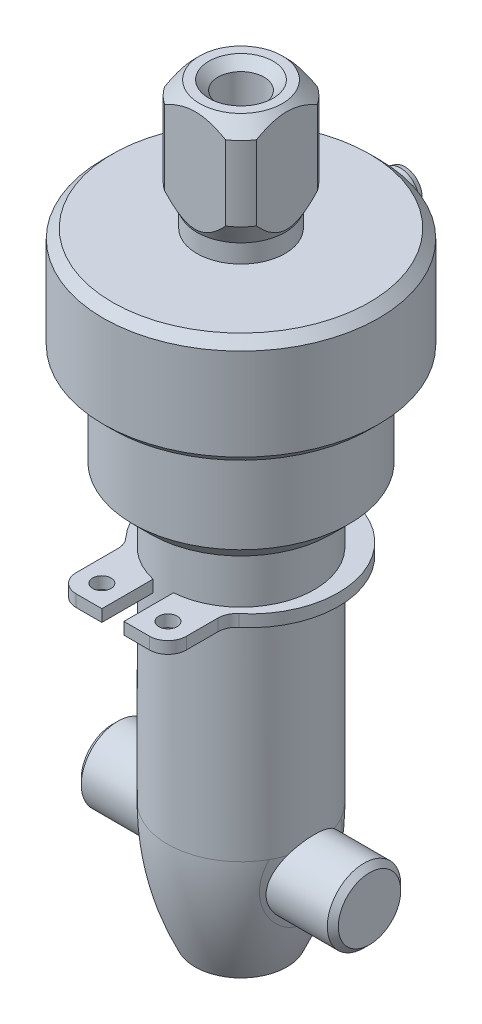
ISO-10303-21;
HEADER;
FILE_DESCRIPTION(('STEP AP214'),'2;1');
FILE_NAME('part.step','',(''),(''),'','','');
FILE_SCHEMA(('AUTOMOTIVE_DESIGN { 1 0 10303 214 1 1 1 1 }'));
ENDSEC;
DATA;
#1=APPLICATION_CONTEXT('core data for automotive mechanical design processes');
#2=APPLICATION_PROTOCOL_DEFINITION('international standard','automotive_design',2000,#1);
#3=PRODUCT_CONTEXT('',#1,'mechanical');
#4=PRODUCT('Part','Part','',(#3));
#5=PRODUCT_RELATED_PRODUCT_CATEGORY('part','',(#4));
#6=PRODUCT_DEFINITION_FORMATION('','',#4);
#7=PRODUCT_DEFINITION_CONTEXT('part definition',#1,'design');
#8=PRODUCT_DEFINITION('design','',#6,#7);
#9=PRODUCT_DEFINITION_SHAPE('','',#8);
#10=(LENGTH_UNIT() NAMED_UNIT(*) SI_UNIT(.MILLI.,.METRE.));
#11=(NAMED_UNIT(*) PLANE_ANGLE_UNIT() SI_UNIT($,.RADIAN.));
#12=(NAMED_UNIT(*) SI_UNIT($,.STERADIAN.) SOLID_ANGLE_UNIT());
#13=UNCERTAINTY_MEASURE_WITH_UNIT(LENGTH_MEASURE(1.E-05),#10,'distance_accuracy_value','');
#14=(GEOMETRIC_REPRESENTATION_CONTEXT(3) GLOBAL_UNCERTAINTY_ASSIGNED_CONTEXT((#13)) GLOBAL_UNIT_ASSIGNED_CONTEXT((#10,
#11,#12)) REPRESENTATION_CONTEXT('',''));
#15=CARTESIAN_POINT('',(0.,0.,0.));
#16=DIRECTION('',(0.,0.,1.));
#17=DIRECTION('',(1.,0.,0.));
#18=AXIS2_PLACEMENT_3D('',#15,#16,#17);
#19=CARTESIAN_POINT('',(0.,-4.78571481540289,0.));
#20=DIRECTION('',(0.,-1.,0.));
#21=DIRECTION('',(0.,0.,-1.));
#22=AXIS2_PLACEMENT_3D('',#19,#20,#21);
#23=CYLINDRICAL_SURFACE('',#22,7.5);
#24=CARTESIAN_POINT('',(0.,23.3142851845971,0.));
#25=DIRECTION('',(0.,-1.,0.));
#26=DIRECTION('',(0.,0.,-1.));
#27=AXIS2_PLACEMENT_3D('',#24,#25,#26);
#28=CIRCLE('',#27,7.5);
#29=CARTESIAN_POINT('',(0.,23.3142851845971,-7.5));
#30=VERTEX_POINT('',#29);
#31=EDGE_CURVE('E458',#30,#30,#28,.F.);
#32=ORIENTED_EDGE('',*,*,#31,.T.);
#33=EDGE_LOOP('',(#32));
#34=FACE_BOUND('',#33,.T.);
#35=CARTESIAN_POINT('',(0.,28.3142851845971,0.));
#36=DIRECTION('',(0.,1.,0.));
#37=DIRECTION('',(0.,0.,1.));
#38=AXIS2_PLACEMENT_3D('',#35,#36,#37);
#39=CIRCLE('',#38,7.5);
#40=CARTESIAN_POINT('',(0.,28.3142851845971,7.5));
#41=VERTEX_POINT('',#40);
#42=EDGE_CURVE('E455',#41,#41,#39,.F.);
#43=ORIENTED_EDGE('',*,*,#42,.T.);
#44=EDGE_LOOP('',(#43));
#45=FACE_BOUND('',#44,.T.);
#46=CARTESIAN_POINT('',(0.,27.3142851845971,-7.5));
#47=CARTESIAN_POINT('',(-0.0559044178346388,27.3142828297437,-7.49999917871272));
#48=CARTESIAN_POINT('',(-0.111842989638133,27.3095814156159,-7.49936835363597));
#49=CARTESIAN_POINT('',(-0.222161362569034,27.2909020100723,-7.49691255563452));
#50=CARTESIAN_POINT('',(-0.276539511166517,27.2769145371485,-7.49508636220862));
#51=CARTESIAN_POINT('',(-0.382124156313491,27.2400843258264,-7.49044539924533));
#52=CARTESIAN_POINT('',(-0.433332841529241,27.2172477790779,-7.48763132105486));
#53=CARTESIAN_POINT('',(-0.531181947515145,27.163381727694,-7.48132693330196));
#54=CARTESIAN_POINT('',(-0.577823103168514,27.1323535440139,-7.47783673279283));
#55=CARTESIAN_POINT('',(-0.665512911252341,27.062778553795,-7.47054497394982));
#56=CARTESIAN_POINT('',(-0.706528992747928,27.0241908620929,-7.46674179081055));
#57=CARTESIAN_POINT('',(-0.781523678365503,26.9406800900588,-7.45926568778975));
#58=CARTESIAN_POINT('',(-0.815501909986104,26.8957566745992,-7.45559277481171));
#59=CARTESIAN_POINT('',(-0.875579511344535,26.8006356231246,-7.44877717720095));
#60=CARTESIAN_POINT('',(-0.901648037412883,26.7504183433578,-7.44563658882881));
#61=CARTESIAN_POINT('',(-0.944969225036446,26.6462696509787,-7.44026293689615));
#62=CARTESIAN_POINT('',(-0.96222226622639,26.5923383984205,-7.43802983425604));
#63=CARTESIAN_POINT('',(-0.987323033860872,26.4826322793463,-7.43473968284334));
#64=CARTESIAN_POINT('',(-0.995226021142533,26.4268702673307,-7.43367572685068));
#65=CARTESIAN_POINT('',(-1.00157340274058,26.3148020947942,-7.43282325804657));
#66=CARTESIAN_POINT('',(-1.000018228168,26.2584959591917,-7.433034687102));
#67=CARTESIAN_POINT('',(-0.987538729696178,26.1473246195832,-7.43470277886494));
#68=CARTESIAN_POINT('',(-0.976675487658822,26.0924524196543,-7.43615132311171));
#69=CARTESIAN_POINT('',(-0.945983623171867,25.9853167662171,-7.44011776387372));
#70=CARTESIAN_POINT('',(-0.926154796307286,25.9330533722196,-7.44263568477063));
#71=CARTESIAN_POINT('',(-0.878029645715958,25.8324303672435,-7.44846630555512));
#72=CARTESIAN_POINT('',(-0.84970698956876,25.784083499,-7.45178147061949));
#73=CARTESIAN_POINT('',(-0.785416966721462,25.6928056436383,-7.45883118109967));
#74=CARTESIAN_POINT('',(-0.74944920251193,25.64987493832,-7.46256574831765));
#75=CARTESIAN_POINT('',(-0.670552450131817,25.5702936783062,-7.47006949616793));
#76=CARTESIAN_POINT('',(-0.627570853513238,25.5336952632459,-7.47383871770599));
#77=CARTESIAN_POINT('',(-0.536047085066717,25.4682241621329,-7.48095961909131));
#78=CARTESIAN_POINT('',(-0.487504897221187,25.4393514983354,-7.48431129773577));
#79=CARTESIAN_POINT('',(-0.386196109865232,25.3901506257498,-7.49022196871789));
#80=CARTESIAN_POINT('',(-0.33342778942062,25.369825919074,-7.49278063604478));
#81=CARTESIAN_POINT('',(-0.225185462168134,25.3383405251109,-7.49681412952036));
#82=CARTESIAN_POINT('',(-0.169711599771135,25.3271793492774,-7.49828901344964));
#83=CARTESIAN_POINT('',(-0.0580834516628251,25.3144059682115,-7.49998120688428));
#84=CARTESIAN_POINT('',(-0.00193751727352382,25.3127219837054,-7.50020796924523));
#85=CARTESIAN_POINT('',(0.109835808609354,25.3187610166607,-7.49940395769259));
#86=CARTESIAN_POINT('',(0.165463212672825,25.3264838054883,-7.49837321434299));
#87=CARTESIAN_POINT('',(0.274406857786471,25.3510575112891,-7.4951758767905));
#88=CARTESIAN_POINT('',(0.327731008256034,25.3678739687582,-7.4930135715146));
#89=CARTESIAN_POINT('',(0.430802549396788,25.4101216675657,-7.48779504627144));
#90=CARTESIAN_POINT('',(0.480549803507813,25.4355532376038,-7.4847387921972));
#91=CARTESIAN_POINT('',(0.575374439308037,25.4944812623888,-7.47804918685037));
#92=CARTESIAN_POINT('',(0.620422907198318,25.5280238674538,-7.47441257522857));
#93=CARTESIAN_POINT('',(0.704276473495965,25.6021568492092,-7.46697864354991));
#94=CARTESIAN_POINT('',(0.743081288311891,25.6427475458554,-7.4631813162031));
#95=CARTESIAN_POINT('',(0.813602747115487,25.7301417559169,-7.45582451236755));
#96=CARTESIAN_POINT('',(0.845271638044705,25.7769839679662,-7.45226674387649));
#97=CARTESIAN_POINT('',(0.900291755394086,25.8753648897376,-7.44582066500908));
#98=CARTESIAN_POINT('',(0.923643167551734,25.9269034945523,-7.44293233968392));
#99=CARTESIAN_POINT('',(0.961289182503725,26.033063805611,-7.43816405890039));
#100=CARTESIAN_POINT('',(0.975610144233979,26.0876760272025,-7.43628117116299));
#101=CARTESIAN_POINT('',(0.994873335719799,26.1985570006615,-7.43372874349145));
#102=CARTESIAN_POINT('',(0.99981606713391,26.2548256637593,-7.43305913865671));
#103=CARTESIAN_POINT('',(1.00017242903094,26.3669469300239,-7.43301115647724));
#104=CARTESIAN_POINT('',(0.995661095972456,26.4227993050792,-7.4336226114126));
#105=CARTESIAN_POINT('',(0.977396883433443,26.5329441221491,-7.43604591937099));
#106=CARTESIAN_POINT('',(0.963644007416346,26.5872365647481,-7.43785777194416));
#107=CARTESIAN_POINT('',(0.927311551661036,26.6927070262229,-7.44247445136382));
#108=CARTESIAN_POINT('',(0.904736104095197,26.7438864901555,-7.445278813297));
#109=CARTESIAN_POINT('',(0.851406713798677,26.8417431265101,-7.45156522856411));
#110=CARTESIAN_POINT('',(0.820652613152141,26.8884202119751,-7.45504729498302));
#111=CARTESIAN_POINT('',(0.75156224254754,26.9763300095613,-7.46232983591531));
#112=CARTESIAN_POINT('',(0.713170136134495,27.0175186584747,-7.46613252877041));
#113=CARTESIAN_POINT('',(0.63001084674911,27.0928967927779,-7.47360859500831));
#114=CARTESIAN_POINT('',(0.585242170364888,27.1270846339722,-7.47728193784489));
#115=CARTESIAN_POINT('',(0.490376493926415,27.1876187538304,-7.48410317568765));
#116=CARTESIAN_POINT('',(0.440257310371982,27.2139305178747,-7.48724873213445));
#117=CARTESIAN_POINT('',(0.336296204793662,27.2577254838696,-7.49263660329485));
#118=CARTESIAN_POINT('',(0.282458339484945,27.2752181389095,-7.49487988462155));
#119=CARTESIAN_POINT('',(0.19029420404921,27.2967591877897,-7.49767860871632));
#120=CARTESIAN_POINT('',(0.152545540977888,27.3033218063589,-7.49854481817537));
#121=CARTESIAN_POINT('',(0.0765365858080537,27.3120855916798,-7.49970579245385));
#122=CARTESIAN_POINT('',(0.0382762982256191,27.3142867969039,-7.500000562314));
#123=CARTESIAN_POINT('',(0.,27.3142851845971,-7.5));
#124=B_SPLINE_CURVE_WITH_KNOTS('',3,(#46,#47,#48,#49,#50,#51,#52,#53,#54,#55,#56,#57,#58,#59,
#60,#61,#62,#63,#64,#65,#66,#67,#68,#69,#70,#71,#72,#73,#74,#75,#76,#77,#78,#79,#80,#81,#82,#83,
#84,#85,#86,#87,#88,#89,#90,#91,#92,#93,#94,#95,#96,#97,#98,#99,#100,#101,#102,#103,#104,#105,
#106,#107,#108,#109,#110,#111,#112,#113,#114,#115,#116,#117,#118,#119,#120,#121,#122,#123),
.UNSPECIFIED.,.T.,.F.,(4,2,2,2,2,2,2,2,2,2,2,2,2,2,2,2,2,2,2,2,2,2,2,2,2,2,2,2,2,2,2,2,2,2,2,2,
2,2,4),(0.,0.167573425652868,0.335318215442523,0.502945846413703,0.670546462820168,
0.839079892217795,1.00762223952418,1.17681360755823,1.345997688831,1.51417677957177,
1.68234820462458,1.84942442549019,2.01650445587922,2.18410791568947,2.35172009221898,
2.52065272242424,2.68958583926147,2.85858810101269,3.02758135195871,3.1952929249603,
3.36300042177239,3.53007681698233,3.69715958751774,3.86521637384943,4.03328079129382,
4.20243852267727,4.37159247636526,4.54025037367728,4.70889924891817,4.87621463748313,
5.04352996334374,5.21076701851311,5.37800730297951,5.54651833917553,5.7150689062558,
5.88434763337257,6.05344452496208,6.16817869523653,6.28291185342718),.UNSPECIFIED.);
#125=CARTESIAN_POINT('',(0.,27.3142851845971,-7.5));
#126=VERTEX_POINT('',#125);
#127=EDGE_CURVE('E318',#126,#126,#124,.T.);
#128=ORIENTED_EDGE('',*,*,#127,.T.);
#129=EDGE_LOOP('',(#128));
#130=FACE_BOUND('',#129,.T.);
#131=ADVANCED_FACE('F17',(#34,#45,#130),#23,.T.);
#132=CARTESIAN_POINT('',(4.,16.8142851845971,0.));
#133=DIRECTION('',(0.,1.,0.));
#134=DIRECTION('',(0.,0.,1.));
#135=AXIS2_PLACEMENT_3D('',#132,#133,#134);
#136=PLANE('',#135);
#137=CARTESIAN_POINT('',(0.,16.8142851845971,0.));
#138=DIRECTION('',(0.,1.,0.));
#139=DIRECTION('',(0.,0.,1.));
#140=AXIS2_PLACEMENT_3D('',#137,#138,#139);
#141=CIRCLE('',#140,4.9);
#142=CARTESIAN_POINT('',(0.,16.8142851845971,4.9));
#143=VERTEX_POINT('',#142);
#144=EDGE_CURVE('E468',#143,#143,#141,.F.);
#145=ORIENTED_EDGE('',*,*,#144,.T.);
#146=EDGE_LOOP('',(#145));
#147=FACE_BOUND('',#146,.T.);
#148=CARTESIAN_POINT('',(0.,16.8142851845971,0.));
#149=DIRECTION('',(0.,1.,0.));
#150=DIRECTION('',(0.,0.,1.));
#151=AXIS2_PLACEMENT_3D('',#148,#149,#150);
#152=CIRCLE('',#151,4.);
#153=CARTESIAN_POINT('',(0.,16.8142851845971,4.));
#154=VERTEX_POINT('',#153);
#155=EDGE_CURVE('E443',#154,#154,#152,.T.);
#156=ORIENTED_EDGE('',*,*,#155,.T.);
#157=EDGE_LOOP('',(#156));
#158=FACE_BOUND('',#157,.T.);
#159=ADVANCED_FACE('F697',(#147,#158),#136,.F.);
#160=CARTESIAN_POINT('',(0.,22.8142851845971,0.));
#161=DIRECTION('',(0.,1.,0.));
#162=DIRECTION('',(0.,0.,1.));
#163=AXIS2_PLACEMENT_3D('',#160,#161,#162);
#164=CYLINDRICAL_SURFACE('',#163,5.9);
#165=CARTESIAN_POINT('',(0.,17.8142851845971,0.));
#166=DIRECTION('',(0.,1.,0.));
#167=DIRECTION('',(0.,0.,1.));
#168=AXIS2_PLACEMENT_3D('',#165,#166,#167);
#169=CIRCLE('',#168,5.9);
#170=CARTESIAN_POINT('',(0.,17.8142851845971,5.9));
#171=VERTEX_POINT('',#170);
#172=EDGE_CURVE('E464',#171,#171,#169,.T.);
#173=ORIENTED_EDGE('',*,*,#172,.T.);
#174=EDGE_LOOP('',(#173));
#175=FACE_BOUND('',#174,.T.);
#176=CARTESIAN_POINT('',(0.,22.8142851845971,0.));
#177=DIRECTION('',(0.,1.,0.));
#178=DIRECTION('',(0.,0.,1.));
#179=AXIS2_PLACEMENT_3D('',#176,#177,#178);
#180=CIRCLE('',#179,5.9);
#181=CARTESIAN_POINT('',(0.,22.8142851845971,5.9));
#182=VERTEX_POINT('',#181);
#183=EDGE_CURVE('E440',#182,#182,#180,.T.);
#184=ORIENTED_EDGE('',*,*,#183,.F.);
#185=EDGE_LOOP('',(#184));
#186=FACE_BOUND('',#185,.T.);
#187=ADVANCED_FACE('F610',(#175,#186),#164,.T.);
#188=CARTESIAN_POINT('',(0.,28.8142851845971,0.));
#189=DIRECTION('',(0.,1.,0.));
#190=DIRECTION('',(0.,0.,1.));
#191=AXIS2_PLACEMENT_3D('',#188,#189,#190);
#192=PLANE('',#191);
#193=CARTESIAN_POINT('',(0.,28.8142851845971,0.));
#194=DIRECTION('',(0.,1.,0.));
#195=DIRECTION('',(0.,0.,1.));
#196=AXIS2_PLACEMENT_3D('',#193,#194,#195);
#197=CIRCLE('',#196,7.);
#198=CARTESIAN_POINT('',(0.,28.8142851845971,7.));
#199=VERTEX_POINT('',#198);
#200=EDGE_CURVE('E461',#199,#199,#197,.T.);
#201=ORIENTED_EDGE('',*,*,#200,.T.);
#202=EDGE_LOOP('',(#201));
#203=FACE_BOUND('',#202,.T.);
#204=CARTESIAN_POINT('',(0.,28.8142851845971,0.));
#205=DIRECTION('',(0.,-1.,0.));
#206=DIRECTION('',(1.,0.,0.));
#207=AXIS2_PLACEMENT_3D('',#204,#205,#206);
#208=CIRCLE('',#207,2.4);
#209=CARTESIAN_POINT('',(2.4,28.8142851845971,0.));
#210=VERTEX_POINT('',#209);
#211=EDGE_CURVE('E319',#210,#210,#208,.T.);
#212=ORIENTED_EDGE('',*,*,#211,.T.);
#213=EDGE_LOOP('',(#212));
#214=FACE_BOUND('',#213,.T.);
#215=ADVANCED_FACE('F711',(#203,#214),#192,.T.);
#216=CARTESIAN_POINT('',(0.,28.3142851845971,0.));
#217=DIRECTION('',(0.,-1.,0.));
#218=DIRECTION('',(0.,0.,-1.));
#219=AXIS2_PLACEMENT_3D('',#216,#217,#218);
#220=CONICAL_SURFACE('',#219,7.5,0.785398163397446);
#221=ORIENTED_EDGE('',*,*,#200,.F.);
#222=EDGE_LOOP('',(#221));
#223=FACE_BOUND('',#222,.T.);
#224=ORIENTED_EDGE('',*,*,#42,.F.);
#225=EDGE_LOOP('',(#224));
#226=FACE_BOUND('',#225,.T.);
#227=ADVANCED_FACE('F808',(#223,#226),#220,.T.);
#228=CARTESIAN_POINT('',(0.,22.8142851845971,0.));
#229=DIRECTION('',(0.,1.,0.));
#230=DIRECTION('',(0.,0.,1.));
#231=AXIS2_PLACEMENT_3D('',#228,#229,#230);
#232=CONICAL_SURFACE('',#231,7.,0.785398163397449);
#233=ORIENTED_EDGE('',*,*,#31,.F.);
#234=EDGE_LOOP('',(#233));
#235=FACE_BOUND('',#234,.T.);
#236=CARTESIAN_POINT('',(0.,22.8142851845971,0.));
#237=DIRECTION('',(0.,-1.,0.));
#238=DIRECTION('',(0.,0.,-1.));
#239=AXIS2_PLACEMENT_3D('',#236,#237,#238);
#240=CIRCLE('',#239,7.);
#241=CARTESIAN_POINT('',(0.,22.8142851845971,-7.));
#242=VERTEX_POINT('',#241);
#243=EDGE_CURVE('E452',#242,#242,#240,.T.);
#244=ORIENTED_EDGE('',*,*,#243,.F.);
#245=EDGE_LOOP('',(#244));
#246=FACE_BOUND('',#245,.T.);
#247=ADVANCED_FACE('F815',(#235,#246),#232,.T.);
#248=CARTESIAN_POINT('',(4.,22.8142851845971,0.));
#249=DIRECTION('',(0.,-1.,0.));
#250=DIRECTION('',(0.,0.,-1.));
#251=AXIS2_PLACEMENT_3D('',#248,#249,#250);
#252=PLANE('',#251);
#253=ORIENTED_EDGE('',*,*,#183,.T.);
#254=EDGE_LOOP('',(#253));
#255=FACE_BOUND('',#254,.T.);
#256=ORIENTED_EDGE('',*,*,#243,.T.);
#257=EDGE_LOOP('',(#256));
#258=FACE_BOUND('',#257,.T.);
#259=ADVANCED_FACE('F709',(#255,#258),#252,.T.);
#260=CARTESIAN_POINT('',(0.,17.8142851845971,0.));
#261=DIRECTION('',(0.,1.,0.));
#262=DIRECTION('',(0.,0.,1.));
#263=AXIS2_PLACEMENT_3D('',#260,#261,#262);
#264=CONICAL_SURFACE('',#263,5.9,0.78539816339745);
#265=ORIENTED_EDGE('',*,*,#144,.F.);
#266=EDGE_LOOP('',(#265));
#267=FACE_BOUND('',#266,.T.);
#268=ORIENTED_EDGE('',*,*,#172,.F.);
#269=EDGE_LOOP('',(#268));
#270=FACE_BOUND('',#269,.T.);
#271=ADVANCED_FACE('F354',(#267,#270),#264,.T.);
#272=CARTESIAN_POINT('',(0.,29.8142851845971,0.));
#273=DIRECTION('',(0.,1.,0.));
#274=DIRECTION('',(-1.,0.,0.));
#275=AXIS2_PLACEMENT_3D('',#272,#273,#274);
#276=CONICAL_SURFACE('',#275,2.4,0.471238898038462);
#277=CARTESIAN_POINT('',(0.,30.9918514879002,0.));
#278=DIRECTION('',(0.,-1.,0.));
#279=DIRECTION('',(1.,0.,0.));
#280=AXIS2_PLACEMENT_3D('',#277,#278,#279);
#281=CIRCLE('',#280,3.);
#282=CARTESIAN_POINT('',(1.6583123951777,30.9918514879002,-2.5));
#283=VERTEX_POINT('',#282);
#284=CARTESIAN_POINT('',(2.5,30.9918514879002,-1.6583123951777));
#285=VERTEX_POINT('',#284);
#286=EDGE_CURVE('E325',#283,#285,#281,.T.);
#287=ORIENTED_EDGE('',*,*,#286,.T.);
#288=CARTESIAN_POINT('',(2.5,34.5115205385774,4.08978107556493));
#289=CARTESIAN_POINT('',(2.5,34.3953174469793,4.0203824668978));
#290=CARTESIAN_POINT('',(2.5,34.279321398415,3.95063614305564));
#291=CARTESIAN_POINT('',(2.5,34.0478210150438,3.81032254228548));
#292=CARTESIAN_POINT('',(2.5,33.9323166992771,3.73975523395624));
#293=CARTESIAN_POINT('',(2.5,33.5863695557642,3.52645559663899));
#294=CARTESIAN_POINT('',(2.5,33.3567971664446,3.38230658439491));
#295=CARTESIAN_POINT('',(2.5,32.8939934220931,3.08433009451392));
#296=CARTESIAN_POINT('',(2.5,32.6608647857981,2.93034145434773));
#297=CARTESIAN_POINT('',(2.5,32.3154159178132,2.69330641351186));
#298=CARTESIAN_POINT('',(2.5,32.2010058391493,2.61330985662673));
#299=CARTESIAN_POINT('',(2.5,31.9740081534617,2.45077754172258));
#300=CARTESIAN_POINT('',(2.5,31.8614204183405,2.36824196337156));
#301=CARTESIAN_POINT('',(2.5,31.6393868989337,2.20051864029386));
#302=CARTESIAN_POINT('',(2.5,31.5299253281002,2.11535189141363));
#303=CARTESIAN_POINT('',(2.5,31.3142078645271,1.94089482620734));
#304=CARTESIAN_POINT('',(2.5,31.2079538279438,1.85160219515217));
#305=CARTESIAN_POINT('',(2.5,31.0009148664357,1.66832601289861));
#306=CARTESIAN_POINT('',(2.5,30.9000955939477,1.57438159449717));
#307=CARTESIAN_POINT('',(2.5,30.7055305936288,1.37950280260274));
#308=CARTESIAN_POINT('',(2.5,30.6117763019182,1.27857718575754));
#309=CARTESIAN_POINT('',(2.5,30.4604529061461,1.0970094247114));
#310=CARTESIAN_POINT('',(2.5,30.4001411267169,1.01868613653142));
#311=CARTESIAN_POINT('',(2.5,30.2879744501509,0.855923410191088));
#312=CARTESIAN_POINT('',(2.5,30.2361319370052,0.771475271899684));
#313=CARTESIAN_POINT('',(2.5,30.1444025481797,0.594171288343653));
#314=CARTESIAN_POINT('',(2.5,30.1047291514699,0.501198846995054));
#315=CARTESIAN_POINT('',(2.5,30.059564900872,0.357411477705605));
#316=CARTESIAN_POINT('',(2.5,30.0469087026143,0.308830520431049));
#317=CARTESIAN_POINT('',(2.5,30.0269873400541,0.210564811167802));
#318=CARTESIAN_POINT('',(2.5,30.0197203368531,0.160880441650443));
#319=CARTESIAN_POINT('',(2.5,30.0115787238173,0.0673120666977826));
#320=CARTESIAN_POINT('',(2.5,30.0100128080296,0.0234878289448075));
#321=CARTESIAN_POINT('',(2.5,30.0114032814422,-0.064095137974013));
#322=CARTESIAN_POINT('',(2.5,30.0143611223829,-0.107853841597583));
#323=CARTESIAN_POINT('',(2.5,30.0298704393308,-0.238378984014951));
#324=CARTESIAN_POINT('',(2.5,30.049056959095,-0.324403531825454));
#325=CARTESIAN_POINT('',(2.5,30.1070549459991,-0.508051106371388));
#326=CARTESIAN_POINT('',(2.5,30.148972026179,-0.604649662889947));
#327=CARTESIAN_POINT('',(2.5,30.2223756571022,-0.743855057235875));
#328=CARTESIAN_POINT('',(2.5,30.2486576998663,-0.789388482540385));
#329=CARTESIAN_POINT('',(2.5,30.3041096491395,-0.878666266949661));
#330=CARTESIAN_POINT('',(2.5,30.3332791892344,-0.922410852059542));
#331=CARTESIAN_POINT('',(2.5,30.4051681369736,-1.02410558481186));
#332=CARTESIAN_POINT('',(2.5,30.4489098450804,-1.08132804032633));
#333=CARTESIAN_POINT('',(2.5,30.5397275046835,-1.19307853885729));
#334=CARTESIAN_POINT('',(2.5,30.5868051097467,-1.24760522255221));
#335=CARTESIAN_POINT('',(2.5,30.7320076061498,-1.40790633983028));
#336=CARTESIAN_POINT('',(2.5,30.833956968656,-1.51020721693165));
#337=CARTESIAN_POINT('',(2.5,31.0451997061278,-1.70904881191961));
#338=CARTESIAN_POINT('',(2.5,31.1545589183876,-1.80551782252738));
#339=CARTESIAN_POINT('',(2.5,31.3774394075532,-1.99323106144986));
#340=CARTESIAN_POINT('',(2.5,31.4909559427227,-2.08448095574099));
#341=CARTESIAN_POINT('',(2.5,31.7233238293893,-2.26491735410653));
#342=CARTESIAN_POINT('',(2.5,31.8422367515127,-2.35402394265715));
#343=CARTESIAN_POINT('',(2.5,32.0823447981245,-2.52912063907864));
#344=CARTESIAN_POINT('',(2.5,32.2035401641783,-2.61511041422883));
#345=CARTESIAN_POINT('',(2.5,32.4477548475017,-2.78469637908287));
#346=CARTESIAN_POINT('',(2.5,32.5707757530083,-2.86829027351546));
#347=CARTESIAN_POINT('',(2.5,32.8181491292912,-3.03348535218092));
#348=CARTESIAN_POINT('',(2.5,32.9425016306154,-3.11508649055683));
#349=CARTESIAN_POINT('',(2.5,33.1863383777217,-3.27282447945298));
#350=CARTESIAN_POINT('',(2.5,33.3057738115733,-3.34903694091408));
#351=CARTESIAN_POINT('',(2.5,33.5454287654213,-3.50022207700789));
#352=CARTESIAN_POINT('',(2.5,33.665648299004,-3.57519473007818));
#353=CARTESIAN_POINT('',(2.5,33.9065037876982,-3.72394879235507));
#354=CARTESIAN_POINT('',(2.5,34.0271385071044,-3.79773220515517));
#355=CARTESIAN_POINT('',(2.5,34.2689478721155,-3.94439632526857));
#356=CARTESIAN_POINT('',(2.5,34.3901224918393,-4.01727707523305));
#357=CARTESIAN_POINT('',(2.5,34.5115205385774,-4.08978107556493));
#358=B_SPLINE_CURVE_WITH_KNOTS('',3,(#288,#289,#290,#291,#292,#293,#294,#295,#296,#297,#298,
#299,#300,#301,#302,#303,#304,#305,#306,#307,#308,#309,#310,#311,#312,#313,#314,#315,#316,#317,
#318,#319,#320,#321,#322,#323,#324,#325,#326,#327,#328,#329,#330,#331,#332,#333,#334,#335,#336,
#337,#338,#339,#340,#341,#342,#343,#344,#345,#346,#347,#348,#349,#350,#351,#352,#353,#354,#355,
#356,#357),.UNSPECIFIED.,.F.,.F.,(4,2,2,2,2,2,2,2,2,2,2,2,2,2,2,2,2,2,2,2,2,2,2,2,2,2,2,2,2,2,2,
2,2,2,4),(0.,0.406046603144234,0.812108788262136,1.62529612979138,2.46334513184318,
2.88212955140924,3.30088440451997,3.71688708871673,4.13312606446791,4.54631742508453,
4.95899959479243,5.25516150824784,5.55175267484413,5.85328307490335,6.00363620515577,
6.15393800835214,6.28526105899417,6.41662626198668,6.67932987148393,6.99344079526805,
7.1510913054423,7.30872183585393,7.52463325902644,7.74065246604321,8.17341588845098,
8.61072042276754,9.04754082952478,9.49326087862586,9.93902836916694,10.385209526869,
10.8314009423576,11.2564314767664,11.6814693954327,12.1056946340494,12.5298997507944),.UNSPECIFIED.);
#359=CARTESIAN_POINT('',(2.5,30.9918514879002,1.6583123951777));
#360=VERTEX_POINT('',#359);
#361=EDGE_CURVE('E363',#360,#285,#358,.T.);
#362=ORIENTED_EDGE('',*,*,#361,.F.);
#363=CARTESIAN_POINT('',(1.6583123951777,30.9918514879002,2.5));
#364=VERTEX_POINT('',#363);
#365=EDGE_CURVE('E326',#360,#364,#281,.T.);
#366=ORIENTED_EDGE('',*,*,#365,.T.);
#367=CARTESIAN_POINT('',(-4.08978107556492,34.5115205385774,2.5));
#368=CARTESIAN_POINT('',(-4.02038246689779,34.3953174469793,2.5));
#369=CARTESIAN_POINT('',(-3.95063614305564,34.279321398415,2.5));
#370=CARTESIAN_POINT('',(-3.81032254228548,34.0478210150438,2.5));
#371=CARTESIAN_POINT('',(-3.73975523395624,33.9323166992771,2.5));
#372=CARTESIAN_POINT('',(-3.52645559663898,33.5863695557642,2.5));
#373=CARTESIAN_POINT('',(-3.3823065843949,33.3567971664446,2.5));
#374=CARTESIAN_POINT('',(-3.08433009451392,32.8939934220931,2.5));
#375=CARTESIAN_POINT('',(-2.93034145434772,32.6608647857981,2.5));
#376=CARTESIAN_POINT('',(-2.69330641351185,32.3154159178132,2.5));
#377=CARTESIAN_POINT('',(-2.61330985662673,32.2010058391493,2.5));
#378=CARTESIAN_POINT('',(-2.45077754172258,31.9740081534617,2.5));
#379=CARTESIAN_POINT('',(-2.36824196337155,31.8614204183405,2.5));
#380=CARTESIAN_POINT('',(-2.20051864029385,31.6393868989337,2.5));
#381=CARTESIAN_POINT('',(-2.11535189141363,31.5299253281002,2.5));
#382=CARTESIAN_POINT('',(-1.94089482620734,31.314207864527,2.5));
#383=CARTESIAN_POINT('',(-1.85160219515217,31.2079538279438,2.5));
#384=CARTESIAN_POINT('',(-1.66832601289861,31.0009148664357,2.5));
#385=CARTESIAN_POINT('',(-1.57438159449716,30.9000955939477,2.5));
#386=CARTESIAN_POINT('',(-1.37950280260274,30.7055305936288,2.5));
#387=CARTESIAN_POINT('',(-1.27857718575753,30.6117763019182,2.5));
#388=CARTESIAN_POINT('',(-1.09700942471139,30.4604529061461,2.5));
#389=CARTESIAN_POINT('',(-1.01868613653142,30.4001411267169,2.5));
#390=CARTESIAN_POINT('',(-0.855923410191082,30.2879744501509,2.5));
#391=CARTESIAN_POINT('',(-0.771475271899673,30.2361319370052,2.5));
#392=CARTESIAN_POINT('',(-0.59417128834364,30.1444025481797,2.5));
#393=CARTESIAN_POINT('',(-0.501198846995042,30.1047291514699,2.5));
#394=CARTESIAN_POINT('',(-0.357411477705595,30.0595649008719,2.5));
#395=CARTESIAN_POINT('',(-0.308830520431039,30.0469087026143,2.5));
#396=CARTESIAN_POINT('',(-0.210564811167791,30.0269873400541,2.5));
#397=CARTESIAN_POINT('',(-0.160880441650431,30.0197203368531,2.5));
#398=CARTESIAN_POINT('',(-0.0673120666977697,30.0115787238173,2.5));
#399=CARTESIAN_POINT('',(-0.023487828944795,30.0100128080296,2.5));
#400=CARTESIAN_POINT('',(0.0640951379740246,30.0114032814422,2.5));
#401=CARTESIAN_POINT('',(0.107853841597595,30.0143611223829,2.5));
#402=CARTESIAN_POINT('',(0.238378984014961,30.0298704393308,2.5));
#403=CARTESIAN_POINT('',(0.324403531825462,30.049056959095,2.5));
#404=CARTESIAN_POINT('',(0.508051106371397,30.1070549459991,2.5));
#405=CARTESIAN_POINT('',(0.604649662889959,30.148972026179,2.5));
#406=CARTESIAN_POINT('',(0.743855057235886,30.2223756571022,2.5));
#407=CARTESIAN_POINT('',(0.789388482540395,30.2486576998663,2.5));
#408=CARTESIAN_POINT('',(0.878666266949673,30.3041096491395,2.5));
#409=CARTESIAN_POINT('',(0.922410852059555,30.3332791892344,2.5));
#410=CARTESIAN_POINT('',(1.02410558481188,30.4051681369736,2.5));
#411=CARTESIAN_POINT('',(1.08132804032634,30.4489098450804,2.5));
#412=CARTESIAN_POINT('',(1.1930785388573,30.5397275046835,2.5));
#413=CARTESIAN_POINT('',(1.24760522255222,30.5868051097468,2.5));
#414=CARTESIAN_POINT('',(1.40790633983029,30.7320076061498,2.5));
#415=CARTESIAN_POINT('',(1.51020721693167,30.833956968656,2.5));
#416=CARTESIAN_POINT('',(1.70904881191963,31.0451997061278,2.5));
#417=CARTESIAN_POINT('',(1.80551782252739,31.1545589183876,2.5));
#418=CARTESIAN_POINT('',(1.99323106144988,31.3774394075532,2.5));
#419=CARTESIAN_POINT('',(2.08448095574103,31.4909559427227,2.5));
#420=CARTESIAN_POINT('',(2.26491735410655,31.7233238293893,2.5));
#421=CARTESIAN_POINT('',(2.35402394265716,31.8422367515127,2.5));
#422=CARTESIAN_POINT('',(2.52912063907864,32.0823447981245,2.5));
#423=CARTESIAN_POINT('',(2.61511041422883,32.2035401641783,2.5));
#424=CARTESIAN_POINT('',(2.78469637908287,32.4477548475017,2.5));
#425=CARTESIAN_POINT('',(2.86829027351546,32.5707757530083,2.5));
#426=CARTESIAN_POINT('',(3.03348535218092,32.8181491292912,2.5));
#427=CARTESIAN_POINT('',(3.11508649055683,32.9425016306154,2.5));
#428=CARTESIAN_POINT('',(3.27282447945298,33.1863383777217,2.5));
#429=CARTESIAN_POINT('',(3.34903694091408,33.3057738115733,2.5));
#430=CARTESIAN_POINT('',(3.50022207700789,33.5454287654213,2.5));
#431=CARTESIAN_POINT('',(3.57519473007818,33.665648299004,2.5));
#432=CARTESIAN_POINT('',(3.72394879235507,33.9065037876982,2.5));
#433=CARTESIAN_POINT('',(3.79773220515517,34.0271385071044,2.5));
#434=CARTESIAN_POINT('',(3.94439632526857,34.2689478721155,2.5));
#435=CARTESIAN_POINT('',(4.01727707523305,34.3901224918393,2.5));
#436=CARTESIAN_POINT('',(4.08978107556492,34.5115205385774,2.5));
#437=B_SPLINE_CURVE_WITH_KNOTS('',3,(#367,#368,#369,#370,#371,#372,#373,#374,#375,#376,#377,
#378,#379,#380,#381,#382,#383,#384,#385,#386,#387,#388,#389,#390,#391,#392,#393,#394,#395,#396,
#397,#398,#399,#400,#401,#402,#403,#404,#405,#406,#407,#408,#409,#410,#411,#412,#413,#414,#415,
#416,#417,#418,#419,#420,#421,#422,#423,#424,#425,#426,#427,#428,#429,#430,#431,#432,#433,#434,
#435,#436),.UNSPECIFIED.,.F.,.F.,(4,2,2,2,2,2,2,2,2,2,2,2,2,2,2,2,2,2,2,2,2,2,2,2,2,2,2,2,2,2,2,
2,2,2,4),(0.,0.406046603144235,0.812108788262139,1.62529612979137,2.46334513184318,
2.88212955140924,3.30088440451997,3.71688708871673,4.13312606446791,4.54631742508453,
4.95899959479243,5.25516150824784,5.55175267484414,5.85328307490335,6.00363620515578,
6.15393800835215,6.28526105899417,6.41662626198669,6.67932987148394,6.99344079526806,
7.15109130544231,7.30872183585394,7.52463325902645,7.74065246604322,8.17341588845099,
8.61072042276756,9.04754082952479,9.49326087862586,9.93902836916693,10.385209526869,
10.8314009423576,11.2564314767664,11.6814693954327,12.1056946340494,12.5298997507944),.UNSPECIFIED.);
#438=CARTESIAN_POINT('',(-1.6583123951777,30.9918514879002,2.5));
#439=VERTEX_POINT('',#438);
#440=EDGE_CURVE('E328',#439,#364,#437,.T.);
#441=ORIENTED_EDGE('',*,*,#440,.F.);
#442=CARTESIAN_POINT('',(-2.5,30.9918514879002,1.6583123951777));
#443=VERTEX_POINT('',#442);
#444=EDGE_CURVE('E329',#439,#443,#281,.T.);
#445=ORIENTED_EDGE('',*,*,#444,.T.);
#446=CARTESIAN_POINT('',(-2.5,34.5115205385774,-4.08978107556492));
#447=CARTESIAN_POINT('',(-2.5,34.3953174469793,-4.02038246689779));
#448=CARTESIAN_POINT('',(-2.5,34.279321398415,-3.95063614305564));
#449=CARTESIAN_POINT('',(-2.5,34.0478210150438,-3.81032254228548));
#450=CARTESIAN_POINT('',(-2.5,33.9323166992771,-3.73975523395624));
#451=CARTESIAN_POINT('',(-2.5,33.5863695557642,-3.52645559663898));
#452=CARTESIAN_POINT('',(-2.5,33.3567971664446,-3.3823065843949));
#453=CARTESIAN_POINT('',(-2.5,32.8939934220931,-3.08433009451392));
#454=CARTESIAN_POINT('',(-2.5,32.6608647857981,-2.93034145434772));
#455=CARTESIAN_POINT('',(-2.5,32.3154159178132,-2.69330641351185));
#456=CARTESIAN_POINT('',(-2.5,32.2010058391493,-2.61330985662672));
#457=CARTESIAN_POINT('',(-2.5,31.9740081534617,-2.45077754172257));
#458=CARTESIAN_POINT('',(-2.5,31.8614204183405,-2.36824196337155));
#459=CARTESIAN_POINT('',(-2.5,31.6393868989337,-2.20051864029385));
#460=CARTESIAN_POINT('',(-2.5,31.5299253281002,-2.11535189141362));
#461=CARTESIAN_POINT('',(-2.5,31.3142078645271,-1.94089482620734));
#462=CARTESIAN_POINT('',(-2.5,31.2079538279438,-1.85160219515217));
#463=CARTESIAN_POINT('',(-2.5,31.0009148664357,-1.66832601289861));
#464=CARTESIAN_POINT('',(-2.5,30.9000955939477,-1.57438159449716));
#465=CARTESIAN_POINT('',(-2.5,30.7055305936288,-1.37950280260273));
#466=CARTESIAN_POINT('',(-2.5,30.6117763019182,-1.27857718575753));
#467=CARTESIAN_POINT('',(-2.5,30.4604529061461,-1.09700942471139));
#468=CARTESIAN_POINT('',(-2.5,30.4001411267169,-1.01868613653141));
#469=CARTESIAN_POINT('',(-2.5,30.2879744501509,-0.855923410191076));
#470=CARTESIAN_POINT('',(-2.5,30.2361319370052,-0.77147527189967));
#471=CARTESIAN_POINT('',(-2.5,30.1444025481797,-0.594171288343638));
#472=CARTESIAN_POINT('',(-2.5,30.1047291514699,-0.501198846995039));
#473=CARTESIAN_POINT('',(-2.5,30.0595649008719,-0.357411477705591));
#474=CARTESIAN_POINT('',(-2.5,30.0469087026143,-0.308830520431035));
#475=CARTESIAN_POINT('',(-2.5,30.0269873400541,-0.210564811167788));
#476=CARTESIAN_POINT('',(-2.5,30.0197203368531,-0.160880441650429));
#477=CARTESIAN_POINT('',(-2.5,30.0115787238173,-0.0673120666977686));
#478=CARTESIAN_POINT('',(-2.5,30.0100128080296,-0.0234878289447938));
#479=CARTESIAN_POINT('',(-2.5,30.0114032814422,0.0640951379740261));
#480=CARTESIAN_POINT('',(-2.5,30.0143611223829,0.107853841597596));
#481=CARTESIAN_POINT('',(-2.5,30.0298704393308,0.238378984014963));
#482=CARTESIAN_POINT('',(-2.5,30.049056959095,0.324403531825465));
#483=CARTESIAN_POINT('',(-2.5,30.1070549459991,0.508051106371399));
#484=CARTESIAN_POINT('',(-2.5,30.148972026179,0.604649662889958));
#485=CARTESIAN_POINT('',(-2.5,30.2223756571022,0.743855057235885));
#486=CARTESIAN_POINT('',(-2.5,30.2486576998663,0.789388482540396));
#487=CARTESIAN_POINT('',(-2.5,30.3041096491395,0.878666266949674));
#488=CARTESIAN_POINT('',(-2.5,30.3332791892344,0.922410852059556));
#489=CARTESIAN_POINT('',(-2.5,30.4051681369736,1.02410558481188));
#490=CARTESIAN_POINT('',(-2.5,30.4489098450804,1.08132804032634));
#491=CARTESIAN_POINT('',(-2.5,30.5397275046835,1.1930785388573));
#492=CARTESIAN_POINT('',(-2.5,30.5868051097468,1.24760522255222));
#493=CARTESIAN_POINT('',(-2.5,30.7320076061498,1.40790633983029));
#494=CARTESIAN_POINT('',(-2.5,30.833956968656,1.51020721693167));
#495=CARTESIAN_POINT('',(-2.5,31.0451997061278,1.70904881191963));
#496=CARTESIAN_POINT('',(-2.5,31.1545589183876,1.80551782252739));
#497=CARTESIAN_POINT('',(-2.5,31.3774394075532,1.99323106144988));
#498=CARTESIAN_POINT('',(-2.5,31.4909559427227,2.08448095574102));
#499=CARTESIAN_POINT('',(-2.5,31.7233238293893,2.26491735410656));
#500=CARTESIAN_POINT('',(-2.5,31.8422367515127,2.35402394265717));
#501=CARTESIAN_POINT('',(-2.5,32.0823447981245,2.52912063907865));
#502=CARTESIAN_POINT('',(-2.5,32.2035401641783,2.61511041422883));
#503=CARTESIAN_POINT('',(-2.5,32.4477548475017,2.78469637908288));
#504=CARTESIAN_POINT('',(-2.5,32.5707757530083,2.86829027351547));
#505=CARTESIAN_POINT('',(-2.5,32.8181491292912,3.03348535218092));
#506=CARTESIAN_POINT('',(-2.5,32.9425016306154,3.11508649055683));
#507=CARTESIAN_POINT('',(-2.5,33.1863383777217,3.27282447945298));
#508=CARTESIAN_POINT('',(-2.5,33.3057738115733,3.34903694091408));
#509=CARTESIAN_POINT('',(-2.5,33.5454287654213,3.50022207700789));
#510=CARTESIAN_POINT('',(-2.5,33.665648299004,3.57519473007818));
#511=CARTESIAN_POINT('',(-2.5,33.9065037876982,3.72394879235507));
#512=CARTESIAN_POINT('',(-2.5,34.0271385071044,3.79773220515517));
#513=CARTESIAN_POINT('',(-2.5,34.2689478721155,3.94439632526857));
#514=CARTESIAN_POINT('',(-2.5,34.3901224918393,4.01727707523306));
#515=CARTESIAN_POINT('',(-2.5,34.5115205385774,4.08978107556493));
#516=B_SPLINE_CURVE_WITH_KNOTS('',3,(#446,#447,#448,#449,#450,#451,#452,#453,#454,#455,#456,
#457,#458,#459,#460,#461,#462,#463,#464,#465,#466,#467,#468,#469,#470,#471,#472,#473,#474,#475,
#476,#477,#478,#479,#480,#481,#482,#483,#484,#485,#486,#487,#488,#489,#490,#491,#492,#493,#494,
#495,#496,#497,#498,#499,#500,#501,#502,#503,#504,#505,#506,#507,#508,#509,#510,#511,#512,#513,
#514,#515),.UNSPECIFIED.,.F.,.F.,(4,2,2,2,2,2,2,2,2,2,2,2,2,2,2,2,2,2,2,2,2,2,2,2,2,2,2,2,2,2,2,
2,2,2,4),(0.,0.406046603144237,0.812108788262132,1.62529612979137,2.46334513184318,
2.88212955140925,3.30088440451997,3.71688708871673,4.13312606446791,4.54631742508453,
4.95899959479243,5.25516150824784,5.55175267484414,5.85328307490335,6.00363620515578,
6.15393800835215,6.28526105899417,6.41662626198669,6.67932987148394,6.99344079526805,
7.1510913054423,7.30872183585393,7.52463325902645,7.74065246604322,8.17341588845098,
8.61072042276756,9.04754082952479,9.49326087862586,9.93902836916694,10.385209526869,
10.8314009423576,11.2564314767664,11.6814693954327,12.1056946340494,12.5298997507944),.UNSPECIFIED.);
#517=CARTESIAN_POINT('',(-2.5,30.9918514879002,-1.6583123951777));
#518=VERTEX_POINT('',#517);
#519=EDGE_CURVE('E338',#518,#443,#516,.T.);
#520=ORIENTED_EDGE('',*,*,#519,.F.);
#521=CARTESIAN_POINT('',(-1.6583123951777,30.9918514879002,-2.5));
#522=VERTEX_POINT('',#521);
#523=EDGE_CURVE('E799',#518,#522,#281,.T.);
#524=ORIENTED_EDGE('',*,*,#523,.T.);
#525=CARTESIAN_POINT('',(4.08978107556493,34.5115205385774,-2.5));
#526=CARTESIAN_POINT('',(4.02038246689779,34.3953174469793,-2.5));
#527=CARTESIAN_POINT('',(3.95063614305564,34.279321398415,-2.5));
#528=CARTESIAN_POINT('',(3.81032254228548,34.0478210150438,-2.5));
#529=CARTESIAN_POINT('',(3.73975523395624,33.9323166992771,-2.5));
#530=CARTESIAN_POINT('',(3.52645559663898,33.5863695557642,-2.5));
#531=CARTESIAN_POINT('',(3.3823065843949,33.3567971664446,-2.5));
#532=CARTESIAN_POINT('',(3.08433009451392,32.8939934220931,-2.5));
#533=CARTESIAN_POINT('',(2.93034145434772,32.6608647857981,-2.5));
#534=CARTESIAN_POINT('',(2.69330641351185,32.3154159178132,-2.5));
#535=CARTESIAN_POINT('',(2.61330985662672,32.2010058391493,-2.5));
#536=CARTESIAN_POINT('',(2.45077754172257,31.9740081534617,-2.5));
#537=CARTESIAN_POINT('',(2.36824196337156,31.8614204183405,-2.5));
#538=CARTESIAN_POINT('',(2.20051864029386,31.6393868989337,-2.5));
#539=CARTESIAN_POINT('',(2.11535189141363,31.5299253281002,-2.5));
#540=CARTESIAN_POINT('',(1.94089482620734,31.3142078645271,-2.5));
#541=CARTESIAN_POINT('',(1.85160219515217,31.2079538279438,-2.5));
#542=CARTESIAN_POINT('',(1.66832601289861,31.0009148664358,-2.5));
#543=CARTESIAN_POINT('',(1.57438159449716,30.9000955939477,-2.5));
#544=CARTESIAN_POINT('',(1.37950280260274,30.7055305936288,-2.5));
#545=CARTESIAN_POINT('',(1.27857718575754,30.6117763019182,-2.5));
#546=CARTESIAN_POINT('',(1.0970094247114,30.4604529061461,-2.5));
#547=CARTESIAN_POINT('',(1.01868613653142,30.4001411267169,-2.5));
#548=CARTESIAN_POINT('',(0.855923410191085,30.2879744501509,-2.5));
#549=CARTESIAN_POINT('',(0.771475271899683,30.2361319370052,-2.5));
#550=CARTESIAN_POINT('',(0.594171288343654,30.1444025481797,-2.5));
#551=CARTESIAN_POINT('',(0.501198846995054,30.1047291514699,-2.5));
#552=CARTESIAN_POINT('',(0.357411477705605,30.059564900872,-2.5));
#553=CARTESIAN_POINT('',(0.308830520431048,30.0469087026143,-2.5));
#554=CARTESIAN_POINT('',(0.210564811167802,30.0269873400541,-2.5));
#555=CARTESIAN_POINT('',(0.160880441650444,30.0197203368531,-2.5));
#556=CARTESIAN_POINT('',(0.0673120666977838,30.0115787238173,-2.5));
#557=CARTESIAN_POINT('',(0.0234878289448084,30.0100128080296,-2.5));
#558=CARTESIAN_POINT('',(-0.0640951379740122,30.0114032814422,-2.5));
#559=CARTESIAN_POINT('',(-0.107853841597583,30.0143611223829,-2.5));
#560=CARTESIAN_POINT('',(-0.238378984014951,30.0298704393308,-2.5));
#561=CARTESIAN_POINT('',(-0.324403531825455,30.049056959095,-2.5));
#562=CARTESIAN_POINT('',(-0.508051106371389,30.1070549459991,-2.5));
#563=CARTESIAN_POINT('',(-0.604649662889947,30.148972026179,-2.5));
#564=CARTESIAN_POINT('',(-0.743855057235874,30.2223756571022,-2.5));
#565=CARTESIAN_POINT('',(-0.789388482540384,30.2486576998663,-2.5));
#566=CARTESIAN_POINT('',(-0.878666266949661,30.3041096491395,-2.5));
#567=CARTESIAN_POINT('',(-0.922410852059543,30.3332791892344,-2.5));
#568=CARTESIAN_POINT('',(-1.02410558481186,30.4051681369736,-2.5));
#569=CARTESIAN_POINT('',(-1.08132804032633,30.4489098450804,-2.5));
#570=CARTESIAN_POINT('',(-1.19307853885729,30.5397275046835,-2.5));
#571=CARTESIAN_POINT('',(-1.24760522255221,30.5868051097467,-2.5));
#572=CARTESIAN_POINT('',(-1.40790633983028,30.7320076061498,-2.5));
#573=CARTESIAN_POINT('',(-1.51020721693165,30.833956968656,-2.5));
#574=CARTESIAN_POINT('',(-1.70904881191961,31.0451997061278,-2.5));
#575=CARTESIAN_POINT('',(-1.80551782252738,31.1545589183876,-2.5));
#576=CARTESIAN_POINT('',(-1.99323106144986,31.3774394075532,-2.5));
#577=CARTESIAN_POINT('',(-2.08448095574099,31.4909559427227,-2.5));
#578=CARTESIAN_POINT('',(-2.26491735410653,31.7233238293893,-2.5));
#579=CARTESIAN_POINT('',(-2.35402394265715,31.8422367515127,-2.5));
#580=CARTESIAN_POINT('',(-2.52912063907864,32.0823447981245,-2.5));
#581=CARTESIAN_POINT('',(-2.61511041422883,32.2035401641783,-2.5));
#582=CARTESIAN_POINT('',(-2.78469637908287,32.4477548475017,-2.5));
#583=CARTESIAN_POINT('',(-2.86829027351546,32.5707757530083,-2.5));
#584=CARTESIAN_POINT('',(-3.03348535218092,32.8181491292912,-2.5));
#585=CARTESIAN_POINT('',(-3.11508649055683,32.9425016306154,-2.5));
#586=CARTESIAN_POINT('',(-3.27282447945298,33.1863383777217,-2.5));
#587=CARTESIAN_POINT('',(-3.34903694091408,33.3057738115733,-2.5));
#588=CARTESIAN_POINT('',(-3.50022207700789,33.5454287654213,-2.5));
#589=CARTESIAN_POINT('',(-3.57519473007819,33.665648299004,-2.5));
#590=CARTESIAN_POINT('',(-3.72394879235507,33.9065037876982,-2.5));
#591=CARTESIAN_POINT('',(-3.79773220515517,34.0271385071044,-2.5));
#592=CARTESIAN_POINT('',(-3.94439632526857,34.2689478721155,-2.5));
#593=CARTESIAN_POINT('',(-4.01727707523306,34.3901224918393,-2.5));
#594=CARTESIAN_POINT('',(-4.08978107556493,34.5115205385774,-2.5));
#595=B_SPLINE_CURVE_WITH_KNOTS('',3,(#525,#526,#527,#528,#529,#530,#531,#532,#533,#534,#535,
#536,#537,#538,#539,#540,#541,#542,#543,#544,#545,#546,#547,#548,#549,#550,#551,#552,#553,#554,
#555,#556,#557,#558,#559,#560,#561,#562,#563,#564,#565,#566,#567,#568,#569,#570,#571,#572,#573,
#574,#575,#576,#577,#578,#579,#580,#581,#582,#583,#584,#585,#586,#587,#588,#589,#590,#591,#592,
#593,#594),.UNSPECIFIED.,.F.,.F.,(4,2,2,2,2,2,2,2,2,2,2,2,2,2,2,2,2,2,2,2,2,2,2,2,2,2,2,2,2,2,2,
2,2,2,4),(0.,0.406046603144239,0.812108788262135,1.62529612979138,2.46334513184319,
2.88212955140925,3.30088440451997,3.71688708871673,4.13312606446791,4.54631742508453,
4.95899959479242,5.25516150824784,5.55175267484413,5.85328307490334,6.00363620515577,
6.15393800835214,6.28526105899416,6.41662626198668,6.67932987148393,6.99344079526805,
7.15109130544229,7.30872183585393,7.52463325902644,7.7406524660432,8.17341588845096,
8.61072042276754,9.04754082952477,9.49326087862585,9.93902836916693,10.385209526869,
10.8314009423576,11.2564314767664,11.6814693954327,12.1056946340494,12.5298997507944),.UNSPECIFIED.);
#596=EDGE_CURVE('E372',#283,#522,#595,.T.);
#597=ORIENTED_EDGE('',*,*,#596,.F.);
#598=EDGE_LOOP('',(#287,#362,#366,#441,#445,#520,#524,#597));
#599=FACE_BOUND('',#598,.T.);
#600=CARTESIAN_POINT('',(0.,29.8142851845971,0.));
#601=DIRECTION('',(0.,-1.,0.));
#602=DIRECTION('',(1.,0.,0.));
#603=AXIS2_PLACEMENT_3D('',#600,#601,#602);
#604=CIRCLE('',#603,2.4);
#605=CARTESIAN_POINT('',(2.4,29.8142851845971,0.));
#606=VERTEX_POINT('',#605);
#607=EDGE_CURVE('E322',#606,#606,#604,.T.);
#608=ORIENTED_EDGE('',*,*,#607,.F.);
#609=EDGE_LOOP('',(#608));
#610=FACE_BOUND('',#609,.T.);
#611=ADVANCED_FACE('F348',(#599,#610),#276,.T.);
#612=CARTESIAN_POINT('',(0.,-4.78571481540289,0.));
#613=DIRECTION('',(0.,-1.,0.));
#614=DIRECTION('',(1.,0.,0.));
#615=AXIS2_PLACEMENT_3D('',#612,#613,#614);
#616=CYLINDRICAL_SURFACE('',#615,2.4);
#617=ORIENTED_EDGE('',*,*,#607,.T.);
#618=EDGE_LOOP('',(#617));
#619=FACE_BOUND('',#618,.T.);
#620=ORIENTED_EDGE('',*,*,#211,.F.);
#621=EDGE_LOOP('',(#620));
#622=FACE_BOUND('',#621,.T.);
#623=ADVANCED_FACE('F353',(#619,#622),#616,.T.);
#624=CARTESIAN_POINT('',(0.,35.8142851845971,0.));
#625=DIRECTION('',(0.,1.,0.));
#626=DIRECTION('',(0.,0.,1.));
#627=AXIS2_PLACEMENT_3D('',#624,#625,#626);
#628=CYLINDRICAL_SURFACE('',#627,1.24999999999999);
#629=CARTESIAN_POINT('',(0.,27.3142851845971,0.));
#630=DIRECTION('',(0.,1.,0.));
#631=DIRECTION('',(0.,0.,1.));
#632=AXIS2_PLACEMENT_3D('',#629,#630,#631);
#633=CIRCLE('',#632,1.24999999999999);
#634=CARTESIAN_POINT('',(0.,27.3142851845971,1.24999999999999));
#635=VERTEX_POINT('',#634);
#636=EDGE_CURVE('E414',#635,#635,#633,.T.);
#637=ORIENTED_EDGE('',*,*,#636,.F.);
#638=EDGE_LOOP('',(#637));
#639=FACE_BOUND('',#638,.T.);
#640=CARTESIAN_POINT('',(0.,35.3142851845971,0.));
#641=DIRECTION('',(0.,1.,0.));
#642=DIRECTION('',(0.,0.,1.));
#643=AXIS2_PLACEMENT_3D('',#640,#641,#642);
#644=CIRCLE('',#643,1.25);
#645=CARTESIAN_POINT('',(0.,35.3142851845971,1.25));
#646=VERTEX_POINT('',#645);
#647=EDGE_CURVE('E411',#646,#646,#644,.T.);
#648=ORIENTED_EDGE('',*,*,#647,.T.);
#649=EDGE_LOOP('',(#648));
#650=FACE_BOUND('',#649,.T.);
#651=ADVANCED_FACE('F741',(#639,#650),#628,.F.);
#652=CARTESIAN_POINT('',(0.,35.8142851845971,0.));
#653=DIRECTION('',(0.,1.,0.));
#654=DIRECTION('',(0.,0.,1.));
#655=AXIS2_PLACEMENT_3D('',#652,#653,#654);
#656=CONICAL_SURFACE('',#655,1.75,0.785398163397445);
#657=ORIENTED_EDGE('',*,*,#647,.F.);
#658=EDGE_LOOP('',(#657));
#659=FACE_BOUND('',#658,.T.);
#660=CARTESIAN_POINT('',(0.,35.8142851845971,0.));
#661=DIRECTION('',(0.,1.,0.));
#662=DIRECTION('',(0.,0.,1.));
#663=AXIS2_PLACEMENT_3D('',#660,#661,#662);
#664=CIRCLE('',#663,1.75);
#665=CARTESIAN_POINT('',(0.,35.8142851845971,1.75));
#666=VERTEX_POINT('',#665);
#667=EDGE_CURVE('E402',#666,#666,#664,.T.);
#668=ORIENTED_EDGE('',*,*,#667,.T.);
#669=EDGE_LOOP('',(#668));
#670=FACE_BOUND('',#669,.T.);
#671=ADVANCED_FACE('F744',(#659,#670),#656,.F.);
#672=CARTESIAN_POINT('',(0.,35.8142851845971,0.));
#673=DIRECTION('',(0.,1.,0.));
#674=DIRECTION('',(0.,0.,1.));
#675=AXIS2_PLACEMENT_3D('',#672,#673,#674);
#676=PLANE('',#675);
#677=CARTESIAN_POINT('',(0.,35.8142851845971,0.));
#678=DIRECTION('',(0.,-1.,0.));
#679=DIRECTION('',(1.,0.,0.));
#680=AXIS2_PLACEMENT_3D('',#677,#678,#679);
#681=CIRCLE('',#680,2.25);
#682=CARTESIAN_POINT('',(2.25,35.8142851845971,0.));
#683=VERTEX_POINT('',#682);
#684=EDGE_CURVE('E760',#683,#683,#681,.T.);
#685=ORIENTED_EDGE('',*,*,#684,.F.);
#686=EDGE_LOOP('',(#685));
#687=FACE_BOUND('',#686,.T.);
#688=ORIENTED_EDGE('',*,*,#667,.F.);
#689=EDGE_LOOP('',(#688));
#690=FACE_BOUND('',#689,.T.);
#691=ADVANCED_FACE('F749',(#687,#690),#676,.T.);
#692=CARTESIAN_POINT('',(0.,35.8142851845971,0.));
#693=DIRECTION('',(0.,-1.,0.));
#694=DIRECTION('',(1.,0.,0.));
#695=AXIS2_PLACEMENT_3D('',#692,#693,#694);
#696=CONICAL_SURFACE('',#695,2.25,0.785398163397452);
#697=CARTESIAN_POINT('',(5.05888002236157,32.4213899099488,-2.5));
#698=CARTESIAN_POINT('',(4.91138140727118,32.553579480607,-2.5));
#699=CARTESIAN_POINT('',(4.76335506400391,32.6851901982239,-2.5));
#700=CARTESIAN_POINT('',(4.46582058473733,32.9468243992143,-2.5));
#701=CARTESIAN_POINT('',(4.31631197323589,33.0768473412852,-2.5));
#702=CARTESIAN_POINT('',(4.0138861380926,33.3361581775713,-2.5));
#703=CARTESIAN_POINT('',(3.86094957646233,33.4654235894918,-2.5));
#704=CARTESIAN_POINT('',(3.55267359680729,33.7210100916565,-2.5));
#705=CARTESIAN_POINT('',(3.39733462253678,33.8473317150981,-2.5));
#706=CARTESIAN_POINT('',(3.09523190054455,34.086522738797,-2.5));
#707=CARTESIAN_POINT('',(2.94870414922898,34.1996884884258,-2.5));
#708=CARTESIAN_POINT('',(2.65196653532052,34.421051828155,-2.5));
#709=CARTESIAN_POINT('',(2.50175736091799,34.5292503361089,-2.5));
#710=CARTESIAN_POINT('',(2.19658145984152,34.7382422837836,-2.5));
#711=CARTESIAN_POINT('',(2.04162396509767,34.83904894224,-2.5));
#712=CARTESIAN_POINT('',(1.8042146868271,34.981876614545,-2.5));
#713=CARTESIAN_POINT('',(1.72428014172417,35.0280731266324,-2.5));
#714=CARTESIAN_POINT('',(1.56248498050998,35.1169510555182,-2.5));
#715=CARTESIAN_POINT('',(1.48062475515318,35.1596331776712,-2.5));
#716=CARTESIAN_POINT('',(1.32040328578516,35.2378174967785,-2.5));
#717=CARTESIAN_POINT('',(1.24218520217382,35.2736110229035,-2.5));
#718=CARTESIAN_POINT('',(1.0837228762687,35.340446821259,-2.5));
#719=CARTESIAN_POINT('',(1.00347861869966,35.3714890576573,-2.5));
#720=CARTESIAN_POINT('',(0.841284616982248,35.4276206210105,-2.5));
#721=CARTESIAN_POINT('',(0.759343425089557,35.452734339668,-2.5));
#722=CARTESIAN_POINT('',(0.593652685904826,35.4960099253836,-2.5));
#723=CARTESIAN_POINT('',(0.509903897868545,35.5141746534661,-2.5));
#724=CARTESIAN_POINT('',(0.339545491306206,35.5427527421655,-2.5));
#725=CARTESIAN_POINT('',(0.252911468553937,35.5530236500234,-2.5));
#726=CARTESIAN_POINT('',(0.0790471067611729,35.564539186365,-2.5));
#727=CARTESIAN_POINT('',(-0.008183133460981,35.5657852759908,-2.5));
#728=CARTESIAN_POINT('',(-0.182402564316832,35.5591541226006,-2.5));
#729=CARTESIAN_POINT('',(-0.269391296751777,35.5512650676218,-2.5));
#730=CARTESIAN_POINT('',(-0.442160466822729,35.5269284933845,-2.5));
#731=CARTESIAN_POINT('',(-0.527940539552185,35.5104784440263,-2.5));
#732=CARTESIAN_POINT('',(-0.717212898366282,35.4654182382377,-2.5));
#733=CARTESIAN_POINT('',(-0.820241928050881,35.4348816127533,-2.5));
#734=CARTESIAN_POINT('',(-1.02312714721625,35.3647104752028,-2.5));
#735=CARTESIAN_POINT('',(-1.12298186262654,35.3250718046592,-2.5));
#736=CARTESIAN_POINT('',(-1.32074900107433,35.2382654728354,-2.5));
#737=CARTESIAN_POINT('',(-1.41862377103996,35.1910132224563,-2.5));
#738=CARTESIAN_POINT('',(-1.6114829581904,35.0910584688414,-2.5));
#739=CARTESIAN_POINT('',(-1.70646815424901,35.0383574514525,-2.5));
#740=CARTESIAN_POINT('',(-1.8779275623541,34.9381627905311,-2.5));
#741=CARTESIAN_POINT('',(-1.95478698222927,34.891322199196,-2.5));
#742=CARTESIAN_POINT('',(-2.10704439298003,34.7953172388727,-2.5));
#743=CARTESIAN_POINT('',(-2.18244225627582,34.7461526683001,-2.5));
#744=CARTESIAN_POINT('',(-2.40681609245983,34.5958023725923,-2.5));
#745=CARTESIAN_POINT('',(-2.55390350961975,34.4918013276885,-2.5));
#746=CARTESIAN_POINT('',(-2.84468717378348,34.2784552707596,-2.5));
#747=CARTESIAN_POINT('',(-2.98837367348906,34.1690971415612,-2.5));
#748=CARTESIAN_POINT('',(-3.27291809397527,33.9467474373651,-2.5));
#749=CARTESIAN_POINT('',(-3.41377575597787,33.8337555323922,-2.5));
#750=CARTESIAN_POINT('',(-3.68217171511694,33.6142372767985,-2.5));
#751=CARTESIAN_POINT('',(-3.80987657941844,33.5079136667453,-2.5));
#752=CARTESIAN_POINT('',(-4.06383353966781,33.2935290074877,-2.5));
#753=CARTESIAN_POINT('',(-4.19008552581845,33.1854678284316,-2.5));
#754=CARTESIAN_POINT('',(-4.44063725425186,32.9686664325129,-2.5));
#755=CARTESIAN_POINT('',(-4.56494424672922,32.8599345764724,-2.5));
#756=CARTESIAN_POINT('',(-4.81258590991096,32.6414032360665,-2.5));
#757=CARTESIAN_POINT('',(-4.93592071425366,32.5316039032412,-2.5));
#758=CARTESIAN_POINT('',(-5.05888002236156,32.4213899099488,-2.5));
#759=B_SPLINE_CURVE_WITH_KNOTS('',3,(#697,#698,#699,#700,#701,#702,#703,#704,#705,#706,#707,
#708,#709,#710,#711,#712,#713,#714,#715,#716,#717,#718,#719,#720,#721,#722,#723,#724,#725,#726,
#727,#728,#729,#730,#731,#732,#733,#734,#735,#736,#737,#738,#739,#740,#741,#742,#743,#744,#745,
#746,#747,#748,#749,#750,#751,#752,#753,#754,#755,#756,#757,#758),.UNSPECIFIED.,.F.,.F.,(4,2,2,
2,2,2,2,2,2,2,2,2,2,2,2,2,2,2,2,2,2,2,2,2,2,2,2,2,2,2,4),(0.,0.594204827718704,1.18860687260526,
1.78932342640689,2.38993031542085,2.94527403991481,3.50051473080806,4.05473696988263,
4.33164173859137,4.60849079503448,4.86642126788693,5.12435368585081,5.38120563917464,
5.63795172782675,5.89922884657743,6.16046366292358,6.42203663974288,6.68368696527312,
7.00550843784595,7.32747723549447,7.65330717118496,7.97904848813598,8.24902499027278,
8.51902495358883,9.0592652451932,9.60090183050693,10.1425877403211,10.6410867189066,
11.1396231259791,11.6350693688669,12.1304462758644),.UNSPECIFIED.);
#760=CARTESIAN_POINT('',(1.6583123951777,35.0642851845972,-2.5));
#761=VERTEX_POINT('',#760);
#762=CARTESIAN_POINT('',(-1.6583123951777,35.0642851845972,-2.5));
#763=VERTEX_POINT('',#762);
#764=EDGE_CURVE('E394',#761,#763,#759,.T.);
#765=ORIENTED_EDGE('',*,*,#764,.T.);
#766=CARTESIAN_POINT('',(0.,35.0642851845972,0.));
#767=DIRECTION('',(0.,-1.,0.));
#768=DIRECTION('',(1.,0.,0.));
#769=AXIS2_PLACEMENT_3D('',#766,#767,#768);
#770=CIRCLE('',#769,3.);
#771=CARTESIAN_POINT('',(-2.5,35.0642851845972,-1.6583123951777));
#772=VERTEX_POINT('',#771);
#773=EDGE_CURVE('E777',#772,#763,#770,.T.);
#774=ORIENTED_EDGE('',*,*,#773,.F.);
#775=CARTESIAN_POINT('',(-2.5,32.4213899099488,-5.05888002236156));
#776=CARTESIAN_POINT('',(-2.5,32.5535794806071,-4.91138140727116));
#777=CARTESIAN_POINT('',(-2.5,32.6851901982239,-4.76335506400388));
#778=CARTESIAN_POINT('',(-2.5,32.9468243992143,-4.46582058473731));
#779=CARTESIAN_POINT('',(-2.5,33.0768473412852,-4.31631197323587));
#780=CARTESIAN_POINT('',(-2.5,33.3361581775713,-4.01388613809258));
#781=CARTESIAN_POINT('',(-2.5,33.4654235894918,-3.86094957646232));
#782=CARTESIAN_POINT('',(-2.5,33.7210100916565,-3.55267359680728));
#783=CARTESIAN_POINT('',(-2.5,33.8473317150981,-3.39733462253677));
#784=CARTESIAN_POINT('',(-2.5,34.086522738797,-3.09523190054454));
#785=CARTESIAN_POINT('',(-2.5,34.1996884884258,-2.94870414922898));
#786=CARTESIAN_POINT('',(-2.5,34.421051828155,-2.65196653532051));
#787=CARTESIAN_POINT('',(-2.5,34.5292503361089,-2.50175736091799));
#788=CARTESIAN_POINT('',(-2.5,34.7382422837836,-2.19658145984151));
#789=CARTESIAN_POINT('',(-2.5,34.83904894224,-2.04162396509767));
#790=CARTESIAN_POINT('',(-2.5,34.981876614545,-1.80421468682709));
#791=CARTESIAN_POINT('',(-2.5,35.0280731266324,-1.72428014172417));
#792=CARTESIAN_POINT('',(-2.5,35.1169510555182,-1.56248498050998));
#793=CARTESIAN_POINT('',(-2.5,35.1596331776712,-1.48062475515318));
#794=CARTESIAN_POINT('',(-2.5,35.2378174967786,-1.32040328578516));
#795=CARTESIAN_POINT('',(-2.5,35.2736110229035,-1.24218520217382));
#796=CARTESIAN_POINT('',(-2.5,35.340446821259,-1.0837228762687));
#797=CARTESIAN_POINT('',(-2.5,35.3714890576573,-1.00347861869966));
#798=CARTESIAN_POINT('',(-2.5,35.4276206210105,-0.841284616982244));
#799=CARTESIAN_POINT('',(-2.5,35.452734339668,-0.759343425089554));
#800=CARTESIAN_POINT('',(-2.5,35.4960099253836,-0.593652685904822));
#801=CARTESIAN_POINT('',(-2.5,35.5141746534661,-0.509903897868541));
#802=CARTESIAN_POINT('',(-2.5,35.5427527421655,-0.339545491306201));
#803=CARTESIAN_POINT('',(-2.5,35.5530236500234,-0.252911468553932));
#804=CARTESIAN_POINT('',(-2.5,35.564539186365,-0.0790471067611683));
#805=CARTESIAN_POINT('',(-2.5,35.5657852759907,0.0081831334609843));
#806=CARTESIAN_POINT('',(-2.5,35.5591541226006,0.182402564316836));
#807=CARTESIAN_POINT('',(-2.5,35.5512650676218,0.269391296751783));
#808=CARTESIAN_POINT('',(-2.5,35.5269284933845,0.442160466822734));
#809=CARTESIAN_POINT('',(-2.5,35.5104784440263,0.527940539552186));
#810=CARTESIAN_POINT('',(-2.5,35.4654182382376,0.717212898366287));
#811=CARTESIAN_POINT('',(-2.5,35.4348816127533,0.820241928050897));
#812=CARTESIAN_POINT('',(-2.5,35.3647104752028,1.02312714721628));
#813=CARTESIAN_POINT('',(-2.5,35.3250718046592,1.12298186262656));
#814=CARTESIAN_POINT('',(-2.5,35.2382654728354,1.32074900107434));
#815=CARTESIAN_POINT('',(-2.5,35.1910132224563,1.41862377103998));
#816=CARTESIAN_POINT('',(-2.5,35.0910584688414,1.61148295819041));
#817=CARTESIAN_POINT('',(-2.5,35.0383574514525,1.70646815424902));
#818=CARTESIAN_POINT('',(-2.5,34.9381627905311,1.8779275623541));
#819=CARTESIAN_POINT('',(-2.5,34.891322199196,1.95478698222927));
#820=CARTESIAN_POINT('',(-2.5,34.7953172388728,2.10704439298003));
#821=CARTESIAN_POINT('',(-2.5,34.7461526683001,2.18244225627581));
#822=CARTESIAN_POINT('',(-2.5,34.5958023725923,2.40681609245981));
#823=CARTESIAN_POINT('',(-2.5,34.4918013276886,2.55390350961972));
#824=CARTESIAN_POINT('',(-2.5,34.2784552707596,2.84468717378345));
#825=CARTESIAN_POINT('',(-2.5,34.1690971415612,2.98837367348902));
#826=CARTESIAN_POINT('',(-2.5,33.9467474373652,3.27291809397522));
#827=CARTESIAN_POINT('',(-2.5,33.8337555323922,3.41377575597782));
#828=CARTESIAN_POINT('',(-2.5,33.6142372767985,3.68217171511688));
#829=CARTESIAN_POINT('',(-2.5,33.5079136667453,3.80987657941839));
#830=CARTESIAN_POINT('',(-2.5,33.2935290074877,4.06383353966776));
#831=CARTESIAN_POINT('',(-2.5,33.1854678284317,4.19008552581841));
#832=CARTESIAN_POINT('',(-2.5,32.9686664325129,4.44063725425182));
#833=CARTESIAN_POINT('',(-2.5,32.8599345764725,4.56494424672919));
#834=CARTESIAN_POINT('',(-2.5,32.6414032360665,4.81258590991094));
#835=CARTESIAN_POINT('',(-2.5,32.5316039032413,4.93592071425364));
#836=CARTESIAN_POINT('',(-2.5,32.4213899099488,5.05888002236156));
#837=B_SPLINE_CURVE_WITH_KNOTS('',3,(#775,#776,#777,#778,#779,#780,#781,#782,#783,#784,#785,
#786,#787,#788,#789,#790,#791,#792,#793,#794,#795,#796,#797,#798,#799,#800,#801,#802,#803,#804,
#805,#806,#807,#808,#809,#810,#811,#812,#813,#814,#815,#816,#817,#818,#819,#820,#821,#822,#823,
#824,#825,#826,#827,#828,#829,#830,#831,#832,#833,#834,#835,#836),.UNSPECIFIED.,.F.,.F.,(4,2,2,
2,2,2,2,2,2,2,2,2,2,2,2,2,2,2,2,2,2,2,2,2,2,2,2,2,2,2,4),(0.,0.594204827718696,1.18860687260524,
1.78932342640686,2.38993031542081,2.94527403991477,3.50051473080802,4.0547369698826,
4.33164173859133,4.60849079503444,4.8664212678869,5.12435368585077,5.3812056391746,
5.63795172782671,5.8992288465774,6.16046366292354,6.42203663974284,6.68368696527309,
7.00550843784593,7.32747723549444,7.65330717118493,7.97904848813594,8.24902499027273,
8.51902495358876,9.05926524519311,9.60090183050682,10.142587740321,10.6410867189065,
11.139623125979,11.6350693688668,12.1304462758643),.UNSPECIFIED.);
#838=CARTESIAN_POINT('',(-2.5,35.0642851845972,1.6583123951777));
#839=VERTEX_POINT('',#838);
#840=EDGE_CURVE('E403',#772,#839,#837,.T.);
#841=ORIENTED_EDGE('',*,*,#840,.T.);
#842=CARTESIAN_POINT('',(-1.6583123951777,35.0642851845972,2.5));
#843=VERTEX_POINT('',#842);
#844=EDGE_CURVE('E769',#843,#839,#770,.T.);
#845=ORIENTED_EDGE('',*,*,#844,.F.);
#846=CARTESIAN_POINT('',(-5.05888002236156,32.4213899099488,2.5));
#847=CARTESIAN_POINT('',(-4.91138140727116,32.5535794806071,2.5));
#848=CARTESIAN_POINT('',(-4.76335506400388,32.6851901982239,2.5));
#849=CARTESIAN_POINT('',(-4.46582058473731,32.9468243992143,2.5));
#850=CARTESIAN_POINT('',(-4.31631197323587,33.0768473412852,2.5));
#851=CARTESIAN_POINT('',(-4.01388613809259,33.3361581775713,2.5));
#852=CARTESIAN_POINT('',(-3.86094957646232,33.4654235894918,2.5));
#853=CARTESIAN_POINT('',(-3.55267359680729,33.7210100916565,2.5));
#854=CARTESIAN_POINT('',(-3.39733462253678,33.8473317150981,2.5));
#855=CARTESIAN_POINT('',(-3.09523190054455,34.086522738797,2.5));
#856=CARTESIAN_POINT('',(-2.94870414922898,34.1996884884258,2.5));
#857=CARTESIAN_POINT('',(-2.65196653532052,34.421051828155,2.5));
#858=CARTESIAN_POINT('',(-2.50175736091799,34.5292503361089,2.5));
#859=CARTESIAN_POINT('',(-2.19658145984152,34.7382422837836,2.5));
#860=CARTESIAN_POINT('',(-2.04162396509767,34.83904894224,2.5));
#861=CARTESIAN_POINT('',(-1.8042146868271,34.981876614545,2.5));
#862=CARTESIAN_POINT('',(-1.72428014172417,35.0280731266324,2.5));
#863=CARTESIAN_POINT('',(-1.56248498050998,35.1169510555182,2.5));
#864=CARTESIAN_POINT('',(-1.48062475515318,35.1596331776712,2.5));
#865=CARTESIAN_POINT('',(-1.32040328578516,35.2378174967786,2.5));
#866=CARTESIAN_POINT('',(-1.24218520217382,35.2736110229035,2.5));
#867=CARTESIAN_POINT('',(-1.0837228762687,35.340446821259,2.5));
#868=CARTESIAN_POINT('',(-1.00347861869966,35.3714890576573,2.5));
#869=CARTESIAN_POINT('',(-0.841284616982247,35.4276206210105,2.5));
#870=CARTESIAN_POINT('',(-0.759343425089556,35.452734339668,2.5));
#871=CARTESIAN_POINT('',(-0.593652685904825,35.4960099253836,2.5));
#872=CARTESIAN_POINT('',(-0.509903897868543,35.5141746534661,2.5));
#873=CARTESIAN_POINT('',(-0.339545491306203,35.5427527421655,2.5));
#874=CARTESIAN_POINT('',(-0.252911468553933,35.5530236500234,2.5));
#875=CARTESIAN_POINT('',(-0.0790471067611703,35.564539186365,2.5));
#876=CARTESIAN_POINT('',(0.00818313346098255,35.5657852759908,2.5));
#877=CARTESIAN_POINT('',(0.182402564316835,35.5591541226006,2.5));
#878=CARTESIAN_POINT('',(0.269391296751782,35.5512650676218,2.5));
#879=CARTESIAN_POINT('',(0.442160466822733,35.5269284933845,2.5));
#880=CARTESIAN_POINT('',(0.527940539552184,35.5104784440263,2.5));
#881=CARTESIAN_POINT('',(0.717212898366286,35.4654182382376,2.5));
#882=CARTESIAN_POINT('',(0.820241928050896,35.4348816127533,2.5));
#883=CARTESIAN_POINT('',(1.02312714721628,35.3647104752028,2.5));
#884=CARTESIAN_POINT('',(1.12298186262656,35.3250718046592,2.5));
#885=CARTESIAN_POINT('',(1.32074900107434,35.2382654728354,2.5));
#886=CARTESIAN_POINT('',(1.41862377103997,35.1910132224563,2.5));
#887=CARTESIAN_POINT('',(1.6114829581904,35.0910584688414,2.5));
#888=CARTESIAN_POINT('',(1.70646815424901,35.0383574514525,2.5));
#889=CARTESIAN_POINT('',(1.8779275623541,34.9381627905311,2.5));
#890=CARTESIAN_POINT('',(1.95478698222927,34.891322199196,2.5));
#891=CARTESIAN_POINT('',(2.10704439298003,34.7953172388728,2.5));
#892=CARTESIAN_POINT('',(2.18244225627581,34.7461526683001,2.5));
#893=CARTESIAN_POINT('',(2.40681609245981,34.5958023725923,2.5));
#894=CARTESIAN_POINT('',(2.55390350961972,34.4918013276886,2.5));
#895=CARTESIAN_POINT('',(2.84468717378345,34.2784552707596,2.5));
#896=CARTESIAN_POINT('',(2.98837367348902,34.1690971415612,2.5));
#897=CARTESIAN_POINT('',(3.27291809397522,33.9467474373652,2.5));
#898=CARTESIAN_POINT('',(3.41377575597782,33.8337555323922,2.5));
#899=CARTESIAN_POINT('',(3.68217171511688,33.6142372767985,2.5));
#900=CARTESIAN_POINT('',(3.80987657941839,33.5079136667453,2.5));
#901=CARTESIAN_POINT('',(4.06383353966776,33.2935290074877,2.5));
#902=CARTESIAN_POINT('',(4.19008552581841,33.1854678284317,2.5));
#903=CARTESIAN_POINT('',(4.44063725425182,32.9686664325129,2.5));
#904=CARTESIAN_POINT('',(4.56494424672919,32.8599345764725,2.5));
#905=CARTESIAN_POINT('',(4.81258590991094,32.6414032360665,2.5));
#906=CARTESIAN_POINT('',(4.93592071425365,32.5316039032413,2.5));
#907=CARTESIAN_POINT('',(5.05888002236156,32.4213899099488,2.5));
#908=B_SPLINE_CURVE_WITH_KNOTS('',3,(#846,#847,#848,#849,#850,#851,#852,#853,#854,#855,#856,
#857,#858,#859,#860,#861,#862,#863,#864,#865,#866,#867,#868,#869,#870,#871,#872,#873,#874,#875,
#876,#877,#878,#879,#880,#881,#882,#883,#884,#885,#886,#887,#888,#889,#890,#891,#892,#893,#894,
#895,#896,#897,#898,#899,#900,#901,#902,#903,#904,#905,#906,#907),.UNSPECIFIED.,.F.,.F.,(4,2,2,
2,2,2,2,2,2,2,2,2,2,2,2,2,2,2,2,2,2,2,2,2,2,2,2,2,2,2,4),(0.,0.594204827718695,1.18860687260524,
1.78932342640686,2.38993031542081,2.94527403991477,3.50051473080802,4.05473696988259,
4.33164173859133,4.60849079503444,4.8664212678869,5.12435368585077,5.3812056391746,
5.63795172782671,5.8992288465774,6.16046366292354,6.42203663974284,6.68368696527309,
7.00550843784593,7.32747723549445,7.65330717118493,7.97904848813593,8.24902499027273,
8.51902495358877,9.05926524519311,9.60090183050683,10.142587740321,10.6410867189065,
11.139623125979,11.6350693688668,12.1304462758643),.UNSPECIFIED.);
#909=CARTESIAN_POINT('',(1.6583123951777,35.0642851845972,2.5));
#910=VERTEX_POINT('',#909);
#911=EDGE_CURVE('E763',#843,#910,#908,.T.);
#912=ORIENTED_EDGE('',*,*,#911,.T.);
#913=CARTESIAN_POINT('',(2.5,35.0642851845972,1.65831239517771));
#914=VERTEX_POINT('',#913);
#915=EDGE_CURVE('E381',#914,#910,#770,.T.);
#916=ORIENTED_EDGE('',*,*,#915,.F.);
#917=CARTESIAN_POINT('',(2.5,32.4213899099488,5.05888002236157));
#918=CARTESIAN_POINT('',(2.5,32.553579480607,4.91138140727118));
#919=CARTESIAN_POINT('',(2.5,32.6851901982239,4.76335506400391));
#920=CARTESIAN_POINT('',(2.5,32.9468243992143,4.46582058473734));
#921=CARTESIAN_POINT('',(2.5,33.0768473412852,4.3163119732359));
#922=CARTESIAN_POINT('',(2.5,33.3361581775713,4.0138861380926));
#923=CARTESIAN_POINT('',(2.5,33.4654235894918,3.86094957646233));
#924=CARTESIAN_POINT('',(2.5,33.7210100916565,3.55267359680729));
#925=CARTESIAN_POINT('',(2.5,33.8473317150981,3.39733462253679));
#926=CARTESIAN_POINT('',(2.5,34.086522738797,3.09523190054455));
#927=CARTESIAN_POINT('',(2.5,34.1996884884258,2.94870414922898));
#928=CARTESIAN_POINT('',(2.5,34.421051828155,2.65196653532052));
#929=CARTESIAN_POINT('',(2.5,34.5292503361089,2.50175736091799));
#930=CARTESIAN_POINT('',(2.5,34.7382422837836,2.19658145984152));
#931=CARTESIAN_POINT('',(2.5,34.83904894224,2.04162396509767));
#932=CARTESIAN_POINT('',(2.5,34.981876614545,1.8042146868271));
#933=CARTESIAN_POINT('',(2.5,35.0280731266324,1.72428014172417));
#934=CARTESIAN_POINT('',(2.5,35.1169510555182,1.56248498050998));
#935=CARTESIAN_POINT('',(2.5,35.1596331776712,1.48062475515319));
#936=CARTESIAN_POINT('',(2.5,35.2378174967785,1.32040328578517));
#937=CARTESIAN_POINT('',(2.5,35.2736110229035,1.24218520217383));
#938=CARTESIAN_POINT('',(2.5,35.340446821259,1.08372287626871));
#939=CARTESIAN_POINT('',(2.5,35.3714890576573,1.00347861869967));
#940=CARTESIAN_POINT('',(2.5,35.4276206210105,0.841284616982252));
#941=CARTESIAN_POINT('',(2.5,35.452734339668,0.759343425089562));
#942=CARTESIAN_POINT('',(2.5,35.4960099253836,0.59365268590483));
#943=CARTESIAN_POINT('',(2.5,35.5141746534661,0.509903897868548));
#944=CARTESIAN_POINT('',(2.5,35.5427527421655,0.339545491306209));
#945=CARTESIAN_POINT('',(2.5,35.5530236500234,0.25291146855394));
#946=CARTESIAN_POINT('',(2.5,35.564539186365,0.0790471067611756));
#947=CARTESIAN_POINT('',(2.5,35.5657852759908,-0.00818313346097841));
#948=CARTESIAN_POINT('',(2.5,35.5591541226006,-0.18240256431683));
#949=CARTESIAN_POINT('',(2.5,35.5512650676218,-0.269391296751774));
#950=CARTESIAN_POINT('',(2.5,35.5269284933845,-0.442160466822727));
#951=CARTESIAN_POINT('',(2.5,35.5104784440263,-0.527940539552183));
#952=CARTESIAN_POINT('',(2.5,35.4654182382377,-0.717212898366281));
#953=CARTESIAN_POINT('',(2.5,35.4348816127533,-0.820241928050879));
#954=CARTESIAN_POINT('',(2.5,35.3647104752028,-1.02312714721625));
#955=CARTESIAN_POINT('',(2.5,35.3250718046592,-1.12298186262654));
#956=CARTESIAN_POINT('',(2.5,35.2382654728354,-1.32074900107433));
#957=CARTESIAN_POINT('',(2.5,35.1910132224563,-1.41862377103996));
#958=CARTESIAN_POINT('',(2.5,35.0910584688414,-1.6114829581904));
#959=CARTESIAN_POINT('',(2.5,35.0383574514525,-1.70646815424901));
#960=CARTESIAN_POINT('',(2.5,34.9381627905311,-1.8779275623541));
#961=CARTESIAN_POINT('',(2.5,34.891322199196,-1.95478698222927));
#962=CARTESIAN_POINT('',(2.5,34.7953172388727,-2.10704439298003));
#963=CARTESIAN_POINT('',(2.5,34.7461526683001,-2.18244225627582));
#964=CARTESIAN_POINT('',(2.5,34.5958023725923,-2.40681609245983));
#965=CARTESIAN_POINT('',(2.5,34.4918013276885,-2.55390350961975));
#966=CARTESIAN_POINT('',(2.5,34.2784552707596,-2.84468717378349));
#967=CARTESIAN_POINT('',(2.5,34.1690971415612,-2.98837367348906));
#968=CARTESIAN_POINT('',(2.5,33.9467474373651,-3.27291809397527));
#969=CARTESIAN_POINT('',(2.5,33.8337555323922,-3.41377575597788));
#970=CARTESIAN_POINT('',(2.5,33.6142372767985,-3.68217171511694));
#971=CARTESIAN_POINT('',(2.5,33.5079136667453,-3.80987657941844));
#972=CARTESIAN_POINT('',(2.5,33.2935290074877,-4.06383353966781));
#973=CARTESIAN_POINT('',(2.5,33.1854678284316,-4.19008552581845));
#974=CARTESIAN_POINT('',(2.5,32.9686664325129,-4.44063725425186));
#975=CARTESIAN_POINT('',(2.5,32.8599345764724,-4.56494424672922));
#976=CARTESIAN_POINT('',(2.5,32.6414032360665,-4.81258590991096));
#977=CARTESIAN_POINT('',(2.5,32.5316039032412,-4.93592071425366));
#978=CARTESIAN_POINT('',(2.5,32.4213899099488,-5.05888002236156));
#979=B_SPLINE_CURVE_WITH_KNOTS('',3,(#917,#918,#919,#920,#921,#922,#923,#924,#925,#926,#927,
#928,#929,#930,#931,#932,#933,#934,#935,#936,#937,#938,#939,#940,#941,#942,#943,#944,#945,#946,
#947,#948,#949,#950,#951,#952,#953,#954,#955,#956,#957,#958,#959,#960,#961,#962,#963,#964,#965,
#966,#967,#968,#969,#970,#971,#972,#973,#974,#975,#976,#977,#978),.UNSPECIFIED.,.F.,.F.,(4,2,2,
2,2,2,2,2,2,2,2,2,2,2,2,2,2,2,2,2,2,2,2,2,2,2,2,2,2,2,4),(0.,0.594204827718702,1.18860687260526,
1.78932342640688,2.38993031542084,2.9452740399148,3.50051473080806,4.05473696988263,
4.33164173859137,4.60849079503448,4.86642126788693,5.1243536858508,5.38120563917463,
5.63795172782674,5.89922884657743,6.16046366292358,6.42203663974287,6.68368696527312,
7.00550843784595,7.32747723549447,7.65330717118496,7.97904848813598,8.24902499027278,
8.51902495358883,9.0592652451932,9.60090183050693,10.1425877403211,10.6410867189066,
11.1396231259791,11.6350693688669,12.1304462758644),.UNSPECIFIED.);
#980=CARTESIAN_POINT('',(2.5,35.0642851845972,-1.6583123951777));
#981=VERTEX_POINT('',#980);
#982=EDGE_CURVE('E470',#914,#981,#979,.T.);
#983=ORIENTED_EDGE('',*,*,#982,.T.);
#984=EDGE_CURVE('E380',#761,#981,#770,.T.);
#985=ORIENTED_EDGE('',*,*,#984,.F.);
#986=EDGE_LOOP('',(#765,#774,#841,#845,#912,#916,#983,#985));
#987=FACE_BOUND('',#986,.T.);
#988=ORIENTED_EDGE('',*,*,#684,.T.);
#989=EDGE_LOOP('',(#988));
#990=FACE_BOUND('',#989,.T.);
#991=ADVANCED_FACE('F357',(#987,#990),#696,.T.);
#992=CARTESIAN_POINT('',(2.5,28.8142851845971,2.5));
#993=DIRECTION('',(1.,0.,0.));
#994=DIRECTION('',(0.,0.,-1.));
#995=AXIS2_PLACEMENT_3D('',#992,#993,#994);
#996=PLANE('',#995);
#997=DIRECTION('',(0.,-1.,0.));
#998=VECTOR('',#997,1.);
#999=CARTESIAN_POINT('',(2.5,35.8142851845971,1.65831239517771));
#1000=LINE('',#999,#998);
#1001=EDGE_CURVE('E434',#914,#360,#1000,.T.);
#1002=ORIENTED_EDGE('',*,*,#1001,.T.);
#1003=ORIENTED_EDGE('',*,*,#361,.T.);
#1004=DIRECTION('',(0.,-1.,0.));
#1005=VECTOR('',#1004,1.);
#1006=CARTESIAN_POINT('',(2.5,35.8142851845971,-1.6583123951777));
#1007=LINE('',#1006,#1005);
#1008=EDGE_CURVE('E432',#285,#981,#1007,.F.);
#1009=ORIENTED_EDGE('',*,*,#1008,.T.);
#1010=ORIENTED_EDGE('',*,*,#982,.F.);
#1011=EDGE_LOOP('',(#1002,#1003,#1009,#1010));
#1012=FACE_BOUND('',#1011,.T.);
#1013=ADVANCED_FACE('F387',(#1012),#996,.T.);
#1014=CARTESIAN_POINT('',(-2.5,28.8142851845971,-2.5));
#1015=DIRECTION('',(0.,0.,-1.));
#1016=DIRECTION('',(-1.,0.,0.));
#1017=AXIS2_PLACEMENT_3D('',#1014,#1015,#1016);
#1018=PLANE('',#1017);
#1019=DIRECTION('',(0.,-1.,0.));
#1020=VECTOR('',#1019,1.);
#1021=CARTESIAN_POINT('',(1.6583123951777,35.8142851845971,-2.5));
#1022=LINE('',#1021,#1020);
#1023=EDGE_CURVE('E419',#761,#283,#1022,.T.);
#1024=ORIENTED_EDGE('',*,*,#1023,.T.);
#1025=ORIENTED_EDGE('',*,*,#596,.T.);
#1026=DIRECTION('',(0.,-1.,0.));
#1027=VECTOR('',#1026,1.);
#1028=CARTESIAN_POINT('',(-1.6583123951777,35.8142851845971,-2.5));
#1029=LINE('',#1028,#1027);
#1030=EDGE_CURVE('E417',#522,#763,#1029,.F.);
#1031=ORIENTED_EDGE('',*,*,#1030,.T.);
#1032=ORIENTED_EDGE('',*,*,#764,.F.);
#1033=EDGE_LOOP('',(#1024,#1025,#1031,#1032));
#1034=FACE_BOUND('',#1033,.T.);
#1035=ADVANCED_FACE('F383',(#1034),#1018,.T.);
#1036=CARTESIAN_POINT('',(-2.5,28.8142851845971,2.5));
#1037=DIRECTION('',(-1.,0.,0.));
#1038=DIRECTION('',(0.,0.,1.));
#1039=AXIS2_PLACEMENT_3D('',#1036,#1037,#1038);
#1040=PLANE('',#1039);
#1041=DIRECTION('',(0.,-1.,0.));
#1042=VECTOR('',#1041,1.);
#1043=CARTESIAN_POINT('',(-2.5,35.8142851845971,-1.6583123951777));
#1044=LINE('',#1043,#1042);
#1045=EDGE_CURVE('E424',#772,#518,#1044,.T.);
#1046=ORIENTED_EDGE('',*,*,#1045,.T.);
#1047=ORIENTED_EDGE('',*,*,#519,.T.);
#1048=DIRECTION('',(0.,-1.,0.));
#1049=VECTOR('',#1048,1.);
#1050=CARTESIAN_POINT('',(-2.5,35.8142851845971,1.6583123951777));
#1051=LINE('',#1050,#1049);
#1052=EDGE_CURVE('E422',#443,#839,#1051,.F.);
#1053=ORIENTED_EDGE('',*,*,#1052,.T.);
#1054=ORIENTED_EDGE('',*,*,#840,.F.);
#1055=EDGE_LOOP('',(#1046,#1047,#1053,#1054));
#1056=FACE_BOUND('',#1055,.T.);
#1057=ADVANCED_FACE('F386',(#1056),#1040,.T.);
#1058=CARTESIAN_POINT('',(0.,35.8142851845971,0.));
#1059=DIRECTION('',(0.,-1.,0.));
#1060=DIRECTION('',(0.,0.,-1.));
#1061=AXIS2_PLACEMENT_3D('',#1058,#1059,#1060);
#1062=CYLINDRICAL_SURFACE('',#1061,3.);
#1063=ORIENTED_EDGE('',*,*,#523,.F.);
#1064=ORIENTED_EDGE('',*,*,#1045,.F.);
#1065=ORIENTED_EDGE('',*,*,#773,.T.);
#1066=ORIENTED_EDGE('',*,*,#1030,.F.);
#1067=EDGE_LOOP('',(#1063,#1064,#1065,#1066));
#1068=FACE_BOUND('',#1067,.T.);
#1069=ADVANCED_FACE('F738',(#1068),#1062,.T.);
#1070=CARTESIAN_POINT('',(-2.5,28.8142851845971,2.5));
#1071=DIRECTION('',(0.,0.,1.));
#1072=DIRECTION('',(1.,0.,0.));
#1073=AXIS2_PLACEMENT_3D('',#1070,#1071,#1072);
#1074=PLANE('',#1073);
#1075=DIRECTION('',(0.,-1.,0.));
#1076=VECTOR('',#1075,1.);
#1077=CARTESIAN_POINT('',(-1.6583123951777,35.8142851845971,2.5));
#1078=LINE('',#1077,#1076);
#1079=EDGE_CURVE('E429',#843,#439,#1078,.T.);
#1080=ORIENTED_EDGE('',*,*,#1079,.T.);
#1081=ORIENTED_EDGE('',*,*,#440,.T.);
#1082=DIRECTION('',(0.,-1.,0.));
#1083=VECTOR('',#1082,1.);
#1084=CARTESIAN_POINT('',(1.6583123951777,35.8142851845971,2.5));
#1085=LINE('',#1084,#1083);
#1086=EDGE_CURVE('E427',#364,#910,#1085,.F.);
#1087=ORIENTED_EDGE('',*,*,#1086,.T.);
#1088=ORIENTED_EDGE('',*,*,#911,.F.);
#1089=EDGE_LOOP('',(#1080,#1081,#1087,#1088));
#1090=FACE_BOUND('',#1089,.T.);
#1091=ADVANCED_FACE('F345',(#1090),#1074,.T.);
#1092=ORIENTED_EDGE('',*,*,#444,.F.);
#1093=ORIENTED_EDGE('',*,*,#1079,.F.);
#1094=ORIENTED_EDGE('',*,*,#844,.T.);
#1095=ORIENTED_EDGE('',*,*,#1052,.F.);
#1096=EDGE_LOOP('',(#1092,#1093,#1094,#1095));
#1097=FACE_BOUND('',#1096,.T.);
#1098=ADVANCED_FACE('F793',(#1097),#1062,.T.);
#1099=ORIENTED_EDGE('',*,*,#286,.F.);
#1100=ORIENTED_EDGE('',*,*,#1023,.F.);
#1101=ORIENTED_EDGE('',*,*,#984,.T.);
#1102=ORIENTED_EDGE('',*,*,#1008,.F.);
#1103=EDGE_LOOP('',(#1099,#1100,#1101,#1102));
#1104=FACE_BOUND('',#1103,.T.);
#1105=ADVANCED_FACE('F736',(#1104),#1062,.T.);
#1106=ORIENTED_EDGE('',*,*,#365,.F.);
#1107=ORIENTED_EDGE('',*,*,#1001,.F.);
#1108=ORIENTED_EDGE('',*,*,#915,.T.);
#1109=ORIENTED_EDGE('',*,*,#1086,.F.);
#1110=EDGE_LOOP('',(#1106,#1107,#1108,#1109));
#1111=FACE_BOUND('',#1110,.T.);
#1112=ADVANCED_FACE('F609',(#1111),#1062,.T.);
#1113=CARTESIAN_POINT('',(0.,27.3142851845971,0.));
#1114=DIRECTION('',(0.,1.,0.));
#1115=DIRECTION('',(0.,0.,1.));
#1116=AXIS2_PLACEMENT_3D('',#1113,#1114,#1115);
#1117=PLANE('',#1116);
#1118=ORIENTED_EDGE('',*,*,#636,.T.);
#1119=EDGE_LOOP('',(#1118));
#1120=FACE_BOUND('',#1119,.T.);
#1121=ADVANCED_FACE('F724',(#1120),#1117,.T.);
#1122=CARTESIAN_POINT('',(0.,26.3142851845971,-3.92862844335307));
#1123=DIRECTION('',(0.,0.,-1.));
#1124=DIRECTION('',(0.909149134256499,-0.416470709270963,0.));
#1125=AXIS2_PLACEMENT_3D('',#1122,#1123,#1124);
#1126=CYLINDRICAL_SURFACE('',#1125,1.);
#1127=ORIENTED_EDGE('',*,*,#127,.F.);
#1128=EDGE_LOOP('',(#1127));
#1129=FACE_BOUND('',#1128,.T.);
#1130=CARTESIAN_POINT('',(0.,26.3142851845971,-8.67862844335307));
#1131=DIRECTION('',(0.,0.,1.));
#1132=DIRECTION('',(-0.909149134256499,0.416470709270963,0.));
#1133=AXIS2_PLACEMENT_3D('',#1130,#1131,#1132);
#1134=CIRCLE('',#1133,1.);
#1135=CARTESIAN_POINT('',(-0.9091491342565,26.7307558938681,-8.67862844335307));
#1136=VERTEX_POINT('',#1135);
#1137=EDGE_CURVE('E312',#1136,#1136,#1134,.T.);
#1138=ORIENTED_EDGE('',*,*,#1137,.T.);
#1139=EDGE_LOOP('',(#1138));
#1140=FACE_BOUND('',#1139,.T.);
#1141=ADVANCED_FACE('F718',(#1129,#1140),#1126,.T.);
#1142=CARTESIAN_POINT('',(0.,26.3142851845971,-8.92862844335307));
#1143=DIRECTION('',(0.,0.,1.));
#1144=DIRECTION('',(-0.909149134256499,0.416470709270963,0.));
#1145=AXIS2_PLACEMENT_3D('',#1142,#1143,#1144);
#1146=PLANE('',#1145);
#1147=CARTESIAN_POINT('',(0.,26.3142851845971,-8.92862844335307));
#1148=DIRECTION('',(0.,0.,1.));
#1149=DIRECTION('',(-0.909149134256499,0.416470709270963,0.));
#1150=AXIS2_PLACEMENT_3D('',#1147,#1148,#1149);
#1151=CIRCLE('',#1150,0.93301270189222);
#1152=CARTESIAN_POINT('',(-0.84824769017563,26.702857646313,-8.92862844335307));
#1153=VERTEX_POINT('',#1152);
#1154=EDGE_CURVE('E315',#1153,#1153,#1151,.F.);
#1155=ORIENTED_EDGE('',*,*,#1154,.T.);
#1156=EDGE_LOOP('',(#1155));
#1157=FACE_BOUND('',#1156,.T.);
#1158=ADVANCED_FACE('F723',(#1157),#1146,.F.);
#1159=CARTESIAN_POINT('',(0.,26.3142851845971,-8.67862844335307));
#1160=DIRECTION('',(0.,0.,1.));
#1161=DIRECTION('',(-0.909149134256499,0.416470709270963,0.));
#1162=AXIS2_PLACEMENT_3D('',#1159,#1160,#1161);
#1163=CONICAL_SURFACE('',#1162,1.,0.261799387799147);
#1164=ORIENTED_EDGE('',*,*,#1154,.F.);
#1165=EDGE_LOOP('',(#1164));
#1166=FACE_BOUND('',#1165,.T.);
#1167=ORIENTED_EDGE('',*,*,#1137,.F.);
#1168=EDGE_LOOP('',(#1167));
#1169=FACE_BOUND('',#1168,.T.);
#1170=ADVANCED_FACE('F727',(#1166,#1169),#1163,.T.);
#1171=CARTESIAN_POINT('',(0.,-3.58571481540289,0.));
#1172=DIRECTION('',(0.,-1.,0.));
#1173=DIRECTION('',(0.,0.,-1.));
#1174=AXIS2_PLACEMENT_3D('',#1171,#1172,#1173);
#1175=PLANE('',#1174);
#1176=DIRECTION('',(-0.84639173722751,0.,-0.532560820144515));
#1177=VECTOR('',#1176,1.);
#1178=CARTESIAN_POINT('',(-0.0329222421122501,-3.58571481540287,0.865399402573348));
#1179=LINE('',#1178,#1177);
#1180=CARTESIAN_POINT('',(-0.0329222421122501,-3.58571481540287,0.865399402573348));
#1181=VERTEX_POINT('',#1180);
#1182=CARTESIAN_POINT('',(-0.765918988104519,-3.58571481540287,0.404188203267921));
#1183=VERTEX_POINT('',#1182);
#1184=EDGE_CURVE('E642',#1181,#1183,#1179,.T.);
#1185=ORIENTED_EDGE('',*,*,#1184,.T.);
#1186=DIRECTION('',(0.0380153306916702,0.,-0.999277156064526));
#1187=VECTOR('',#1186,1.);
#1188=CARTESIAN_POINT('',(-0.765918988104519,-3.58571481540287,0.404188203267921));
#1189=LINE('',#1188,#1187);
#1190=CARTESIAN_POINT('',(-0.732996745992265,-3.58571481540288,-0.461211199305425));
#1191=VERTEX_POINT('',#1190);
#1192=EDGE_CURVE('E621',#1183,#1191,#1189,.T.);
#1193=ORIENTED_EDGE('',*,*,#1192,.T.);
#1194=DIRECTION('',(0.884407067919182,0.,-0.466716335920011));
#1195=VECTOR('',#1194,1.);
#1196=CARTESIAN_POINT('',(-0.732996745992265,-3.58571481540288,-0.461211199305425));
#1197=LINE('',#1196,#1195);
#1198=CARTESIAN_POINT('',(0.0329222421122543,-3.58571481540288,-0.865399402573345));
#1199=VERTEX_POINT('',#1198);
#1200=EDGE_CURVE('E629',#1191,#1199,#1197,.T.);
#1201=ORIENTED_EDGE('',*,*,#1200,.T.);
#1202=DIRECTION('',(0.846391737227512,0.,0.532560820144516));
#1203=VECTOR('',#1202,1.);
#1204=CARTESIAN_POINT('',(0.0329222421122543,-3.58571481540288,-0.865399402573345));
#1205=LINE('',#1204,#1203);
#1206=CARTESIAN_POINT('',(0.765918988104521,-3.58571481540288,-0.40418820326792));
#1207=VERTEX_POINT('',#1206);
#1208=EDGE_CURVE('E633',#1199,#1207,#1205,.T.);
#1209=ORIENTED_EDGE('',*,*,#1208,.T.);
#1210=DIRECTION('',(-0.0380153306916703,0.,0.999277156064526));
#1211=VECTOR('',#1210,1.);
#1212=CARTESIAN_POINT('',(0.765918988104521,-3.58571481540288,-0.40418820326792));
#1213=LINE('',#1212,#1211);
#1214=CARTESIAN_POINT('',(0.73299674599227,-3.58571481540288,0.461211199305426));
#1215=VERTEX_POINT('',#1214);
#1216=EDGE_CURVE('E636',#1207,#1215,#1213,.T.);
#1217=ORIENTED_EDGE('',*,*,#1216,.T.);
#1218=DIRECTION('',(-0.884407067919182,0.,0.466716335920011));
#1219=VECTOR('',#1218,1.);
#1220=CARTESIAN_POINT('',(0.73299674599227,-3.58571481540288,0.461211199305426));
#1221=LINE('',#1220,#1219);
#1222=EDGE_CURVE('E639',#1215,#1181,#1221,.T.);
#1223=ORIENTED_EDGE('',*,*,#1222,.T.);
#1224=EDGE_LOOP('',(#1185,#1193,#1201,#1209,#1217,#1223));
#1225=FACE_BOUND('',#1224,.T.);
#1226=ADVANCED_FACE('F557',(#1225),#1175,.T.);
#1227=CARTESIAN_POINT('',(-0.732996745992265,-3.58571481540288,-0.461211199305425));
#1228=DIRECTION('',(-0.466716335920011,0.,-0.884407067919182));
#1229=DIRECTION('',(0.884407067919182,0.,-0.466716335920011));
#1230=AXIS2_PLACEMENT_3D('',#1227,#1228,#1229);
#1231=PLANE('',#1230);
#1232=DIRECTION('',(0.884407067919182,0.,-0.466716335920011));
#1233=VECTOR('',#1232,1.);
#1234=CARTESIAN_POINT('',(-0.732996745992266,-4.78571481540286,-0.461211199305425));
#1235=LINE('',#1234,#1233);
#1236=CARTESIAN_POINT('',(-0.732996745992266,-4.78571481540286,-0.461211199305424));
#1237=VERTEX_POINT('',#1236);
#1238=CARTESIAN_POINT('',(0.0329222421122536,-4.78571481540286,-0.865399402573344));
#1239=VERTEX_POINT('',#1238);
#1240=EDGE_CURVE('E647',#1237,#1239,#1235,.T.);
#1241=ORIENTED_EDGE('',*,*,#1240,.T.);
#1242=DIRECTION('',(0.,-1.,0.));
#1243=VECTOR('',#1242,1.);
#1244=CARTESIAN_POINT('',(0.0329222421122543,-3.58571481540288,-0.865399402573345));
#1245=LINE('',#1244,#1243);
#1246=EDGE_CURVE('E670',#1199,#1239,#1245,.T.);
#1247=ORIENTED_EDGE('',*,*,#1246,.F.);
#1248=ORIENTED_EDGE('',*,*,#1200,.F.);
#1249=DIRECTION('',(0.,-1.,0.));
#1250=VECTOR('',#1249,1.);
#1251=CARTESIAN_POINT('',(-0.732996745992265,-3.58571481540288,-0.461211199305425));
#1252=LINE('',#1251,#1250);
#1253=EDGE_CURVE('E645',#1191,#1237,#1252,.T.);
#1254=ORIENTED_EDGE('',*,*,#1253,.T.);
#1255=EDGE_LOOP('',(#1241,#1247,#1248,#1254));
#1256=FACE_BOUND('',#1255,.T.);
#1257=ADVANCED_FACE('F867',(#1256),#1231,.F.);
#1258=CARTESIAN_POINT('',(0.0329222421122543,-3.58571481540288,-0.865399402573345));
#1259=DIRECTION('',(0.532560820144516,0.,-0.846391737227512));
#1260=DIRECTION('',(0.846391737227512,0.,0.532560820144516));
#1261=AXIS2_PLACEMENT_3D('',#1258,#1259,#1260);
#1262=PLANE('',#1261);
#1263=DIRECTION('',(0.846391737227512,0.,0.532560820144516));
#1264=VECTOR('',#1263,1.);
#1265=CARTESIAN_POINT('',(0.0329222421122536,-4.78571481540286,-0.865399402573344));
#1266=LINE('',#1265,#1264);
#1267=CARTESIAN_POINT('',(0.765918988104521,-4.78571481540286,-0.404188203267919));
#1268=VERTEX_POINT('',#1267);
#1269=EDGE_CURVE('E650',#1239,#1268,#1266,.T.);
#1270=ORIENTED_EDGE('',*,*,#1269,.T.);
#1271=DIRECTION('',(0.,-1.,0.));
#1272=VECTOR('',#1271,1.);
#1273=CARTESIAN_POINT('',(0.765918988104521,-3.58571481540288,-0.40418820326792));
#1274=LINE('',#1273,#1272);
#1275=EDGE_CURVE('E668',#1207,#1268,#1274,.T.);
#1276=ORIENTED_EDGE('',*,*,#1275,.F.);
#1277=ORIENTED_EDGE('',*,*,#1208,.F.);
#1278=ORIENTED_EDGE('',*,*,#1246,.T.);
#1279=EDGE_LOOP('',(#1270,#1276,#1277,#1278));
#1280=FACE_BOUND('',#1279,.T.);
#1281=ADVANCED_FACE('F863',(#1280),#1262,.F.);
#1282=CARTESIAN_POINT('',(0.765918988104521,-3.58571481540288,-0.40418820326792));
#1283=DIRECTION('',(0.999277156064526,0.,0.0380153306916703));
#1284=DIRECTION('',(-0.0380153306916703,0.,0.999277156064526));
#1285=AXIS2_PLACEMENT_3D('',#1282,#1283,#1284);
#1286=PLANE('',#1285);
#1287=DIRECTION('',(-0.0380153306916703,0.,0.999277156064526));
#1288=VECTOR('',#1287,1.);
#1289=CARTESIAN_POINT('',(0.765918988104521,-4.78571481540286,-0.404188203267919));
#1290=LINE('',#1289,#1288);
#1291=CARTESIAN_POINT('',(0.73299674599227,-4.78571481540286,0.461211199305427));
#1292=VERTEX_POINT('',#1291);
#1293=EDGE_CURVE('E653',#1268,#1292,#1290,.T.);
#1294=ORIENTED_EDGE('',*,*,#1293,.T.);
#1295=DIRECTION('',(0.,-1.,0.));
#1296=VECTOR('',#1295,1.);
#1297=CARTESIAN_POINT('',(0.73299674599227,-3.58571481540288,0.461211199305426));
#1298=LINE('',#1297,#1296);
#1299=EDGE_CURVE('E666',#1215,#1292,#1298,.T.);
#1300=ORIENTED_EDGE('',*,*,#1299,.F.);
#1301=ORIENTED_EDGE('',*,*,#1216,.F.);
#1302=ORIENTED_EDGE('',*,*,#1275,.T.);
#1303=EDGE_LOOP('',(#1294,#1300,#1301,#1302));
#1304=FACE_BOUND('',#1303,.T.);
#1305=ADVANCED_FACE('F859',(#1304),#1286,.F.);
#1306=CARTESIAN_POINT('',(0.73299674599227,-3.58571481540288,0.461211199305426));
#1307=DIRECTION('',(0.466716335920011,0.,0.884407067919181));
#1308=DIRECTION('',(-0.884407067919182,0.,0.466716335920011));
#1309=AXIS2_PLACEMENT_3D('',#1306,#1307,#1308);
#1310=PLANE('',#1309);
#1311=DIRECTION('',(-0.884407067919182,0.,0.466716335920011));
#1312=VECTOR('',#1311,1.);
#1313=CARTESIAN_POINT('',(0.73299674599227,-4.78571481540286,0.461211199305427));
#1314=LINE('',#1313,#1312);
#1315=CARTESIAN_POINT('',(-0.0329222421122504,-4.78571481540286,0.865399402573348));
#1316=VERTEX_POINT('',#1315);
#1317=EDGE_CURVE('E656',#1292,#1316,#1314,.T.);
#1318=ORIENTED_EDGE('',*,*,#1317,.T.);
#1319=DIRECTION('',(0.,-1.,0.));
#1320=VECTOR('',#1319,1.);
#1321=CARTESIAN_POINT('',(-0.0329222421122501,-3.58571481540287,0.865399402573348));
#1322=LINE('',#1321,#1320);
#1323=EDGE_CURVE('E664',#1181,#1316,#1322,.T.);
#1324=ORIENTED_EDGE('',*,*,#1323,.F.);
#1325=ORIENTED_EDGE('',*,*,#1222,.F.);
#1326=ORIENTED_EDGE('',*,*,#1299,.T.);
#1327=EDGE_LOOP('',(#1318,#1324,#1325,#1326));
#1328=FACE_BOUND('',#1327,.T.);
#1329=ADVANCED_FACE('F855',(#1328),#1310,.F.);
#1330=CARTESIAN_POINT('',(-0.0329222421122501,-3.58571481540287,0.865399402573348));
#1331=DIRECTION('',(-0.532560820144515,0.,0.84639173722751));
#1332=DIRECTION('',(-0.84639173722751,0.,-0.532560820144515));
#1333=AXIS2_PLACEMENT_3D('',#1330,#1331,#1332);
#1334=PLANE('',#1333);
#1335=DIRECTION('',(-0.84639173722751,0.,-0.532560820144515));
#1336=VECTOR('',#1335,1.);
#1337=CARTESIAN_POINT('',(-0.0329222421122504,-4.78571481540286,0.865399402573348));
#1338=LINE('',#1337,#1336);
#1339=CARTESIAN_POINT('',(-0.76591898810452,-4.78571481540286,0.404188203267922));
#1340=VERTEX_POINT('',#1339);
#1341=EDGE_CURVE('E630',#1316,#1340,#1338,.T.);
#1342=ORIENTED_EDGE('',*,*,#1341,.T.);
#1343=DIRECTION('',(0.,-1.,0.));
#1344=VECTOR('',#1343,1.);
#1345=CARTESIAN_POINT('',(-0.765918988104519,-3.58571481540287,0.404188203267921));
#1346=LINE('',#1345,#1344);
#1347=EDGE_CURVE('E661',#1183,#1340,#1346,.T.);
#1348=ORIENTED_EDGE('',*,*,#1347,.F.);
#1349=ORIENTED_EDGE('',*,*,#1184,.F.);
#1350=ORIENTED_EDGE('',*,*,#1323,.T.);
#1351=EDGE_LOOP('',(#1342,#1348,#1349,#1350));
#1352=FACE_BOUND('',#1351,.T.);
#1353=ADVANCED_FACE('F852',(#1352),#1334,.F.);
#1354=CARTESIAN_POINT('',(-0.765918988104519,-3.58571481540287,0.404188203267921));
#1355=DIRECTION('',(-0.999277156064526,0.,-0.0380153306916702));
#1356=DIRECTION('',(0.0380153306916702,0.,-0.999277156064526));
#1357=AXIS2_PLACEMENT_3D('',#1354,#1355,#1356);
#1358=PLANE('',#1357);
#1359=DIRECTION('',(0.0380153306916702,0.,-0.999277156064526));
#1360=VECTOR('',#1359,1.);
#1361=CARTESIAN_POINT('',(-0.76591898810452,-4.78571481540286,0.404188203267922));
#1362=LINE('',#1361,#1360);
#1363=EDGE_CURVE('E585',#1340,#1237,#1362,.T.);
#1364=ORIENTED_EDGE('',*,*,#1363,.T.);
#1365=ORIENTED_EDGE('',*,*,#1253,.F.);
#1366=ORIENTED_EDGE('',*,*,#1192,.F.);
#1367=ORIENTED_EDGE('',*,*,#1347,.T.);
#1368=EDGE_LOOP('',(#1364,#1365,#1366,#1367));
#1369=FACE_BOUND('',#1368,.T.);
#1370=ADVANCED_FACE('F693',(#1369),#1358,.F.);
#1371=CARTESIAN_POINT('',(0.,-4.78571481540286,0.));
#1372=DIRECTION('',(0.,-1.,0.));
#1373=DIRECTION('',(-0.532560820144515,0.,0.846391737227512));
#1374=AXIS2_PLACEMENT_3D('',#1371,#1372,#1373);
#1375=PLANE('',#1374);
#1376=ORIENTED_EDGE('',*,*,#1363,.F.);
#1377=ORIENTED_EDGE('',*,*,#1341,.F.);
#1378=ORIENTED_EDGE('',*,*,#1317,.F.);
#1379=ORIENTED_EDGE('',*,*,#1293,.F.);
#1380=ORIENTED_EDGE('',*,*,#1269,.F.);
#1381=ORIENTED_EDGE('',*,*,#1240,.F.);
#1382=EDGE_LOOP('',(#1376,#1377,#1378,#1379,#1380,#1381));
#1383=FACE_BOUND('',#1382,.T.);
#1384=CARTESIAN_POINT('',(0.,-4.78571481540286,0.));
#1385=DIRECTION('',(0.,-1.,0.));
#1386=DIRECTION('',(-0.532560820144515,0.,0.846391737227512));
#1387=AXIS2_PLACEMENT_3D('',#1384,#1385,#1386);
#1388=CIRCLE('',#1387,1.3);
#1389=CARTESIAN_POINT('',(-0.692329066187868,-4.78571481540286,1.10030925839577));
#1390=VERTEX_POINT('',#1389);
#1391=EDGE_CURVE('E663',#1390,#1390,#1388,.T.);
#1392=ORIENTED_EDGE('',*,*,#1391,.T.);
#1393=EDGE_LOOP('',(#1392));
#1394=FACE_BOUND('',#1393,.T.);
#1395=ADVANCED_FACE('F684',(#1383,#1394),#1375,.T.);
#1396=CARTESIAN_POINT('',(0.,-4.78571481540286,0.));
#1397=DIRECTION('',(0.,1.,0.));
#1398=DIRECTION('',(0.532560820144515,0.,-0.846391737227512));
#1399=AXIS2_PLACEMENT_3D('',#1396,#1397,#1398);
#1400=CONICAL_SURFACE('',#1399,1.3,0.785398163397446);
#1401=CARTESIAN_POINT('',(0.,-4.58571481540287,0.));
#1402=DIRECTION('',(0.,-1.,0.));
#1403=DIRECTION('',(-0.532560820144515,0.,0.846391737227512));
#1404=AXIS2_PLACEMENT_3D('',#1401,#1402,#1403);
#1405=CIRCLE('',#1404,1.5);
#1406=CARTESIAN_POINT('',(-0.798841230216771,-4.58571481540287,1.26958760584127));
#1407=VERTEX_POINT('',#1406);
#1408=EDGE_CURVE('E507',#1407,#1407,#1405,.F.);
#1409=ORIENTED_EDGE('',*,*,#1408,.F.);
#1410=EDGE_LOOP('',(#1409));
#1411=FACE_BOUND('',#1410,.T.);
#1412=ORIENTED_EDGE('',*,*,#1391,.F.);
#1413=EDGE_LOOP('',(#1412));
#1414=FACE_BOUND('',#1413,.T.);
#1415=ADVANCED_FACE('F681',(#1411,#1414),#1400,.T.);
#1416=CARTESIAN_POINT('',(0.,-6.78571481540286,0.));
#1417=DIRECTION('',(0.,1.,0.));
#1418=DIRECTION('',(0.532560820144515,0.,-0.846391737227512));
#1419=AXIS2_PLACEMENT_3D('',#1416,#1417,#1418);
#1420=CYLINDRICAL_SURFACE('',#1419,1.5);
#1421=ORIENTED_EDGE('',*,*,#1408,.T.);
#1422=EDGE_LOOP('',(#1421));
#1423=FACE_BOUND('',#1422,.T.);
#1424=CARTESIAN_POINT('',(0.,-4.53571481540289,0.));
#1425=DIRECTION('',(0.,-1.,0.));
#1426=DIRECTION('',(0.,0.,-1.));
#1427=AXIS2_PLACEMENT_3D('',#1424,#1425,#1426);
#1428=CIRCLE('',#1427,1.5);
#1429=CARTESIAN_POINT('',(0.,-4.53571481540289,-1.5));
#1430=VERTEX_POINT('',#1429);
#1431=EDGE_CURVE('E480',#1430,#1430,#1428,.T.);
#1432=ORIENTED_EDGE('',*,*,#1431,.T.);
#1433=EDGE_LOOP('',(#1432));
#1434=FACE_BOUND('',#1433,.T.);
#1435=ADVANCED_FACE('F679',(#1423,#1434),#1420,.T.);
#1436=CARTESIAN_POINT('',(-7.,0.214285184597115,0.));
#1437=DIRECTION('',(1.,0.,0.));
#1438=DIRECTION('',(0.,-0.745360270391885,-0.666661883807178));
#1439=AXIS2_PLACEMENT_3D('',#1436,#1437,#1438);
#1440=PLANE('',#1439);
#1441=CARTESIAN_POINT('',(-7.,0.214285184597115,0.));
#1442=DIRECTION('',(1.,0.,0.));
#1443=DIRECTION('',(0.,-0.745360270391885,-0.666661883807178));
#1444=AXIS2_PLACEMENT_3D('',#1441,#1442,#1443);
#1445=CIRCLE('',#1444,1.7);
#1446=CARTESIAN_POINT('',(-7.,-1.05282727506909,-1.1333252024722));
#1447=VERTEX_POINT('',#1446);
#1448=EDGE_CURVE('E1453',#1447,#1447,#1445,.F.);
#1449=ORIENTED_EDGE('',*,*,#1448,.T.);
#1450=EDGE_LOOP('',(#1449));
#1451=FACE_BOUND('',#1450,.T.);
#1452=ADVANCED_FACE('F691',(#1451),#1440,.F.);
#1453=CARTESIAN_POINT('',(7.,0.214285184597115,0.));
#1454=DIRECTION('',(1.,0.,0.));
#1455=DIRECTION('',(0.,-0.745360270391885,-0.666661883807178));
#1456=AXIS2_PLACEMENT_3D('',#1453,#1454,#1455);
#1457=PLANE('',#1456);
#1458=CARTESIAN_POINT('',(7.,0.214285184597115,0.));
#1459=DIRECTION('',(1.,0.,0.));
#1460=DIRECTION('',(0.,-0.745360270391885,-0.666661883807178));
#1461=AXIS2_PLACEMENT_3D('',#1458,#1459,#1460);
#1462=CIRCLE('',#1461,1.7);
#1463=CARTESIAN_POINT('',(7.,-1.05282727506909,-1.1333252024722));
#1464=VERTEX_POINT('',#1463);
#1465=EDGE_CURVE('E529',#1464,#1464,#1462,.T.);
#1466=ORIENTED_EDGE('',*,*,#1465,.T.);
#1467=EDGE_LOOP('',(#1466));
#1468=FACE_BOUND('',#1467,.T.);
#1469=ADVANCED_FACE('F957',(#1468),#1457,.T.);
#1470=CARTESIAN_POINT('',(0.,-4.78571481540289,0.));
#1471=DIRECTION('',(0.,-1.,0.));
#1472=DIRECTION('',(0.,0.,-1.));
#1473=AXIS2_PLACEMENT_3D('',#1470,#1471,#1472);
#1474=CONICAL_SURFACE('',#1473,1.75,0.78539816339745);
#1475=ORIENTED_EDGE('',*,*,#1431,.F.);
#1476=EDGE_LOOP('',(#1475));
#1477=FACE_BOUND('',#1476,.T.);
#1478=CARTESIAN_POINT('',(0.,-4.78571481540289,0.));
#1479=DIRECTION('',(0.,-1.,0.));
#1480=DIRECTION('',(0.,0.,-1.));
#1481=AXIS2_PLACEMENT_3D('',#1478,#1479,#1480);
#1482=CIRCLE('',#1481,1.75);
#1483=CARTESIAN_POINT('',(0.,-4.78571481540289,-1.75));
#1484=VERTEX_POINT('',#1483);
#1485=EDGE_CURVE('E447',#1484,#1484,#1482,.T.);
#1486=ORIENTED_EDGE('',*,*,#1485,.T.);
#1487=EDGE_LOOP('',(#1486));
#1488=FACE_BOUND('',#1487,.T.);
#1489=ADVANCED_FACE('F967',(#1477,#1488),#1474,.F.);
#1490=CARTESIAN_POINT('',(-6.7,0.214285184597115,0.));
#1491=DIRECTION('',(1.,0.,0.));
#1492=DIRECTION('',(0.,-0.745360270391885,-0.666661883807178));
#1493=AXIS2_PLACEMENT_3D('',#1490,#1491,#1492);
#1494=CONICAL_SURFACE('',#1493,2.,0.785398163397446);
#1495=ORIENTED_EDGE('',*,*,#1448,.F.);
#1496=EDGE_LOOP('',(#1495));
#1497=FACE_BOUND('',#1496,.T.);
#1498=CARTESIAN_POINT('',(-6.7,0.214285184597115,0.));
#1499=DIRECTION('',(1.,0.,0.));
#1500=DIRECTION('',(0.,-0.745360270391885,-0.666661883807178));
#1501=AXIS2_PLACEMENT_3D('',#1498,#1499,#1500);
#1502=CIRCLE('',#1501,2.);
#1503=CARTESIAN_POINT('',(-6.7,-1.27643535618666,-1.33332376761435));
#1504=VERTEX_POINT('',#1503);
#1505=EDGE_CURVE('E520',#1504,#1504,#1502,.T.);
#1506=ORIENTED_EDGE('',*,*,#1505,.F.);
#1507=EDGE_LOOP('',(#1506));
#1508=FACE_BOUND('',#1507,.T.);
#1509=ADVANCED_FACE('F977',(#1497,#1508),#1494,.T.);
#1510=CARTESIAN_POINT('',(7.,0.214285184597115,0.));
#1511=DIRECTION('',(-1.,0.,0.));
#1512=DIRECTION('',(0.,0.745360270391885,0.666661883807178));
#1513=AXIS2_PLACEMENT_3D('',#1510,#1511,#1512);
#1514=CONICAL_SURFACE('',#1513,1.7,0.78539816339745);
#1515=CARTESIAN_POINT('',(6.7,0.214285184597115,0.));
#1516=DIRECTION('',(1.,0.,0.));
#1517=DIRECTION('',(0.,-0.745360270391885,-0.666661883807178));
#1518=AXIS2_PLACEMENT_3D('',#1515,#1516,#1517);
#1519=CIRCLE('',#1518,2.);
#1520=CARTESIAN_POINT('',(6.7,-1.27643535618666,-1.33332376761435));
#1521=VERTEX_POINT('',#1520);
#1522=EDGE_CURVE('E509',#1521,#1521,#1519,.F.);
#1523=ORIENTED_EDGE('',*,*,#1522,.F.);
#1524=EDGE_LOOP('',(#1523));
#1525=FACE_BOUND('',#1524,.T.);
#1526=ORIENTED_EDGE('',*,*,#1465,.F.);
#1527=EDGE_LOOP('',(#1526));
#1528=FACE_BOUND('',#1527,.T.);
#1529=ADVANCED_FACE('F19',(#1525,#1528),#1514,.T.);
#1530=CARTESIAN_POINT('',(0.,-4.78571481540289,0.));
#1531=DIRECTION('',(0.,-1.,0.));
#1532=DIRECTION('',(0.,0.,-1.));
#1533=AXIS2_PLACEMENT_3D('',#1530,#1531,#1532);
#1534=PLANE('',#1533);
#1535=CARTESIAN_POINT('',(0.,-4.78571481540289,0.));
#1536=DIRECTION('',(0.,-1.,0.));
#1537=DIRECTION('',(0.,0.,-1.));
#1538=AXIS2_PLACEMENT_3D('',#1535,#1536,#1537);
#1539=CIRCLE('',#1538,2.5);
#1540=CARTESIAN_POINT('',(0.,-4.78571481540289,-2.5));
#1541=VERTEX_POINT('',#1540);
#1542=EDGE_CURVE('E437',#1541,#1541,#1539,.T.);
#1543=ORIENTED_EDGE('',*,*,#1542,.T.);
#1544=EDGE_LOOP('',(#1543));
#1545=FACE_BOUND('',#1544,.T.);
#1546=ORIENTED_EDGE('',*,*,#1485,.F.);
#1547=EDGE_LOOP('',(#1546));
#1548=FACE_BOUND('',#1547,.T.);
#1549=ADVANCED_FACE('F995',(#1545,#1548),#1534,.T.);
#1550=CARTESIAN_POINT('',(7.,0.214285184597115,0.));
#1551=DIRECTION('',(-1.,0.,0.));
#1552=DIRECTION('',(0.,0.745360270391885,0.666661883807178));
#1553=AXIS2_PLACEMENT_3D('',#1550,#1551,#1552);
#1554=CYLINDRICAL_SURFACE('',#1553,2.);
#1555=CARTESIAN_POINT('',(-3.77123954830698,1.70500572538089,1.33332376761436));
#1556=CARTESIAN_POINT('',(-3.79970891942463,1.77703114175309,1.25279232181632));
#1557=CARTESIAN_POINT('',(-3.82740963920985,1.84272750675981,1.16619813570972));
#1558=CARTESIAN_POINT('',(-3.87863073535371,1.9597216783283,0.982508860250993));
#1559=CARTESIAN_POINT('',(-3.90214629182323,2.01100292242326,0.885401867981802));
#1560=CARTESIAN_POINT('',(-3.94270721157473,2.09747594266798,0.682486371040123));
#1561=CARTESIAN_POINT('',(-3.95972777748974,2.13260615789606,0.576646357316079));
#1562=CARTESIAN_POINT('',(-3.98529068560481,2.18483530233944,0.359666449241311));
#1563=CARTESIAN_POINT('',(-3.99384054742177,2.20195022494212,0.2485313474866));
#1564=CARTESIAN_POINT('',(-4.0012247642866,2.21674174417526,0.0325212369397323));
#1565=CARTESIAN_POINT('',(-4.00069888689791,2.21569831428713,-0.0722456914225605));
#1566=CARTESIAN_POINT('',(-3.99154363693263,2.19733444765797,-0.279975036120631));
#1567=CARTESIAN_POINT('',(-3.98291433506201,2.18001415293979,-0.382937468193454));
#1568=CARTESIAN_POINT('',(-3.95878853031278,2.1306491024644,-0.581097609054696));
#1569=CARTESIAN_POINT('',(-3.94350280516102,2.09905525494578,-0.676434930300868));
#1570=CARTESIAN_POINT('',(-3.90748415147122,2.02248088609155,-0.860446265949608));
#1571=CARTESIAN_POINT('',(-3.88675006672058,1.97749752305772,-0.94911886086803));
#1572=CARTESIAN_POINT('',(-3.83990168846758,1.87176843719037,-1.12425829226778));
#1573=CARTESIAN_POINT('',(-3.81350696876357,1.81011893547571,-1.21010326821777));
#1574=CARTESIAN_POINT('',(-3.75876047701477,1.67446751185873,-1.37074266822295));
#1575=CARTESIAN_POINT('',(-3.73040734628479,1.60045696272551,-1.44552930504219));
#1576=CARTESIAN_POINT('',(-3.67169548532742,1.43410144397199,-1.58909105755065));
#1577=CARTESIAN_POINT('',(-3.64139490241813,1.34069227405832,-1.65666367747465));
#1578=CARTESIAN_POINT('',(-3.58509365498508,1.14266199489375,-1.77522547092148));
#1579=CARTESIAN_POINT('',(-3.55909259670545,1.03804191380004,-1.82621616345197));
#1580=CARTESIAN_POINT('',(-3.51546428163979,0.822087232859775,-1.9088400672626));
#1581=CARTESIAN_POINT('',(-3.497685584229,0.710920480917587,-1.94082673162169));
#1582=CARTESIAN_POINT('',(-3.4727333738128,0.483639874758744,-1.98514568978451));
#1583=CARTESIAN_POINT('',(-3.46554509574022,0.367533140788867,-1.99750534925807));
#1584=CARTESIAN_POINT('',(-3.46320904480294,0.149566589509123,-2.00154107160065));
#1585=CARTESIAN_POINT('',(-3.46665624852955,0.0477579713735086,-1.99563055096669));
#1586=CARTESIAN_POINT('',(-3.48209276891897,-0.153147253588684,-1.96857013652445));
#1587=CARTESIAN_POINT('',(-3.494083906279,-0.252243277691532,-1.94741699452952));
#1588=CARTESIAN_POINT('',(-3.52465013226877,-0.442854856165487,-1.89151173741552));
#1589=CARTESIAN_POINT('',(-3.54306769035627,-0.534492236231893,-1.8570830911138));
#1590=CARTESIAN_POINT('',(-3.58450299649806,-0.710933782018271,-1.77578576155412));
#1591=CARTESIAN_POINT('',(-3.60752235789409,-0.795735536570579,-1.72891271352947));
#1592=CARTESIAN_POINT('',(-3.65887346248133,-0.966719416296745,-1.61765808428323));
#1593=CARTESIAN_POINT('',(-3.6875115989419,-1.05189283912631,-1.55186635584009));
#1594=CARTESIAN_POINT('',(-3.7449846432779,-1.21063329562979,-1.40752540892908));
#1595=CARTESIAN_POINT('',(-3.77381966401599,-1.28419296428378,-1.3289681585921));
#1596=CARTESIAN_POINT('',(-3.8312290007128,-1.42360246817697,-1.15362818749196));
#1597=CARTESIAN_POINT('',(-3.85959135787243,-1.48833860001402,-1.0558827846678));
#1598=CARTESIAN_POINT('',(-3.9102291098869,-1.6002077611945,-0.849344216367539));
#1599=CARTESIAN_POINT('',(-3.93250763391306,-1.64734984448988,-0.740556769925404));
#1600=CARTESIAN_POINT('',(-3.96731275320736,-1.71975702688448,-0.521537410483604));
#1601=CARTESIAN_POINT('',(-3.98032792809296,-1.74612762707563,-0.411751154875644));
#1602=CARTESIAN_POINT('',(-3.99711109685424,-1.77998699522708,-0.188637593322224));
#1603=CARTESIAN_POINT('',(-4.00088559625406,-1.78748904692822,-0.0753128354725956));
#1604=CARTESIAN_POINT('',(-3.99885779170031,-1.7834275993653,0.14021990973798));
#1605=CARTESIAN_POINT('',(-3.99392034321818,-1.77358596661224,0.242473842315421));
#1606=CARTESIAN_POINT('',(-3.97660225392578,-1.73855812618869,0.44365262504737));
#1607=CARTESIAN_POINT('',(-3.96422140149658,-1.71337148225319,0.542577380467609));
#1608=CARTESIAN_POINT('',(-3.93318914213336,-1.64871683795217,0.734492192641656));
#1609=CARTESIAN_POINT('',(-3.91454123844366,-1.60925681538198,0.827485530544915));
#1610=CARTESIAN_POINT('',(-3.87259640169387,-1.5173820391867,1.00567768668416));
#1611=CARTESIAN_POINT('',(-3.84929805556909,-1.46496334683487,1.09087412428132));
#1612=CARTESIAN_POINT('',(-3.79773837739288,-1.34331483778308,1.25920888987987));
#1613=CARTESIAN_POINT('',(-3.76921974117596,-1.27300270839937,1.34148613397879));
#1614=CARTESIAN_POINT('',(-3.71156701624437,-1.12015874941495,1.49362048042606));
#1615=CARTESIAN_POINT('',(-3.68243246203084,-1.0376173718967,1.56346778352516));
#1616=CARTESIAN_POINT('',(-3.62432345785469,-0.855174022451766,1.69403818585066));
#1617=CARTESIAN_POINT('',(-3.59552670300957,-0.754432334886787,1.75367627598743));
#1618=CARTESIAN_POINT('',(-3.5443753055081,-0.542743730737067,1.85489674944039));
#1619=CARTESIAN_POINT('',(-3.52201584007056,-0.431804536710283,1.89649266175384));
#1620=CARTESIAN_POINT('',(-3.48835223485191,-0.209817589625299,1.95769235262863));
#1621=CARTESIAN_POINT('',(-3.47645490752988,-0.0991925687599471,1.9784869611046));
#1622=CARTESIAN_POINT('',(-3.46347121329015,0.124557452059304,2.00113932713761));
#1623=CARTESIAN_POINT('',(-3.46237373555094,0.237679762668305,2.0030165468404));
#1624=CARTESIAN_POINT('',(-3.47061412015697,0.448738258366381,1.98868579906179));
#1625=CARTESIAN_POINT('',(-3.47872447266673,0.546878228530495,1.97460554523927));
#1626=CARTESIAN_POINT('',(-3.50234346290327,0.739194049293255,1.93239976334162));
#1627=CARTESIAN_POINT('',(-3.51785677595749,0.833367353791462,1.90426535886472));
#1628=CARTESIAN_POINT('',(-3.55491915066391,1.01793475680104,1.83416227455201));
#1629=CARTESIAN_POINT('',(-3.57661189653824,1.10817147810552,1.79185944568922));
#1630=CARTESIAN_POINT('',(-3.62355793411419,1.2806145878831,1.69490903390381));
#1631=CARTESIAN_POINT('',(-3.64880815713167,1.36282779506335,1.64027206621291));
#1632=CARTESIAN_POINT('',(-3.69062936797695,1.48816573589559,1.54301093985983));
#1633=CARTESIAN_POINT('',(-3.70680237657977,1.5341607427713,1.50385139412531));
#1634=CARTESIAN_POINT('',(-3.73914363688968,1.62243309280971,1.42153541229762));
#1635=CARTESIAN_POINT('',(-3.75531188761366,1.66470991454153,1.37837841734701));
#1636=CARTESIAN_POINT('',(-3.77123954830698,1.70500572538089,1.33332376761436));
#1637=B_SPLINE_CURVE_WITH_KNOTS('',3,(#1555,#1556,#1557,#1558,#1559,#1560,#1561,#1562,#1563,
#1564,#1565,#1566,#1567,#1568,#1569,#1570,#1571,#1572,#1573,#1574,#1575,#1576,#1577,#1578,#1579,
#1580,#1581,#1582,#1583,#1584,#1585,#1586,#1587,#1588,#1589,#1590,#1591,#1592,#1593,#1594,#1595,
#1596,#1597,#1598,#1599,#1600,#1601,#1602,#1603,#1604,#1605,#1606,#1607,#1608,#1609,#1610,#1611,
#1612,#1613,#1614,#1615,#1616,#1617,#1618,#1619,#1620,#1621,#1622,#1623,#1624,#1625,#1626,#1627,
#1628,#1629,#1630,#1631,#1632,#1633,#1634,#1635,#1636),.UNSPECIFIED.,.T.,.F.,(4,2,2,2,2,2,2,2,2,
2,2,2,2,2,2,2,2,2,2,2,2,2,2,2,2,2,2,2,2,2,2,2,2,2,2,2,2,2,2,2,4),(0.,0.334981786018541,
0.670346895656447,1.00697988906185,1.34331377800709,1.65604204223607,1.96876757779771,
2.27223864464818,2.57577416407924,2.90123240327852,3.22691874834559,3.58283821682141,
3.93872507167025,4.28776689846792,4.63632163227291,4.94088891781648,5.24552112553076,
5.54315719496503,5.84089779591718,6.17362454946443,6.50656146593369,6.8665777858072,
7.22640858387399,7.56547388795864,7.90430041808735,8.21135414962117,8.51841661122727,
8.82530771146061,9.13229220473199,9.46665301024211,9.80127625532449,10.1611292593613,
10.5207119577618,10.8582731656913,11.195487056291,11.4925312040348,11.7897631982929,
12.0945666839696,12.399108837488,12.5864937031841,12.7739048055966),.UNSPECIFIED.);
#1638=CARTESIAN_POINT('',(-3.79098931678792,1.75428518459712,1.27608777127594));
#1639=VERTEX_POINT('',#1638);
#1640=CARTESIAN_POINT('',(-3.7909893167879,1.75428518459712,-1.27608777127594));
#1641=VERTEX_POINT('',#1640);
#1642=EDGE_CURVE('E527',#1639,#1641,#1637,.T.);
#1643=ORIENTED_EDGE('',*,*,#1642,.T.);
#1644=CARTESIAN_POINT('',(-3.7910705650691,1.75448518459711,-1.27584637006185));
#1645=CARTESIAN_POINT('',(-3.76095188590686,1.68028723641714,-1.3654336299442));
#1646=CARTESIAN_POINT('',(-3.72898016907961,1.59860840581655,-1.44811558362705));
#1647=CARTESIAN_POINT('',(-3.66402934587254,1.42225940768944,-1.59819266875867));
#1648=CARTESIAN_POINT('',(-3.63104827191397,1.32756241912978,-1.66555545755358));
#1649=CARTESIAN_POINT('',(-3.56691317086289,1.12743401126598,-1.78315407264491));
#1650=CARTESIAN_POINT('',(-3.53575991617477,1.02199810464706,-1.83338270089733));
#1651=CARTESIAN_POINT('',(-3.47818920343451,0.802912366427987,-1.9149815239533));
#1652=CARTESIAN_POINT('',(-3.45176707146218,0.6892707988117,-1.94637040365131));
#1653=CARTESIAN_POINT('',(-3.40703284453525,0.460651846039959,-1.98805037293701));
#1654=CARTESIAN_POINT('',(-3.38847970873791,0.345845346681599,-1.9990100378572));
#1655=CARTESIAN_POINT('',(-3.35998404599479,0.115013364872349,-2.00085964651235));
#1656=CARTESIAN_POINT('',(-3.35003618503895,-0.00101131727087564,-1.99176203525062));
#1657=CARTESIAN_POINT('',(-3.33970448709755,-0.219527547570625,-1.95523285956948));
#1658=CARTESIAN_POINT('',(-3.3385243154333,-0.322281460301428,-1.92956668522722));
#1659=CARTESIAN_POINT('',(-3.34290784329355,-0.52231583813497,-1.86240431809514));
#1660=CARTESIAN_POINT('',(-3.34847193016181,-0.619595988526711,-1.82090721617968));
#1661=CARTESIAN_POINT('',(-3.36473398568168,-0.805204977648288,-1.72380933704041));
#1662=CARTESIAN_POINT('',(-3.37538527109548,-0.893606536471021,-1.66833893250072));
#1663=CARTESIAN_POINT('',(-3.3998622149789,-1.06046084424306,-1.54460945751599));
#1664=CARTESIAN_POINT('',(-3.41368885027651,-1.13891052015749,-1.47634645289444));
#1665=CARTESIAN_POINT('',(-3.44341583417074,-1.28905869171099,-1.32369442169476));
#1666=CARTESIAN_POINT('',(-3.45939296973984,-1.35995910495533,-1.23853398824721));
#1667=CARTESIAN_POINT('',(-3.49022455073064,-1.48684001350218,-1.05753977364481));
#1668=CARTESIAN_POINT('',(-3.50507881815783,-1.5428181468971,-0.961704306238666));
#1669=CARTESIAN_POINT('',(-3.53190062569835,-1.63948905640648,-0.759217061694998));
#1670=CARTESIAN_POINT('',(-3.54378731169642,-1.67976769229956,-0.652355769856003));
#1671=CARTESIAN_POINT('',(-3.56243934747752,-1.74161704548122,-0.432930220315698));
#1672=CARTESIAN_POINT('',(-3.56920635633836,-1.76319382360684,-0.320367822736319));
#1673=CARTESIAN_POINT('',(-3.57648525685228,-1.78635236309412,-0.0974942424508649));
#1674=CARTESIAN_POINT('',(-3.57723282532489,-1.78868757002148,0.0127312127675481));
#1675=CARTESIAN_POINT('',(-3.5729916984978,-1.77525142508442,0.231950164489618));
#1676=CARTESIAN_POINT('',(-3.56800355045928,-1.75948180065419,0.340943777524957));
#1677=CARTESIAN_POINT('',(-3.55313319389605,-1.71094469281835,0.55226869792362));
#1678=CARTESIAN_POINT('',(-3.54335636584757,-1.678542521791,0.654692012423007));
#1679=CARTESIAN_POINT('',(-3.52022740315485,-1.59798413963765,0.852708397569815));
#1680=CARTESIAN_POINT('',(-3.50687454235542,-1.54982472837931,0.948300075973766));
#1681=CARTESIAN_POINT('',(-3.47782775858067,-1.43713973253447,1.13355859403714));
#1682=CARTESIAN_POINT('',(-3.46206874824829,-1.37210486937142,1.22290535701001));
#1683=CARTESIAN_POINT('',(-3.43084220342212,-1.2281897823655,1.38975165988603));
#1684=CARTESIAN_POINT('',(-3.41537476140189,-1.14930524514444,1.46724749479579));
#1685=CARTESIAN_POINT('',(-3.38678036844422,-0.977003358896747,1.61051205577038));
#1686=CARTESIAN_POINT('',(-3.37373669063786,-0.883223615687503,1.67586354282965));
#1687=CARTESIAN_POINT('',(-3.35322980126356,-0.685447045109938,1.7898295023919));
#1688=CARTESIAN_POINT('',(-3.34576368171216,-0.581455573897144,1.83845268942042));
#1689=CARTESIAN_POINT('',(-3.33870060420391,-0.371299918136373,1.91547402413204));
#1690=CARTESIAN_POINT('',(-3.33876298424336,-0.265446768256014,1.94468750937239));
#1691=CARTESIAN_POINT('',(-3.34686558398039,-0.0507002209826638,1.98537560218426));
#1692=CARTESIAN_POINT('',(-3.35490324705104,0.0581921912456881,1.9968558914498));
#1693=CARTESIAN_POINT('',(-3.37809419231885,0.26967586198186,2.00188034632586));
#1694=CARTESIAN_POINT('',(-3.39284354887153,0.37229239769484,1.99635172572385));
#1695=CARTESIAN_POINT('',(-3.42824500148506,0.574476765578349,1.96993999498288));
#1696=CARTESIAN_POINT('',(-3.44889877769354,0.674043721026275,1.94905251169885));
#1697=CARTESIAN_POINT('',(-3.49555566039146,0.87223067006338,1.89161905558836));
#1698=CARTESIAN_POINT('',(-3.5217548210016,0.970614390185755,1.85442192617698));
#1699=CARTESIAN_POINT('',(-3.57686392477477,1.15976691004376,1.76550066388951));
#1700=CARTESIAN_POINT('',(-3.60577464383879,1.25053351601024,1.71377236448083));
#1701=CARTESIAN_POINT('',(-3.66149709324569,1.41473439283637,1.60244211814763));
#1702=CARTESIAN_POINT('',(-3.68825273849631,1.48899568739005,1.54402643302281));
#1703=CARTESIAN_POINT('',(-3.74076773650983,1.6286440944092,1.4172073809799));
#1704=CARTESIAN_POINT('',(-3.76652829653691,1.69404221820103,1.34881663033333));
#1705=CARTESIAN_POINT('',(-3.7910705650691,1.75448518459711,1.27584637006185));
#1706=B_SPLINE_CURVE_WITH_KNOTS('',3,(#1644,#1645,#1646,#1647,#1648,#1649,#1650,#1651,#1652,
#1653,#1654,#1655,#1656,#1657,#1658,#1659,#1660,#1661,#1662,#1663,#1664,#1665,#1666,#1667,#1668,
#1669,#1670,#1671,#1672,#1673,#1674,#1675,#1676,#1677,#1678,#1679,#1680,#1681,#1682,#1683,#1684,
#1685,#1686,#1687,#1688,#1689,#1690,#1691,#1692,#1693,#1694,#1695,#1696,#1697,#1698,#1699,#1700,
#1701,#1702,#1703,#1704,#1705),.UNSPECIFIED.,.F.,.F.,(4,2,2,2,2,2,2,2,2,2,2,2,2,2,2,2,2,2,2,2,2,
2,2,2,2,2,2,2,2,2,4),(0.,0.359964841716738,0.720682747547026,1.08155200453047,1.44206276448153,
1.79055285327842,2.13882677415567,2.45503052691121,2.77125244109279,3.08462668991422,
3.39809747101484,3.73245425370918,4.06686392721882,4.40957870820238,4.75218238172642,
5.08130363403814,5.4103934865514,5.73254631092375,6.05476460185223,6.38814805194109,
6.72163551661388,7.06503951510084,7.40826434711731,7.73596446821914,8.06355957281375,
8.37361871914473,8.68376618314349,9.00761897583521,9.33156472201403,9.6252611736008,
9.91858933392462),.UNSPECIFIED.);
#1707=EDGE_CURVE('E525',#1641,#1639,#1706,.T.);
#1708=ORIENTED_EDGE('',*,*,#1707,.T.);
#1709=EDGE_LOOP('',(#1643,#1708));
#1710=FACE_BOUND('',#1709,.T.);
#1711=ORIENTED_EDGE('',*,*,#1505,.T.);
#1712=EDGE_LOOP('',(#1711));
#1713=FACE_BOUND('',#1712,.T.);
#1714=ADVANCED_FACE('F531',(#1710,#1713),#1554,.T.);
#1715=CARTESIAN_POINT('',(3.77123954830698,1.70500572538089,1.33332376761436));
#1716=CARTESIAN_POINT('',(3.74154077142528,1.62987639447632,1.41731931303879));
#1717=CARTESIAN_POINT('',(3.71094962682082,1.54771956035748,1.49487521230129));
#1718=CARTESIAN_POINT('',(3.65119493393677,1.37106616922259,1.6354326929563));
#1719=CARTESIAN_POINT('',(3.62203463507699,1.27654316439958,1.69840225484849));
#1720=CARTESIAN_POINT('',(3.56853975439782,1.07669860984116,1.80811168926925));
#1721=CARTESIAN_POINT('',(3.54422281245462,0.971339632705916,1.85479268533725));
#1722=CARTESIAN_POINT('',(3.50407330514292,0.752791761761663,1.92958596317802));
#1723=CARTESIAN_POINT('',(3.48822647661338,0.639616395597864,1.95772947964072));
#1724=CARTESIAN_POINT('',(3.46854131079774,0.418804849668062,1.99238245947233));
#1725=CARTESIAN_POINT('',(3.46380382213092,0.31150520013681,2.0005146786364));
#1726=CARTESIAN_POINT('',(3.46442838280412,0.0970279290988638,1.99943513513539));
#1727=CARTESIAN_POINT('',(3.46978839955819,-0.0101497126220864,1.99022686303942));
#1728=CARTESIAN_POINT('',(3.48887115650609,-0.211676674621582,1.95655215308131));
#1729=CARTESIAN_POINT('',(3.50183523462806,-0.306336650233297,1.93346570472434));
#1730=CARTESIAN_POINT('',(3.5338817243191,-0.490373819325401,1.87424842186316));
#1731=CARTESIAN_POINT('',(3.5529659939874,-0.579749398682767,1.83811362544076));
#1732=CARTESIAN_POINT('',(3.59687717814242,-0.758117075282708,1.75072378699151));
#1733=CARTESIAN_POINT('',(3.62202954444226,-0.846567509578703,1.69853088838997));
#1734=CARTESIAN_POINT('',(3.67457547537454,-1.01406390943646,1.58164520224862));
#1735=CARTESIAN_POINT('',(3.70197037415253,-1.09310420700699,1.51694494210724));
#1736=CARTESIAN_POINT('',(3.759794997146,-1.24924755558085,1.36786618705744));
#1737=CARTESIAN_POINT('',(3.79019927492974,-1.32500882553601,1.28206387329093));
#1738=CARTESIAN_POINT('',(3.84754973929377,-1.46126294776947,1.09801805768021));
#1739=CARTESIAN_POINT('',(3.87449563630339,-1.52175452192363,0.999773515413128));
#1740=CARTESIAN_POINT('',(3.92196669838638,-1.62526246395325,0.793317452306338));
#1741=CARTESIAN_POINT('',(3.9425086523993,-1.66832461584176,0.685132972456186));
#1742=CARTESIAN_POINT('',(3.97485635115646,-1.73516302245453,0.46174604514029));
#1743=CARTESIAN_POINT('',(3.9866700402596,-1.75895681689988,0.346550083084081));
#1744=CARTESIAN_POINT('',(3.99944175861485,-1.78462396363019,0.124775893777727));
#1745=CARTESIAN_POINT('',(4.00135921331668,-1.78843524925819,0.0184743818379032));
#1746=CARTESIAN_POINT('',(3.99673268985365,-1.77917682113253,-0.193191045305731));
#1747=CARTESIAN_POINT('',(3.99019038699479,-1.76611044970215,-0.298555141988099));
#1748=CARTESIAN_POINT('',(3.96982593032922,-1.72474021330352,-0.50029512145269));
#1749=CARTESIAN_POINT('',(3.95635743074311,-1.69717521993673,-0.596861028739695));
#1750=CARTESIAN_POINT('',(3.92358213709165,-1.62837848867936,-0.783918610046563));
#1751=CARTESIAN_POINT('',(3.90427426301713,-1.58714422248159,-0.874409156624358));
#1752=CARTESIAN_POINT('',(3.86012195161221,-1.48940383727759,-1.05281199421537));
#1753=CARTESIAN_POINT('',(3.83501179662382,-1.43212010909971,-1.14023101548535));
#1754=CARTESIAN_POINT('',(3.78223222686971,-1.30512798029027,-1.30468074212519));
#1755=CARTESIAN_POINT('',(3.7545612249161,-1.23541184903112,-1.38170493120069));
#1756=CARTESIAN_POINT('',(3.69635521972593,-1.07758711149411,-1.53100846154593));
#1757=CARTESIAN_POINT('',(3.66580421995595,-0.988347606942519,-1.60209143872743));
#1758=CARTESIAN_POINT('',(3.60793305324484,-0.798314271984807,-1.72848600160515));
#1759=CARTESIAN_POINT('',(3.58061357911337,-0.697517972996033,-1.78379420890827));
#1760=CARTESIAN_POINT('',(3.53272424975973,-0.486231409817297,-1.87686488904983));
#1761=CARTESIAN_POINT('',(3.51217117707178,-0.375717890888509,-1.91458383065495));
#1762=CARTESIAN_POINT('',(3.48124251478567,-0.14851565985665,-1.97027972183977));
#1763=CARTESIAN_POINT('',(3.47085175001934,-0.0318364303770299,-1.98828611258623));
#1764=CARTESIAN_POINT('',(3.46265693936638,0.188852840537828,-2.00251112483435));
#1765=CARTESIAN_POINT('',(3.46346579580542,0.29266211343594,-2.00113053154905));
#1766=CARTESIAN_POINT('',(3.47421121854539,0.498347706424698,-1.98241533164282));
#1767=CARTESIAN_POINT('',(3.48414857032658,0.600223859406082,-1.96507935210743));
#1768=CARTESIAN_POINT('',(3.51107957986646,0.794387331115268,-1.91651655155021));
#1769=CARTESIAN_POINT('',(3.52771997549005,0.88690027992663,-1.88598024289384));
#1770=CARTESIAN_POINT('',(3.56611131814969,1.06562626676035,-1.81233796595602));
#1771=CARTESIAN_POINT('',(3.58786390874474,1.15183726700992,-1.7692279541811));
#1772=CARTESIAN_POINT('',(3.63688461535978,1.3254069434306,-1.66632737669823));
#1773=CARTESIAN_POINT('',(3.66449372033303,1.41190393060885,-1.60524665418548));
#1774=CARTESIAN_POINT('',(3.7206513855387,1.57408080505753,-1.47040478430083));
#1775=CARTESIAN_POINT('',(3.74920054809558,1.64975358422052,-1.39663537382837));
#1776=CARTESIAN_POINT('',(3.80730846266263,1.79558116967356,-1.23000424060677));
#1777=CARTESIAN_POINT('',(3.83669712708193,1.86449141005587,-1.13598529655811));
#1778=CARTESIAN_POINT('',(3.890247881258,1.98543529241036,-0.936289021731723));
#1779=CARTESIAN_POINT('',(3.91441159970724,2.03747419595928,-0.830615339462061));
#1780=CARTESIAN_POINT('',(3.95391758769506,2.12078870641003,-0.614866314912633));
#1781=CARTESIAN_POINT('',(3.96957851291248,2.15282233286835,-0.505144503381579));
#1782=CARTESIAN_POINT('',(3.99170297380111,2.19773769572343,-0.280983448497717));
#1783=CARTESIAN_POINT('',(3.99817448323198,2.21063603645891,-0.166548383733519));
#1784=CARTESIAN_POINT('',(4.00100716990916,2.21629766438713,0.051589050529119));
#1785=CARTESIAN_POINT('',(3.99830314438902,2.21092253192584,0.155236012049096));
#1786=CARTESIAN_POINT('',(3.98508858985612,2.18432700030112,0.359988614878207));
#1787=CARTESIAN_POINT('',(3.97457587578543,2.16310216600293,0.461093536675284));
#1788=CARTESIAN_POINT('',(3.94699596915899,2.1062104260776,0.656359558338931));
#1789=CARTESIAN_POINT('',(3.93003662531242,2.07078065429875,0.750606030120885));
#1790=CARTESIAN_POINT('',(3.89105907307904,1.9867755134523,0.931791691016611));
#1791=CARTESIAN_POINT('',(3.86904625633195,1.93821414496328,1.01873853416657));
#1792=CARTESIAN_POINT('',(3.83369631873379,1.8567878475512,1.14218890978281));
#1793=CARTESIAN_POINT('',(3.82157541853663,1.82834029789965,1.18203778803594));
#1794=CARTESIAN_POINT('',(3.79677184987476,1.76870211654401,1.25943408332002));
#1795=CARTESIAN_POINT('',(3.78408922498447,1.73751169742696,1.29698167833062));
#1796=CARTESIAN_POINT('',(3.77123954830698,1.70500572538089,1.33332376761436));
#1797=B_SPLINE_CURVE_WITH_KNOTS('',3,(#1715,#1716,#1717,#1718,#1719,#1720,#1721,#1722,#1723,
#1724,#1725,#1726,#1727,#1728,#1729,#1730,#1731,#1732,#1733,#1734,#1735,#1736,#1737,#1738,#1739,
#1740,#1741,#1742,#1743,#1744,#1745,#1746,#1747,#1748,#1749,#1750,#1751,#1752,#1753,#1754,#1755,
#1756,#1757,#1758,#1759,#1760,#1761,#1762,#1763,#1764,#1765,#1766,#1767,#1768,#1769,#1770,#1771,
#1772,#1773,#1774,#1775,#1776,#1777,#1778,#1779,#1780,#1781,#1782,#1783,#1784,#1785,#1786,#1787,
#1788,#1789,#1790,#1791,#1792,#1793,#1794,#1795,#1796),.UNSPECIFIED.,.T.,.F.,(4,2,2,2,2,2,2,2,2,
2,2,2,2,2,2,2,2,2,2,2,2,2,2,2,2,2,2,2,2,2,2,2,2,2,2,2,2,2,2,2,4),(0.,0.349446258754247,
0.699652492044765,1.05111177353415,1.40197733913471,1.72328557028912,2.0445291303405,
2.3381517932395,2.63186368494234,2.94781943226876,3.26396453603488,3.61760820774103,
3.97128147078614,4.32401957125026,4.67643621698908,4.99394287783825,5.31138667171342,
5.6140292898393,5.91672791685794,6.23787516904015,6.5592228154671,6.91192672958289,
7.26470612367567,7.6183540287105,7.97147302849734,8.281294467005,8.59114256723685,
8.88644083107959,9.1818341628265,9.5087911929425,9.83596195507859,10.1948248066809,
10.5535756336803,10.8977436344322,11.2416128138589,11.5515440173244,11.8615619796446,
12.1666067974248,12.4713276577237,12.6225331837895,12.77372700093),.UNSPECIFIED.);
#1798=CARTESIAN_POINT('',(3.79098931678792,1.75428518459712,-1.27608777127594));
#1799=VERTEX_POINT('',#1798);
#1800=CARTESIAN_POINT('',(3.7909893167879,1.75428518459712,1.27608777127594));
#1801=VERTEX_POINT('',#1800);
#1802=EDGE_CURVE('E533',#1799,#1801,#1797,.T.);
#1803=ORIENTED_EDGE('',*,*,#1802,.T.);
#1804=CARTESIAN_POINT('',(3.7910705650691,1.75448518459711,1.27584637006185));
#1805=CARTESIAN_POINT('',(3.76095188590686,1.68028723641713,1.3654336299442));
#1806=CARTESIAN_POINT('',(3.72898016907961,1.59860840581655,1.44811558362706));
#1807=CARTESIAN_POINT('',(3.66402934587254,1.42225940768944,1.59819266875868));
#1808=CARTESIAN_POINT('',(3.63104827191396,1.32756241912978,1.66555545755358));
#1809=CARTESIAN_POINT('',(3.56691317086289,1.12743401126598,1.78315407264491));
#1810=CARTESIAN_POINT('',(3.53575991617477,1.02199810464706,1.83338270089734));
#1811=CARTESIAN_POINT('',(3.47818920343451,0.802912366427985,1.91498152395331));
#1812=CARTESIAN_POINT('',(3.45176707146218,0.689270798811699,1.94637040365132));
#1813=CARTESIAN_POINT('',(3.40703284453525,0.46065184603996,1.98805037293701));
#1814=CARTESIAN_POINT('',(3.38847970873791,0.345845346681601,1.9990100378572));
#1815=CARTESIAN_POINT('',(3.35998404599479,0.115013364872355,2.00085964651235));
#1816=CARTESIAN_POINT('',(3.35003618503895,-0.00101131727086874,1.99176203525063));
#1817=CARTESIAN_POINT('',(3.33970448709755,-0.219527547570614,1.95523285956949));
#1818=CARTESIAN_POINT('',(3.33852431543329,-0.322281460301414,1.92956668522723));
#1819=CARTESIAN_POINT('',(3.34290784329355,-0.522315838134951,1.86240431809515));
#1820=CARTESIAN_POINT('',(3.34847193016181,-0.619595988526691,1.8209072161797));
#1821=CARTESIAN_POINT('',(3.36473398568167,-0.805204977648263,1.72380933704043));
#1822=CARTESIAN_POINT('',(3.37538527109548,-0.893606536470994,1.66833893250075));
#1823=CARTESIAN_POINT('',(3.39986221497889,-1.06046084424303,1.54460945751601));
#1824=CARTESIAN_POINT('',(3.4136888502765,-1.13891052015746,1.47634645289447));
#1825=CARTESIAN_POINT('',(3.44341583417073,-1.28905869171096,1.3236944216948));
#1826=CARTESIAN_POINT('',(3.45939296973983,-1.3599591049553,1.23853398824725));
#1827=CARTESIAN_POINT('',(3.49022455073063,-1.48684001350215,1.05753977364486));
#1828=CARTESIAN_POINT('',(3.50507881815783,-1.54281814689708,0.961704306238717));
#1829=CARTESIAN_POINT('',(3.53190062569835,-1.63948905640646,0.759217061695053));
#1830=CARTESIAN_POINT('',(3.54378731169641,-1.67976769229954,0.652355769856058));
#1831=CARTESIAN_POINT('',(3.56243934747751,-1.74161704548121,0.432930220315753));
#1832=CARTESIAN_POINT('',(3.56920635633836,-1.76319382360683,0.320367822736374));
#1833=CARTESIAN_POINT('',(3.57648525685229,-1.78635236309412,0.0974942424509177));
#1834=CARTESIAN_POINT('',(3.57723282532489,-1.78868757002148,-0.0127312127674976));
#1835=CARTESIAN_POINT('',(3.5729916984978,-1.77525142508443,-0.231950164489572));
#1836=CARTESIAN_POINT('',(3.56800355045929,-1.7594818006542,-0.340943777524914));
#1837=CARTESIAN_POINT('',(3.55313319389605,-1.71094469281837,-0.552268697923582));
#1838=CARTESIAN_POINT('',(3.54335636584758,-1.67854252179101,-0.65469201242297));
#1839=CARTESIAN_POINT('',(3.52022740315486,-1.59798413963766,-0.852708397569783));
#1840=CARTESIAN_POINT('',(3.50687454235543,-1.54982472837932,-0.948300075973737));
#1841=CARTESIAN_POINT('',(3.47782775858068,-1.43713973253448,-1.13355859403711));
#1842=CARTESIAN_POINT('',(3.4620687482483,-1.37210486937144,-1.22290535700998));
#1843=CARTESIAN_POINT('',(3.43084220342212,-1.22818978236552,-1.38975165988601));
#1844=CARTESIAN_POINT('',(3.41537476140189,-1.14930524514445,-1.46724749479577));
#1845=CARTESIAN_POINT('',(3.38678036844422,-0.977003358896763,-1.61051205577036));
#1846=CARTESIAN_POINT('',(3.37373669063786,-0.883223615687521,-1.67586354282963));
#1847=CARTESIAN_POINT('',(3.35322980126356,-0.685447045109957,-1.78982950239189));
#1848=CARTESIAN_POINT('',(3.34576368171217,-0.581455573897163,-1.83845268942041));
#1849=CARTESIAN_POINT('',(3.33870060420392,-0.371299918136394,-1.91547402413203));
#1850=CARTESIAN_POINT('',(3.33876298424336,-0.265446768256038,-1.94468750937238));
#1851=CARTESIAN_POINT('',(3.34686558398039,-0.0507002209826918,-1.98537560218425));
#1852=CARTESIAN_POINT('',(3.35490324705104,0.0581921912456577,-1.99685589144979));
#1853=CARTESIAN_POINT('',(3.37809419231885,0.269675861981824,-2.00188034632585));
#1854=CARTESIAN_POINT('',(3.39284354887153,0.372292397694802,-1.99635172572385));
#1855=CARTESIAN_POINT('',(3.42824500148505,0.574476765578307,-1.96993999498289));
#1856=CARTESIAN_POINT('',(3.44889877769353,0.67404372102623,-1.94905251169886));
#1857=CARTESIAN_POINT('',(3.49555566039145,0.87223067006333,-1.89161905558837));
#1858=CARTESIAN_POINT('',(3.52175482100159,0.970614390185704,-1.854421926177));
#1859=CARTESIAN_POINT('',(3.57686392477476,1.15976691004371,-1.76550066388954));
#1860=CARTESIAN_POINT('',(3.60577464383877,1.25053351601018,-1.71377236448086));
#1861=CARTESIAN_POINT('',(3.66149709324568,1.41473439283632,-1.60244211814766));
#1862=CARTESIAN_POINT('',(3.6882527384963,1.48899568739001,-1.54402643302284));
#1863=CARTESIAN_POINT('',(3.74076773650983,1.62864409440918,-1.41720738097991));
#1864=CARTESIAN_POINT('',(3.76652829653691,1.69404221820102,-1.34881663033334));
#1865=CARTESIAN_POINT('',(3.7910705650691,1.75448518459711,-1.27584637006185));
#1866=B_SPLINE_CURVE_WITH_KNOTS('',3,(#1804,#1805,#1806,#1807,#1808,#1809,#1810,#1811,#1812,
#1813,#1814,#1815,#1816,#1817,#1818,#1819,#1820,#1821,#1822,#1823,#1824,#1825,#1826,#1827,#1828,
#1829,#1830,#1831,#1832,#1833,#1834,#1835,#1836,#1837,#1838,#1839,#1840,#1841,#1842,#1843,#1844,
#1845,#1846,#1847,#1848,#1849,#1850,#1851,#1852,#1853,#1854,#1855,#1856,#1857,#1858,#1859,#1860,
#1861,#1862,#1863,#1864,#1865),.UNSPECIFIED.,.F.,.F.,(4,2,2,2,2,2,2,2,2,2,2,2,2,2,2,2,2,2,2,2,2,
2,2,2,2,2,2,2,2,2,4),(0.,0.359964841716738,0.720682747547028,1.08155200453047,1.44206276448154,
1.79055285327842,2.13882677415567,2.45503052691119,2.77125244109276,3.08462668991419,
3.3980974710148,3.73245425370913,4.06686392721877,4.40957870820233,4.75218238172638,
5.0813036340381,5.41039348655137,5.73254631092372,6.0547646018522,6.38814805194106,
6.72163551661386,7.06503951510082,7.4082643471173,7.73596446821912,8.06355957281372,
8.37361871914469,8.68376618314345,9.00761897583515,9.33156472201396,9.62526117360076,
9.91858933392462),.UNSPECIFIED.);
#1867=EDGE_CURVE('E25',#1801,#1799,#1866,.T.);
#1868=ORIENTED_EDGE('',*,*,#1867,.T.);
#1869=EDGE_LOOP('',(#1803,#1868));
#1870=FACE_BOUND('',#1869,.T.);
#1871=ORIENTED_EDGE('',*,*,#1522,.T.);
#1872=EDGE_LOOP('',(#1871));
#1873=FACE_BOUND('',#1872,.T.);
#1874=ADVANCED_FACE('F1012',(#1870,#1873),#1554,.T.);
#1875=CARTESIAN_POINT('',(0.,1.75428518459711,0.));
#1876=DIRECTION('',(0.,-1.,0.));
#1877=DIRECTION('',(0.,0.,-1.));
#1878=AXIS2_PLACEMENT_3D('',#1875,#1876,#1877);
#1879=DEGENERATE_TOROIDAL_SURFACE('',#1878,11.,15.,.F.);
#1880=CARTESIAN_POINT('',(3.48885555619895,1.75263358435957,1.9564984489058));
#1881=CARTESIAN_POINT('',(3.47631647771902,1.70393977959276,1.97884553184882));
#1882=CARTESIAN_POINT('',(3.46396174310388,1.654595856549,1.99987911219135));
#1883=CARTESIAN_POINT('',(3.4397698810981,1.55481684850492,2.03925766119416));
#1884=CARTESIAN_POINT('',(3.42793196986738,1.50438360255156,2.05760680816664));
#1885=CARTESIAN_POINT('',(3.40487120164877,1.40243145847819,2.0916419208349));
#1886=CARTESIAN_POINT('',(3.39364895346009,1.35091155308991,2.10732528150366));
#1887=CARTESIAN_POINT('',(3.37189350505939,1.24679683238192,2.13606137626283));
#1888=CARTESIAN_POINT('',(3.36136288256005,1.19419885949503,2.14910460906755));
#1889=CARTESIAN_POINT('',(3.34112075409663,1.088298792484,2.17250458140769));
#1890=CARTESIAN_POINT('',(3.33140859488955,1.03499729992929,2.18286347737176));
#1891=CARTESIAN_POINT('',(3.31299030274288,0.928197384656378,2.20077395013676));
#1892=CARTESIAN_POINT('',(3.30427682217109,0.87470385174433,2.20834707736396));
#1893=CARTESIAN_POINT('',(3.28790573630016,0.76752996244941,2.22073283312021));
#1894=CARTESIAN_POINT('',(3.28024280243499,0.713852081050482,2.22555981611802));
#1895=CARTESIAN_POINT('',(3.26600222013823,0.606319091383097,2.23249689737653));
#1896=CARTESIAN_POINT('',(3.25942183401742,0.552464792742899,2.23461394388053));
#1897=CARTESIAN_POINT('',(3.24722576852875,0.443406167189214,2.23618507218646));
#1898=CARTESIAN_POINT('',(3.24163451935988,0.388198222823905,2.23557949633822));
#1899=CARTESIAN_POINT('',(3.23172502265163,0.278361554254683,2.23153282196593));
#1900=CARTESIAN_POINT('',(3.22739391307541,0.223732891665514,2.22812183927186));
#1901=CARTESIAN_POINT('',(3.2199919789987,0.115061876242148,2.21851371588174));
#1902=CARTESIAN_POINT('',(3.21691168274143,0.0610182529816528,2.21233828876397));
#1903=CARTESIAN_POINT('',(3.21197788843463,-0.0464762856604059,2.1972441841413));
#1904=CARTESIAN_POINT('',(3.21011859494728,-0.0999287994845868,2.18833876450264));
#1905=CARTESIAN_POINT('',(3.20753545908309,-0.207751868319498,2.16753128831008));
#1906=CARTESIAN_POINT('',(3.20684311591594,-0.262109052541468,2.15555586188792));
#1907=CARTESIAN_POINT('',(3.20668574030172,-0.369488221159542,2.12885136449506));
#1908=CARTESIAN_POINT('',(3.20720682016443,-0.422518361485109,2.11415520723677));
#1909=CARTESIAN_POINT('',(3.20939605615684,-0.527243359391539,2.08204889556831));
#1910=CARTESIAN_POINT('',(3.21105460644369,-0.578945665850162,2.06466240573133));
#1911=CARTESIAN_POINT('',(3.21541910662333,-0.681014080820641,2.02720914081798));
#1912=CARTESIAN_POINT('',(3.21811949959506,-0.731385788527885,2.00715694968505));
#1913=CARTESIAN_POINT('',(3.22454314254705,-0.832310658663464,1.96375313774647));
#1914=CARTESIAN_POINT('',(3.22829296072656,-0.882829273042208,1.94032474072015));
#1915=CARTESIAN_POINT('',(3.23457351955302,-0.957207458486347,1.90316140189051));
#1916=CARTESIAN_POINT('',(3.23676315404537,-0.981642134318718,1.89050850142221));
#1917=CARTESIAN_POINT('',(3.24133715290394,-1.0299718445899,1.86457582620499));
#1918=CARTESIAN_POINT('',(3.24372028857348,-1.05386921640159,1.85130020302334));
#1919=CARTESIAN_POINT('',(3.24866479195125,-1.10112432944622,1.8241251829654));
#1920=CARTESIAN_POINT('',(3.25122518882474,-1.12448420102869,1.8102293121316));
#1921=CARTESIAN_POINT('',(3.25650673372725,-1.17066569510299,1.78181589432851));
#1922=CARTESIAN_POINT('',(3.25922714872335,-1.1934891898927,1.76730125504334));
#1923=CARTESIAN_POINT('',(3.2648101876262,-1.23859915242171,1.73765230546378));
#1924=CARTESIAN_POINT('',(3.26767229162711,-1.26088719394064,1.72252029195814));
#1925=CARTESIAN_POINT('',(3.27351941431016,-1.3049272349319,1.69163795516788));
#1926=CARTESIAN_POINT('',(3.27650409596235,-1.32668047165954,1.67588933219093));
#1927=CARTESIAN_POINT('',(3.28271272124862,-1.370626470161,1.64304883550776));
#1928=CARTESIAN_POINT('',(3.28594142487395,-1.39279717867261,1.62592833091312));
#1929=CARTESIAN_POINT('',(3.29246811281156,-1.43635364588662,1.59115087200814));
#1930=CARTESIAN_POINT('',(3.29576514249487,-1.45774487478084,1.57350059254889));
#1931=CARTESIAN_POINT('',(3.30241220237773,-1.49974417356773,1.53766482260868));
#1932=CARTESIAN_POINT('',(3.30576153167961,-1.52035740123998,1.5194852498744));
#1933=CARTESIAN_POINT('',(3.31249580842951,-1.56080286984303,1.48259207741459));
#1934=CARTESIAN_POINT('',(3.31588028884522,-1.58063987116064,1.46388361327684));
#1935=CARTESIAN_POINT('',(3.32266669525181,-1.61953507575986,1.42593330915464));
#1936=CARTESIAN_POINT('',(3.32606835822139,-1.63859755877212,1.4066958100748));
#1937=CARTESIAN_POINT('',(3.33287009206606,-1.67594596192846,1.36768769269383));
#1938=CARTESIAN_POINT('',(3.33627006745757,-1.69423559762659,1.34792061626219));
#1939=CARTESIAN_POINT('',(3.34304844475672,-1.73004078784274,1.30785329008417));
#1940=CARTESIAN_POINT('',(3.34642687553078,-1.74755941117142,1.28755578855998));
#1941=CARTESIAN_POINT('',(3.35314153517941,-1.78182443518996,1.24642696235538));
#1942=CARTESIAN_POINT('',(3.35647786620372,-1.79857318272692,1.22559760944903));
#1943=CARTESIAN_POINT('',(3.36325834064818,-1.832157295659,1.18230366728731));
#1944=CARTESIAN_POINT('',(3.36669952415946,-1.84895505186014,1.15980940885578));
#1945=CARTESIAN_POINT('',(3.37346076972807,-1.88151015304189,1.11444634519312));
#1946=CARTESIAN_POINT('',(3.37678175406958,-1.89727700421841,1.0915845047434));
#1947=CARTESIAN_POINT('',(3.38329059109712,-1.92777291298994,1.04548442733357));
#1948=CARTESIAN_POINT('',(3.38647942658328,-1.9425105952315,1.02225203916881));
#1949=CARTESIAN_POINT('',(3.39271070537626,-1.97095144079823,0.975408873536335));
#1950=CARTESIAN_POINT('',(3.39575414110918,-1.98466215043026,0.951802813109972));
#1951=CARTESIAN_POINT('',(3.40168042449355,-2.01105227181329,0.904209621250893));
#1952=CARTESIAN_POINT('',(3.40456420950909,-2.02373796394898,0.880226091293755));
#1953=CARTESIAN_POINT('',(3.41015593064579,-2.04808131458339,0.831874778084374));
#1954=CARTESIAN_POINT('',(3.41286467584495,-2.05974380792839,0.807509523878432));
#1955=CARTESIAN_POINT('',(3.41808988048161,-2.08204429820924,0.758391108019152));
#1956=CARTESIAN_POINT('',(3.42060693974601,-2.09268552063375,0.733639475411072));
#1957=CARTESIAN_POINT('',(3.42543140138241,-2.11294615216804,0.683744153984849));
#1958=CARTESIAN_POINT('',(3.4277391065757,-2.12256704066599,0.658601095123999));
#1959=CARTESIAN_POINT('',(3.43220124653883,-2.14110824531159,0.607041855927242));
#1960=CARTESIAN_POINT('',(3.4343474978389,-2.14999229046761,0.580611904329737));
#1961=CARTESIAN_POINT('',(3.43836045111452,-2.16653782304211,0.527631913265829));
#1962=CARTESIAN_POINT('',(3.44022965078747,-2.17421028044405,0.501085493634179));
#1963=CARTESIAN_POINT('',(3.44368741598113,-2.18833553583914,0.447866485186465));
#1964=CARTESIAN_POINT('',(3.44527798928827,-2.19479708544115,0.421196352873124));
#1965=CARTESIAN_POINT('',(3.44817568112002,-2.20650433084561,0.367723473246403));
#1966=CARTESIAN_POINT('',(3.44948425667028,-2.21175628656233,0.340922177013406));
#1967=CARTESIAN_POINT('',(3.45181368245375,-2.22104794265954,0.287179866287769));
#1968=CARTESIAN_POINT('',(3.45283537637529,-2.22509120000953,0.260239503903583));
#1969=CARTESIAN_POINT('',(3.45458517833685,-2.23196907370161,0.206211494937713));
#1970=CARTESIAN_POINT('',(3.45531345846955,-2.23480439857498,0.17912394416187));
#1971=CARTESIAN_POINT('',(3.45646896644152,-2.23926986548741,0.124793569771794));
#1972=CARTESIAN_POINT('',(3.45689564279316,-2.24089780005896,0.0975505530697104));
#1973=CARTESIAN_POINT('',(3.45743880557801,-2.24295180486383,0.0429011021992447));
#1974=CARTESIAN_POINT('',(3.45755397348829,-2.24337276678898,0.0154944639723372));
#1975=CARTESIAN_POINT('',(3.45746379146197,-2.24301734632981,-0.0392241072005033));
#1976=CARTESIAN_POINT('',(3.45725945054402,-2.24224473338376,-0.0665360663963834));
#1977=CARTESIAN_POINT('',(3.45654108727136,-2.23949760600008,-0.120987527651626));
#1978=CARTESIAN_POINT('',(3.4560282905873,-2.23752784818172,-0.148127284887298));
#1979=CARTESIAN_POINT('',(3.45470393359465,-2.23238889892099,-0.202242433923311));
#1980=CARTESIAN_POINT('',(3.45389284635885,-2.22922160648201,-0.229218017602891));
#1981=CARTESIAN_POINT('',(3.45198111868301,-2.22168982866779,-0.283013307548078));
#1982=CARTESIAN_POINT('',(3.45088024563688,-2.21732438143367,-0.309832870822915));
#1983=CARTESIAN_POINT('',(3.44839646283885,-2.20739826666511,-0.363324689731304));
#1984=CARTESIAN_POINT('',(3.44701266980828,-2.20183385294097,-0.389996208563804));
#1985=CARTESIAN_POINT('',(3.44396888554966,-2.1895114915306,-0.443200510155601));
#1986=CARTESIAN_POINT('',(3.4423074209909,-2.18274716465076,-0.469731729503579));
#1987=CARTESIAN_POINT('',(3.43871258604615,-2.16802603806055,-0.52266373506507));
#1988=CARTESIAN_POINT('',(3.43677721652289,-2.16006043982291,-0.549061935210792));
#1989=CARTESIAN_POINT('',(3.4326370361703,-2.14293818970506,-0.601736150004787));
#1990=CARTESIAN_POINT('',(3.43042976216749,-2.13377059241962,-0.628008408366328));
#1991=CARTESIAN_POINT('',(3.42585564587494,-2.11469222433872,-0.679229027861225));
#1992=CARTESIAN_POINT('',(3.42349694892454,-2.10481806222,-0.704191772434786));
#1993=CARTESIAN_POINT('',(3.41857650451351,-2.08406368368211,-0.753722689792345));
#1994=CARTESIAN_POINT('',(3.41601443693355,-2.07318187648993,-0.778290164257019));
#1995=CARTESIAN_POINT('',(3.41070522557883,-2.05041294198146,-0.827036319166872));
#1996=CARTESIAN_POINT('',(3.40795748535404,-2.03852254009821,-0.851213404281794));
#1997=CARTESIAN_POINT('',(3.40229382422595,-2.01373603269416,-0.89918424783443));
#1998=CARTESIAN_POINT('',(3.39937711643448,-2.00083510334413,-0.922975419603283));
#1999=CARTESIAN_POINT('',(3.39339110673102,-1.97402711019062,-0.970179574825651));
#2000=CARTESIAN_POINT('',(3.39032090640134,-1.96011383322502,-0.993588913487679));
#2001=CARTESIAN_POINT('',(3.38404231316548,-1.93128040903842,-1.0400341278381));
#2002=CARTESIAN_POINT('',(3.38083298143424,-1.91635283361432,-1.06306526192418));
#2003=CARTESIAN_POINT('',(3.3742894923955,-1.88548965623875,-1.10875813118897));
#2004=CARTESIAN_POINT('',(3.37095441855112,-1.86954559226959,-1.13141401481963));
#2005=CARTESIAN_POINT('',(3.36417146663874,-1.83664856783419,-1.17636031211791));
#2006=CARTESIAN_POINT('',(3.3607227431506,-1.81968630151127,-1.19864378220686));
#2007=CARTESIAN_POINT('',(3.35395655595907,-1.78590705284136,-1.24138215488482));
#2008=CARTESIAN_POINT('',(3.35064210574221,-1.7691320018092,-1.2618707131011));
#2009=CARTESIAN_POINT('',(3.34397706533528,-1.7348352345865,-1.30232514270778));
#2010=CARTESIAN_POINT('',(3.34062639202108,-1.71731123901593,-1.32228906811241));
#2011=CARTESIAN_POINT('',(3.33390878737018,-1.68151619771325,-1.36169629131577));
#2012=CARTESIAN_POINT('',(3.33054184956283,-1.66324219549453,-1.38113690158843));
#2013=CARTESIAN_POINT('',(3.32381090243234,-1.62594596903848,-1.41949899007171));
#2014=CARTESIAN_POINT('',(3.32044701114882,-1.6069201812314,-1.43841702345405));
#2015=CARTESIAN_POINT('',(3.31374034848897,-1.56811930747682,-1.47573517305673));
#2016=CARTESIAN_POINT('',(3.31039786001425,-1.5483401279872,-1.49413108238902));
#2017=CARTESIAN_POINT('',(3.30375129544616,-1.50803127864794,-1.5304058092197));
#2018=CARTESIAN_POINT('',(3.30044770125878,-1.48749706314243,-1.54827966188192));
#2019=CARTESIAN_POINT('',(3.29389539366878,-1.44567681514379,-1.58351057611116));
#2020=CARTESIAN_POINT('',(3.29064738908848,-1.42438586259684,-1.6008619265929));
#2021=CARTESIAN_POINT('',(3.28422164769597,-1.38105100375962,-1.63504800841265));
#2022=CARTESIAN_POINT('',(3.28104486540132,-1.35900188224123,-1.65187630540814));
#2023=CARTESIAN_POINT('',(3.27491883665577,-1.31516371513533,-1.6842645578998));
#2024=CARTESIAN_POINT('',(3.27196551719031,-1.2933928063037,-1.69984830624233));
#2025=CARTESIAN_POINT('',(3.26618348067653,-1.24932531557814,-1.7304036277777));
#2026=CARTESIAN_POINT('',(3.26335510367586,-1.22702752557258,-1.74537352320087));
#2027=CARTESIAN_POINT('',(3.25784163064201,-1.18190594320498,-1.77470091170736));
#2028=CARTESIAN_POINT('',(3.25515705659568,-1.15908061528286,-1.78905614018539));
#2029=CARTESIAN_POINT('',(3.24994904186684,-1.11290335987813,-1.81715338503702));
#2030=CARTESIAN_POINT('',(3.24742633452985,-1.08954960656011,-1.83089253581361));
#2031=CARTESIAN_POINT('',(3.24255881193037,-1.04231465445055,-1.85775673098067));
#2032=CARTESIAN_POINT('',(3.24021496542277,-1.01843137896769,-1.87087830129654));
#2033=CARTESIAN_POINT('',(3.23572090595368,-0.970137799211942,-1.89650547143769));
#2034=CARTESIAN_POINT('',(3.23357191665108,-0.9457252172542,-1.90900698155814));
#2035=CARTESIAN_POINT('',(3.22741563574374,-0.871427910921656,-1.94571720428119));
#2036=CARTESIAN_POINT('',(3.22375050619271,-0.820978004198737,-1.96885073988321));
#2037=CARTESIAN_POINT('',(3.21749712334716,-0.720248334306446,-2.01167487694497));
#2038=CARTESIAN_POINT('',(3.21488158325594,-0.670003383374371,-2.0314437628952));
#2039=CARTESIAN_POINT('',(3.21068394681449,-0.568212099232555,-2.06835065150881));
#2040=CARTESIAN_POINT('',(3.20910736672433,-0.516660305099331,-2.08547424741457));
#2041=CARTESIAN_POINT('',(3.2070770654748,-0.412259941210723,-2.11707495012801));
#2042=CARTESIAN_POINT('',(3.20663284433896,-0.359404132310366,-2.13152872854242));
#2043=CARTESIAN_POINT('',(3.20693707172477,-0.25239724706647,-2.15776868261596));
#2044=CARTESIAN_POINT('',(3.20769922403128,-0.19823827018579,-2.16952244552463));
#2045=CARTESIAN_POINT('',(3.21040818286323,-0.0909357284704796,-2.18989478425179));
#2046=CARTESIAN_POINT('',(3.21232122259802,-0.0378061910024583,-2.19859192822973));
#2047=CARTESIAN_POINT('',(3.21734707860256,0.0690266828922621,-2.21330434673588));
#2048=CARTESIAN_POINT('',(3.22046559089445,0.122731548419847,-2.21930659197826));
#2049=CARTESIAN_POINT('',(3.22792722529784,0.230709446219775,-2.2286035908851));
#2050=CARTESIAN_POINT('',(3.23227961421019,0.284983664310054,-2.23187708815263));
#2051=CARTESIAN_POINT('',(3.24221423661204,0.394095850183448,-2.23568446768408));
#2052=CARTESIAN_POINT('',(3.24780902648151,0.448933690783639,-2.23618891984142));
#2053=CARTESIAN_POINT('',(3.26004367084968,0.557686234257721,-2.23444806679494));
#2054=CARTESIAN_POINT('',(3.26666814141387,0.611603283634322,-2.23224037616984));
#2055=CARTESIAN_POINT('',(3.28099727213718,0.719254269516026,-2.22511560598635));
#2056=CARTESIAN_POINT('',(3.28870463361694,0.772987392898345,-2.22019165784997));
#2057=CARTESIAN_POINT('',(3.30516444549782,0.880264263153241,-2.20760540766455));
#2058=CARTESIAN_POINT('',(3.31392219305,0.933805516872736,-2.19992880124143));
#2059=CARTESIAN_POINT('',(3.33242814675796,1.04069346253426,-2.18180489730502));
#2060=CARTESIAN_POINT('',(3.34218366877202,1.09403522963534,-2.17133607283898));
#2061=CARTESIAN_POINT('',(3.36240627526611,1.19946285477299,-2.14783182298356));
#2062=CARTESIAN_POINT('',(3.37286571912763,1.25155582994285,-2.13482172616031));
#2063=CARTESIAN_POINT('',(3.39446312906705,1.35467600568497,-2.10620072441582));
#2064=CARTESIAN_POINT('',(3.4055985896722,1.40570630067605,-2.09059909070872));
#2065=CARTESIAN_POINT('',(3.4284719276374,1.50669483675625,-2.05677692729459));
#2066=CARTESIAN_POINT('',(3.44020919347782,1.55665409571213,-2.03855902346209));
#2067=CARTESIAN_POINT('',(3.46418864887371,1.6555006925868,-1.9994927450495));
#2068=CARTESIAN_POINT('',(3.47643157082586,1.70438630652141,-1.97864045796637));
#2069=CARTESIAN_POINT('',(3.48885555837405,1.75263359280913,-1.95649844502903));
#2070=B_SPLINE_CURVE_WITH_KNOTS('',3,(#1880,#1881,#1882,#1883,#1884,#1885,#1886,#1887,#1888,
#1889,#1890,#1891,#1892,#1893,#1894,#1895,#1896,#1897,#1898,#1899,#1900,#1901,#1902,#1903,#1904,
#1905,#1906,#1907,#1908,#1909,#1910,#1911,#1912,#1913,#1914,#1915,#1916,#1917,#1918,#1919,#1920,
#1921,#1922,#1923,#1924,#1925,#1926,#1927,#1928,#1929,#1930,#1931,#1932,#1933,#1934,#1935,#1936,
#1937,#1938,#1939,#1940,#1941,#1942,#1943,#1944,#1945,#1946,#1947,#1948,#1949,#1950,#1951,#1952,
#1953,#1954,#1955,#1956,#1957,#1958,#1959,#1960,#1961,#1962,#1963,#1964,#1965,#1966,#1967,#1968,
#1969,#1970,#1971,#1972,#1973,#1974,#1975,#1976,#1977,#1978,#1979,#1980,#1981,#1982,#1983,#1984,
#1985,#1986,#1987,#1988,#1989,#1990,#1991,#1992,#1993,#1994,#1995,#1996,#1997,#1998,#1999,#2000,
#2001,#2002,#2003,#2004,#2005,#2006,#2007,#2008,#2009,#2010,#2011,#2012,#2013,#2014,#2015,#2016,
#2017,#2018,#2019,#2020,#2021,#2022,#2023,#2024,#2025,#2026,#2027,#2028,#2029,#2030,#2031,#2032,
#2033,#2034,#2035,#2036,#2037,#2038,#2039,#2040,#2041,#2042,#2043,#2044,#2045,#2046,#2047,#2048,
#2049,#2050,#2051,#2052,#2053,#2054,#2055,#2056,#2057,#2058,#2059,#2060,#2061,#2062,#2063,#2064,
#2065,#2066,#2067,#2068,#2069),.UNSPECIFIED.,.F.,.F.,(4,2,2,2,2,2,2,2,2,2,2,2,2,2,2,2,2,2,2,2,2,
2,2,2,2,2,2,2,2,2,2,2,2,2,2,2,2,2,2,2,2,2,2,2,2,2,2,2,2,2,2,2,2,2,2,2,2,2,2,2,2,2,2,2,2,2,2,2,2,
2,2,2,2,2,2,2,2,2,2,2,2,2,2,2,2,2,2,2,2,2,2,2,2,2,4),(0.,0.165053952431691,0.329848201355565,
0.494802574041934,0.660340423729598,0.825744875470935,0.98984143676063,1.15307217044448,
1.31588353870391,1.48227957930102,1.64691233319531,1.81027405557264,1.97285467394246,
2.13975738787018,2.30475929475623,2.46838465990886,2.63114909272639,2.79847939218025,
2.88127903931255,2.96358882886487,3.04547889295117,3.12701931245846,3.20827998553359,
3.28933049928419,3.37390727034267,3.45767728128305,3.54072591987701,3.62314063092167,
3.70501080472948,3.78642764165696,3.86748399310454,3.94827418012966,4.03310734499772,
4.11699539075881,4.2000649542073,4.28244765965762,4.36427974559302,4.44570159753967,
4.52685719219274,4.60789346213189,4.69176395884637,4.77482513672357,4.85726066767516,
4.93925947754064,5.02101454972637,5.10272160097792,5.18457767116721,5.26677967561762,
5.34872260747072,5.4303420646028,5.51183263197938,5.59338881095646,5.67520360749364,
5.75746716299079,5.84036547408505,5.92407924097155,6.00490138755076,6.08585337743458,
6.16707906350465,6.24871936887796,6.33091168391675,6.41378933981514,6.49748116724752,
6.58211114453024,6.66215534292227,6.74246344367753,6.82312608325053,6.90423253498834,
6.9858705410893,7.06812616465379,7.1510836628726,7.23482538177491,7.3156212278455,
7.39662490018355,7.47790504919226,7.55953065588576,7.6415709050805,7.72409505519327,
7.89085333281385,8.0529409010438,8.21588226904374,8.38018621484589,8.5463700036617,
8.70790078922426,8.87020434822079,9.03376070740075,9.19905206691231,9.36207666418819,
9.52551540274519,9.68981607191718,9.8554220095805,10.0194546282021,10.1829125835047,
10.3462076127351,10.5097480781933),.UNSPECIFIED.);
#2071=CARTESIAN_POINT('',(3.4889890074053,1.75366960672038,1.95626063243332));
#2072=VERTEX_POINT('',#2071);
#2073=CARTESIAN_POINT('',(3.4889890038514,1.75366961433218,-1.95626063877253));
#2074=VERTEX_POINT('',#2073);
#2075=EDGE_CURVE('E572',#2072,#2074,#2070,.T.);
#2076=ORIENTED_EDGE('',*,*,#2075,.T.);
#2077=CARTESIAN_POINT('',(0.,1.75428518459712,0.));
#2078=DIRECTION('',(0.,-1.,0.));
#2079=DIRECTION('',(0.,0.,-1.));
#2080=AXIS2_PLACEMENT_3D('',#2077,#2078,#2079);
#2081=CIRCLE('',#2080,4.);
#2082=EDGE_CURVE('E502',#2074,#1799,#2081,.T.);
#2083=ORIENTED_EDGE('',*,*,#2082,.T.);
#2084=ORIENTED_EDGE('',*,*,#1867,.F.);
#2085=EDGE_CURVE('E515',#1801,#2072,#2081,.T.);
#2086=ORIENTED_EDGE('',*,*,#2085,.T.);
#2087=EDGE_LOOP('',(#2076,#2083,#2084,#2086));
#2088=FACE_BOUND('',#2087,.T.);
#2089=ADVANCED_FACE('F554',(#2088),#1879,.F.);
#2090=CARTESIAN_POINT('',(0.,1.75263359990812,0.));
#2091=DIRECTION('',(0.,-1.,0.));
#2092=DIRECTION('',(0.,0.,-1.));
#2093=AXIS2_PLACEMENT_3D('',#2090,#2091,#2092);
#2094=DEGENERATE_TOROIDAL_SURFACE('',#2093,11.,15.,.F.);
#2095=ORIENTED_EDGE('',*,*,#1542,.F.);
#2096=EDGE_LOOP('',(#2095));
#2097=FACE_BOUND('',#2096,.T.);
#2098=CARTESIAN_POINT('',(-3.48885555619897,1.75263358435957,-1.95649844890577));
#2099=CARTESIAN_POINT('',(-3.47631647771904,1.70393977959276,-1.97884553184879));
#2100=CARTESIAN_POINT('',(-3.4639617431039,1.654595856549,-1.99987911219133));
#2101=CARTESIAN_POINT('',(-3.43976988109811,1.55481684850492,-2.03925766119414));
#2102=CARTESIAN_POINT('',(-3.42793196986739,1.50438360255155,-2.05760680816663));
#2103=CARTESIAN_POINT('',(-3.40487120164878,1.40243145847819,-2.09164192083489));
#2104=CARTESIAN_POINT('',(-3.39364895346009,1.3509115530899,-2.10732528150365));
#2105=CARTESIAN_POINT('',(-3.37189350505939,1.24679683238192,-2.13606137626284));
#2106=CARTESIAN_POINT('',(-3.36136288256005,1.19419885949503,-2.14910460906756));
#2107=CARTESIAN_POINT('',(-3.34112075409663,1.088298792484,-2.1725045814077));
#2108=CARTESIAN_POINT('',(-3.33140859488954,1.03499729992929,-2.18286347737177));
#2109=CARTESIAN_POINT('',(-3.31299030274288,0.92819738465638,-2.20077395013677));
#2110=CARTESIAN_POINT('',(-3.30427682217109,0.874703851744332,-2.20834707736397));
#2111=CARTESIAN_POINT('',(-3.28790573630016,0.767529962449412,-2.22073283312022));
#2112=CARTESIAN_POINT('',(-3.28024280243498,0.713852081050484,-2.22555981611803));
#2113=CARTESIAN_POINT('',(-3.26600222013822,0.606319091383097,-2.23249689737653));
#2114=CARTESIAN_POINT('',(-3.25942183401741,0.552464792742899,-2.23461394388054));
#2115=CARTESIAN_POINT('',(-3.24722576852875,0.443406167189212,-2.23618507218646));
#2116=CARTESIAN_POINT('',(-3.24163451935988,0.388198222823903,-2.23557949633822));
#2117=CARTESIAN_POINT('',(-3.23172502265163,0.278361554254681,-2.23153282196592));
#2118=CARTESIAN_POINT('',(-3.22739391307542,0.223732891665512,-2.22812183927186));
#2119=CARTESIAN_POINT('',(-3.21999197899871,0.115061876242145,-2.21851371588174));
#2120=CARTESIAN_POINT('',(-3.21691168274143,0.0610182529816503,-2.21233828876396));
#2121=CARTESIAN_POINT('',(-3.21197788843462,-0.0464762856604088,-2.19724418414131));
#2122=CARTESIAN_POINT('',(-3.21011859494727,-0.0999287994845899,-2.18833876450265));
#2123=CARTESIAN_POINT('',(-3.20753545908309,-0.2077518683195,-2.16753128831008));
#2124=CARTESIAN_POINT('',(-3.20684311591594,-0.262109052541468,-2.15555586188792));
#2125=CARTESIAN_POINT('',(-3.20668574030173,-0.36948822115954,-2.12885136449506));
#2126=CARTESIAN_POINT('',(-3.20720682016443,-0.422518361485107,-2.11415520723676));
#2127=CARTESIAN_POINT('',(-3.20939605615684,-0.527243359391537,-2.0820488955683));
#2128=CARTESIAN_POINT('',(-3.21105460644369,-0.57894566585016,-2.06466240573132));
#2129=CARTESIAN_POINT('',(-3.21541910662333,-0.681014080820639,-2.02720914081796));
#2130=CARTESIAN_POINT('',(-3.21811949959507,-0.731385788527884,-2.00715694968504));
#2131=CARTESIAN_POINT('',(-3.22454314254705,-0.832310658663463,-1.96375313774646));
#2132=CARTESIAN_POINT('',(-3.22829296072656,-0.882829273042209,-1.94032474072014));
#2133=CARTESIAN_POINT('',(-3.23457351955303,-0.957207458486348,-1.9031614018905));
#2134=CARTESIAN_POINT('',(-3.23676315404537,-0.981642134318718,-1.8905085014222));
#2135=CARTESIAN_POINT('',(-3.24133715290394,-1.0299718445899,-1.86457582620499));
#2136=CARTESIAN_POINT('',(-3.24372028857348,-1.05386921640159,-1.85130020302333));
#2137=CARTESIAN_POINT('',(-3.24866479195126,-1.10112432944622,-1.8241251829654));
#2138=CARTESIAN_POINT('',(-3.25122518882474,-1.12448420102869,-1.8102293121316));
#2139=CARTESIAN_POINT('',(-3.25650673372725,-1.17066569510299,-1.78181589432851));
#2140=CARTESIAN_POINT('',(-3.25922714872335,-1.1934891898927,-1.76730125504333));
#2141=CARTESIAN_POINT('',(-3.26481018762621,-1.23859915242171,-1.73765230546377));
#2142=CARTESIAN_POINT('',(-3.26767229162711,-1.26088719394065,-1.72252029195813));
#2143=CARTESIAN_POINT('',(-3.27351941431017,-1.3049272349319,-1.69163795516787));
#2144=CARTESIAN_POINT('',(-3.27650409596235,-1.32668047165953,-1.67588933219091));
#2145=CARTESIAN_POINT('',(-3.28271272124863,-1.370626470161,-1.64304883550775));
#2146=CARTESIAN_POINT('',(-3.28594142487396,-1.39279717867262,-1.62592833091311));
#2147=CARTESIAN_POINT('',(-3.29246811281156,-1.43635364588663,-1.59115087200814));
#2148=CARTESIAN_POINT('',(-3.29576514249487,-1.45774487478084,-1.57350059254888));
#2149=CARTESIAN_POINT('',(-3.30241220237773,-1.49974417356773,-1.53766482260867));
#2150=CARTESIAN_POINT('',(-3.30576153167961,-1.52035740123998,-1.5194852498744));
#2151=CARTESIAN_POINT('',(-3.31249580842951,-1.56080286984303,-1.48259207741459));
#2152=CARTESIAN_POINT('',(-3.31588028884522,-1.58063987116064,-1.46388361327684));
#2153=CARTESIAN_POINT('',(-3.32266669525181,-1.61953507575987,-1.42593330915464));
#2154=CARTESIAN_POINT('',(-3.32606835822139,-1.63859755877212,-1.4066958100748));
#2155=CARTESIAN_POINT('',(-3.33287009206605,-1.67594596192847,-1.36768769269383));
#2156=CARTESIAN_POINT('',(-3.33627006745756,-1.69423559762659,-1.3479206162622));
#2157=CARTESIAN_POINT('',(-3.34304844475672,-1.73004078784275,-1.30785329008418));
#2158=CARTESIAN_POINT('',(-3.34642687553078,-1.74755941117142,-1.28755578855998));
#2159=CARTESIAN_POINT('',(-3.35314153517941,-1.78182443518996,-1.24642696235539));
#2160=CARTESIAN_POINT('',(-3.35647786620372,-1.79857318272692,-1.22559760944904));
#2161=CARTESIAN_POINT('',(-3.36325834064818,-1.832157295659,-1.18230366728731));
#2162=CARTESIAN_POINT('',(-3.36669952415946,-1.84895505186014,-1.15980940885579));
#2163=CARTESIAN_POINT('',(-3.37346076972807,-1.88151015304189,-1.11444634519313));
#2164=CARTESIAN_POINT('',(-3.37678175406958,-1.89727700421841,-1.0915845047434));
#2165=CARTESIAN_POINT('',(-3.38329059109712,-1.92777291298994,-1.04548442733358));
#2166=CARTESIAN_POINT('',(-3.38647942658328,-1.9425105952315,-1.02225203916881));
#2167=CARTESIAN_POINT('',(-3.39271070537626,-1.97095144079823,-0.975408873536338));
#2168=CARTESIAN_POINT('',(-3.39575414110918,-1.98466215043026,-0.951802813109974));
#2169=CARTESIAN_POINT('',(-3.40168042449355,-2.01105227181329,-0.904209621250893));
#2170=CARTESIAN_POINT('',(-3.40456420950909,-2.02373796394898,-0.880226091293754));
#2171=CARTESIAN_POINT('',(-3.41015593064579,-2.04808131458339,-0.831874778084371));
#2172=CARTESIAN_POINT('',(-3.41286467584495,-2.05974380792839,-0.807509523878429));
#2173=CARTESIAN_POINT('',(-3.41808988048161,-2.08204429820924,-0.758391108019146));
#2174=CARTESIAN_POINT('',(-3.42060693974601,-2.09268552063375,-0.733639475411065));
#2175=CARTESIAN_POINT('',(-3.42543140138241,-2.11294615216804,-0.683744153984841));
#2176=CARTESIAN_POINT('',(-3.42773910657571,-2.12256704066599,-0.65860109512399));
#2177=CARTESIAN_POINT('',(-3.43220124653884,-2.14110824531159,-0.607041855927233));
#2178=CARTESIAN_POINT('',(-3.4343474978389,-2.14999229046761,-0.580611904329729));
#2179=CARTESIAN_POINT('',(-3.43836045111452,-2.16653782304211,-0.527631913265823));
#2180=CARTESIAN_POINT('',(-3.44022965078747,-2.17421028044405,-0.501085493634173));
#2181=CARTESIAN_POINT('',(-3.44368741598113,-2.18833553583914,-0.447866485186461));
#2182=CARTESIAN_POINT('',(-3.44527798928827,-2.19479708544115,-0.421196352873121));
#2183=CARTESIAN_POINT('',(-3.44817568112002,-2.20650433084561,-0.367723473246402));
#2184=CARTESIAN_POINT('',(-3.44948425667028,-2.21175628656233,-0.340922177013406));
#2185=CARTESIAN_POINT('',(-3.45181368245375,-2.22104794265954,-0.287179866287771));
#2186=CARTESIAN_POINT('',(-3.45283537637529,-2.22509120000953,-0.260239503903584));
#2187=CARTESIAN_POINT('',(-3.45458517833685,-2.23196907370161,-0.206211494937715));
#2188=CARTESIAN_POINT('',(-3.45531345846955,-2.23480439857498,-0.179123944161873));
#2189=CARTESIAN_POINT('',(-3.45646896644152,-2.23926986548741,-0.124793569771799));
#2190=CARTESIAN_POINT('',(-3.45689564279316,-2.24089780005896,-0.0975505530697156));
#2191=CARTESIAN_POINT('',(-3.45743880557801,-2.24295180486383,-0.0429011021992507));
#2192=CARTESIAN_POINT('',(-3.45755397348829,-2.24337276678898,-0.0154944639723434));
#2193=CARTESIAN_POINT('',(-3.45746379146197,-2.24301734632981,0.0392241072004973));
#2194=CARTESIAN_POINT('',(-3.45725945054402,-2.24224473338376,0.0665360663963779));
#2195=CARTESIAN_POINT('',(-3.45654108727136,-2.23949760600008,0.120987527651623));
#2196=CARTESIAN_POINT('',(-3.4560282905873,-2.23752784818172,0.148127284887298));
#2197=CARTESIAN_POINT('',(-3.45470393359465,-2.23238889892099,0.202242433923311));
#2198=CARTESIAN_POINT('',(-3.45389284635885,-2.229221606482,0.229218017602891));
#2199=CARTESIAN_POINT('',(-3.45198111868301,-2.22168982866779,0.28301330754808));
#2200=CARTESIAN_POINT('',(-3.45088024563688,-2.21732438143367,0.309832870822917));
#2201=CARTESIAN_POINT('',(-3.44839646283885,-2.20739826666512,0.363324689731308));
#2202=CARTESIAN_POINT('',(-3.44701266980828,-2.20183385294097,0.389996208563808));
#2203=CARTESIAN_POINT('',(-3.44396888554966,-2.1895114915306,0.443200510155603));
#2204=CARTESIAN_POINT('',(-3.4423074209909,-2.18274716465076,0.469731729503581));
#2205=CARTESIAN_POINT('',(-3.43871258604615,-2.16802603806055,0.522663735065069));
#2206=CARTESIAN_POINT('',(-3.43677721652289,-2.16006043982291,0.54906193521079));
#2207=CARTESIAN_POINT('',(-3.4326370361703,-2.14293818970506,0.601736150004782));
#2208=CARTESIAN_POINT('',(-3.43042976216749,-2.13377059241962,0.628008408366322));
#2209=CARTESIAN_POINT('',(-3.42585564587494,-2.11469222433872,0.679229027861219));
#2210=CARTESIAN_POINT('',(-3.42349694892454,-2.10481806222,0.704191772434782));
#2211=CARTESIAN_POINT('',(-3.41857650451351,-2.08406368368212,0.753722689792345));
#2212=CARTESIAN_POINT('',(-3.41601443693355,-2.07318187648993,0.77829016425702));
#2213=CARTESIAN_POINT('',(-3.41070522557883,-2.05041294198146,0.827036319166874));
#2214=CARTESIAN_POINT('',(-3.40795748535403,-2.03852254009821,0.851213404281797));
#2215=CARTESIAN_POINT('',(-3.40229382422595,-2.01373603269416,0.899184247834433));
#2216=CARTESIAN_POINT('',(-3.39937711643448,-2.00083510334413,0.922975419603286));
#2217=CARTESIAN_POINT('',(-3.39339110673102,-1.97402711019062,0.970179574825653));
#2218=CARTESIAN_POINT('',(-3.39032090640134,-1.96011383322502,0.99358891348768));
#2219=CARTESIAN_POINT('',(-3.38404231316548,-1.93128040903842,1.0400341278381));
#2220=CARTESIAN_POINT('',(-3.38083298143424,-1.91635283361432,1.06306526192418));
#2221=CARTESIAN_POINT('',(-3.3742894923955,-1.88548965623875,1.10875813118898));
#2222=CARTESIAN_POINT('',(-3.37095441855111,-1.86954559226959,1.13141401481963));
#2223=CARTESIAN_POINT('',(-3.36417146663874,-1.83664856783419,1.17636031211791));
#2224=CARTESIAN_POINT('',(-3.3607227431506,-1.81968630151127,1.19864378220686));
#2225=CARTESIAN_POINT('',(-3.35395655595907,-1.78590705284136,1.24138215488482));
#2226=CARTESIAN_POINT('',(-3.35064210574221,-1.7691320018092,1.2618707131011));
#2227=CARTESIAN_POINT('',(-3.34397706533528,-1.73483523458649,1.30232514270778));
#2228=CARTESIAN_POINT('',(-3.34062639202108,-1.71731123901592,1.3222890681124));
#2229=CARTESIAN_POINT('',(-3.33390878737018,-1.68151619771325,1.36169629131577));
#2230=CARTESIAN_POINT('',(-3.33054184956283,-1.66324219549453,1.38113690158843));
#2231=CARTESIAN_POINT('',(-3.32381090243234,-1.62594596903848,1.41949899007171));
#2232=CARTESIAN_POINT('',(-3.32044701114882,-1.60692018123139,1.43841702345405));
#2233=CARTESIAN_POINT('',(-3.31374034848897,-1.56811930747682,1.47573517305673));
#2234=CARTESIAN_POINT('',(-3.31039786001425,-1.5483401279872,1.49413108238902));
#2235=CARTESIAN_POINT('',(-3.30375129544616,-1.50803127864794,1.5304058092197));
#2236=CARTESIAN_POINT('',(-3.30044770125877,-1.48749706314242,1.54827966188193));
#2237=CARTESIAN_POINT('',(-3.29389539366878,-1.44567681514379,1.58351057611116));
#2238=CARTESIAN_POINT('',(-3.29064738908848,-1.42438586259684,1.60086192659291));
#2239=CARTESIAN_POINT('',(-3.28422164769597,-1.38105100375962,1.63504800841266));
#2240=CARTESIAN_POINT('',(-3.28104486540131,-1.35900188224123,1.65187630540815));
#2241=CARTESIAN_POINT('',(-3.27491883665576,-1.31516371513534,1.68426455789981));
#2242=CARTESIAN_POINT('',(-3.27196551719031,-1.2933928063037,1.69984830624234));
#2243=CARTESIAN_POINT('',(-3.26618348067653,-1.24932531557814,1.7304036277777));
#2244=CARTESIAN_POINT('',(-3.26335510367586,-1.22702752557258,1.74537352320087));
#2245=CARTESIAN_POINT('',(-3.25784163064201,-1.18190594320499,1.77470091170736));
#2246=CARTESIAN_POINT('',(-3.25515705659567,-1.15908061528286,1.78905614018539));
#2247=CARTESIAN_POINT('',(-3.24994904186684,-1.11290335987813,1.81715338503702));
#2248=CARTESIAN_POINT('',(-3.24742633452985,-1.08954960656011,1.83089253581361));
#2249=CARTESIAN_POINT('',(-3.24255881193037,-1.04231465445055,1.85775673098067));
#2250=CARTESIAN_POINT('',(-3.24021496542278,-1.0184313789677,1.87087830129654));
#2251=CARTESIAN_POINT('',(-3.23572090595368,-0.970137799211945,1.89650547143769));
#2252=CARTESIAN_POINT('',(-3.23357191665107,-0.945725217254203,1.90900698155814));
#2253=CARTESIAN_POINT('',(-3.22741563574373,-0.871427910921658,1.94571720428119));
#2254=CARTESIAN_POINT('',(-3.2237505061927,-0.820978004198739,1.96885073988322));
#2255=CARTESIAN_POINT('',(-3.21749712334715,-0.720248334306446,2.01167487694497));
#2256=CARTESIAN_POINT('',(-3.21488158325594,-0.670003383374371,2.0314437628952));
#2257=CARTESIAN_POINT('',(-3.21068394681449,-0.568212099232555,2.06835065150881));
#2258=CARTESIAN_POINT('',(-3.20910736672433,-0.516660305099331,2.08547424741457));
#2259=CARTESIAN_POINT('',(-3.2070770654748,-0.412259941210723,2.11707495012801));
#2260=CARTESIAN_POINT('',(-3.20663284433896,-0.359404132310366,2.13152872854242));
#2261=CARTESIAN_POINT('',(-3.20693707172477,-0.25239724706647,2.15776868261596));
#2262=CARTESIAN_POINT('',(-3.20769922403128,-0.19823827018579,2.16952244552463));
#2263=CARTESIAN_POINT('',(-3.21040818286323,-0.0909357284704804,2.18989478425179));
#2264=CARTESIAN_POINT('',(-3.21232122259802,-0.0378061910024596,2.19859192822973));
#2265=CARTESIAN_POINT('',(-3.21734707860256,0.0690266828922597,2.21330434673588));
#2266=CARTESIAN_POINT('',(-3.22046559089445,0.122731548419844,2.21930659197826));
#2267=CARTESIAN_POINT('',(-3.22792722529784,0.230709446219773,2.2286035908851));
#2268=CARTESIAN_POINT('',(-3.23227961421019,0.284983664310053,2.23187708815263));
#2269=CARTESIAN_POINT('',(-3.24221423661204,0.394095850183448,2.23568446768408));
#2270=CARTESIAN_POINT('',(-3.24780902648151,0.44893369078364,2.23618891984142));
#2271=CARTESIAN_POINT('',(-3.26004367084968,0.557686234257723,2.23444806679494));
#2272=CARTESIAN_POINT('',(-3.26666814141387,0.611603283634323,2.23224037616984));
#2273=CARTESIAN_POINT('',(-3.28099727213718,0.719254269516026,2.22511560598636));
#2274=CARTESIAN_POINT('',(-3.28870463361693,0.772987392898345,2.22019165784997));
#2275=CARTESIAN_POINT('',(-3.30516444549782,0.880264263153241,2.20760540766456));
#2276=CARTESIAN_POINT('',(-3.31392219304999,0.933805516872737,2.19992880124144));
#2277=CARTESIAN_POINT('',(-3.33242814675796,1.04069346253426,2.18180489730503));
#2278=CARTESIAN_POINT('',(-3.34218366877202,1.09403522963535,2.17133607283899));
#2279=CARTESIAN_POINT('',(-3.36240627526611,1.19946285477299,2.14783182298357));
#2280=CARTESIAN_POINT('',(-3.37286571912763,1.25155582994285,2.13482172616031));
#2281=CARTESIAN_POINT('',(-3.39446312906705,1.35467600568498,2.10620072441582));
#2282=CARTESIAN_POINT('',(-3.4055985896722,1.40570630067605,2.09059909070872));
#2283=CARTESIAN_POINT('',(-3.4284719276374,1.50669483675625,2.05677692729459));
#2284=CARTESIAN_POINT('',(-3.44020919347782,1.55665409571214,2.03855902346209));
#2285=CARTESIAN_POINT('',(-3.46418864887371,1.6555006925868,1.9994927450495));
#2286=CARTESIAN_POINT('',(-3.47643157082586,1.70438630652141,1.97864045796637));
#2287=CARTESIAN_POINT('',(-3.48885555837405,1.75263359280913,1.95649844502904));
#2288=B_SPLINE_CURVE_WITH_KNOTS('',3,(#2098,#2099,#2100,#2101,#2102,#2103,#2104,#2105,#2106,
#2107,#2108,#2109,#2110,#2111,#2112,#2113,#2114,#2115,#2116,#2117,#2118,#2119,#2120,#2121,#2122,
#2123,#2124,#2125,#2126,#2127,#2128,#2129,#2130,#2131,#2132,#2133,#2134,#2135,#2136,#2137,#2138,
#2139,#2140,#2141,#2142,#2143,#2144,#2145,#2146,#2147,#2148,#2149,#2150,#2151,#2152,#2153,#2154,
#2155,#2156,#2157,#2158,#2159,#2160,#2161,#2162,#2163,#2164,#2165,#2166,#2167,#2168,#2169,#2170,
#2171,#2172,#2173,#2174,#2175,#2176,#2177,#2178,#2179,#2180,#2181,#2182,#2183,#2184,#2185,#2186,
#2187,#2188,#2189,#2190,#2191,#2192,#2193,#2194,#2195,#2196,#2197,#2198,#2199,#2200,#2201,#2202,
#2203,#2204,#2205,#2206,#2207,#2208,#2209,#2210,#2211,#2212,#2213,#2214,#2215,#2216,#2217,#2218,
#2219,#2220,#2221,#2222,#2223,#2224,#2225,#2226,#2227,#2228,#2229,#2230,#2231,#2232,#2233,#2234,
#2235,#2236,#2237,#2238,#2239,#2240,#2241,#2242,#2243,#2244,#2245,#2246,#2247,#2248,#2249,#2250,
#2251,#2252,#2253,#2254,#2255,#2256,#2257,#2258,#2259,#2260,#2261,#2262,#2263,#2264,#2265,#2266,
#2267,#2268,#2269,#2270,#2271,#2272,#2273,#2274,#2275,#2276,#2277,#2278,#2279,#2280,#2281,#2282,
#2283,#2284,#2285,#2286,#2287),.UNSPECIFIED.,.F.,.F.,(4,2,2,2,2,2,2,2,2,2,2,2,2,2,2,2,2,2,2,2,2,
2,2,2,2,2,2,2,2,2,2,2,2,2,2,2,2,2,2,2,2,2,2,2,2,2,2,2,2,2,2,2,2,2,2,2,2,2,2,2,2,2,2,2,2,2,2,2,2,
2,2,2,2,2,2,2,2,2,2,2,2,2,2,2,2,2,2,2,2,2,2,2,2,2,4),(0.,0.1650539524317,0.329848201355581,
0.494802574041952,0.660340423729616,0.825744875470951,0.989841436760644,1.1530721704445,
1.31588353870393,1.48227957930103,1.64691233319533,1.81027405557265,1.97285467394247,
2.1397573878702,2.30475929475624,2.46838465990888,2.63114909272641,2.79847939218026,
2.88127903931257,2.96358882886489,3.04547889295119,3.12701931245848,3.20827998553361,
3.28933049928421,3.37390727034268,3.45767728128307,3.54072591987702,3.62314063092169,
3.70501080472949,3.78642764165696,3.86748399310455,3.94827418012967,4.03310734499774,
4.11699539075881,4.20006495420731,4.28244765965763,4.36427974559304,4.44570159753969,
4.52685719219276,4.60789346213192,4.69176395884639,4.77482513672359,4.85726066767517,
4.93925947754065,5.02101454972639,5.10272160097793,5.18457767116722,5.26677967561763,
5.34872260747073,5.43034206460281,5.51183263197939,5.59338881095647,5.67520360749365,
5.75746716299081,5.84036547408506,5.92407924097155,6.00490138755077,6.08585337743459,
6.16707906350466,6.24871936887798,6.33091168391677,6.41378933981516,6.49748116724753,
6.58211114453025,6.66215534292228,6.74246344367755,6.82312608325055,6.90423253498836,
6.98587054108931,7.0681261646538,7.15108366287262,7.23482538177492,7.31562122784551,
7.39662490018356,7.47790504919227,7.55953065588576,7.64157090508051,7.72409505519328,
7.89085333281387,8.05294090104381,8.21588226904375,8.3801862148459,8.54637000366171,
8.70790078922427,8.8702043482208,9.03376070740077,9.19905206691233,9.36207666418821,
9.5255154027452,9.68981607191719,9.85542200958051,10.0194546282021,10.1829125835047,
10.3462076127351,10.5097480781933),.UNSPECIFIED.);
#2289=CARTESIAN_POINT('',(-3.48898900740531,1.75366960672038,-1.95626063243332));
#2290=VERTEX_POINT('',#2289);
#2291=CARTESIAN_POINT('',(-3.48898900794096,1.75366960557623,1.95626063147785));
#2292=VERTEX_POINT('',#2291);
#2293=EDGE_CURVE('E32',#2290,#2292,#2288,.T.);
#2294=ORIENTED_EDGE('',*,*,#2293,.F.);
#2295=CARTESIAN_POINT('',(0.,1.75428518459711,0.));
#2296=DIRECTION('',(0.,1.,0.));
#2297=DIRECTION('',(0.872267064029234,0.,-0.48902982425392));
#2298=AXIS2_PLACEMENT_3D('',#2295,#2296,#2297);
#2299=CIRCLE('',#2298,4.);
#2300=EDGE_CURVE('E484',#2074,#2290,#2299,.T.);
#2301=ORIENTED_EDGE('',*,*,#2300,.F.);
#2302=ORIENTED_EDGE('',*,*,#2075,.F.);
#2303=CARTESIAN_POINT('',(0.,1.75428518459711,0.));
#2304=DIRECTION('',(0.,1.,0.));
#2305=DIRECTION('',(-0.872267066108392,0.,0.489029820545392));
#2306=AXIS2_PLACEMENT_3D('',#2303,#2304,#2305);
#2307=CIRCLE('',#2306,4.);
#2308=EDGE_CURVE('E40',#2292,#2072,#2307,.T.);
#2309=ORIENTED_EDGE('',*,*,#2308,.F.);
#2310=EDGE_LOOP('',(#2294,#2301,#2302,#2309));
#2311=FACE_BOUND('',#2310,.T.);
#2312=ADVANCED_FACE('F553',(#2097,#2311),#2094,.F.);
#2313=ORIENTED_EDGE('',*,*,#2293,.T.);
#2314=EDGE_CURVE('E501',#2292,#1639,#2081,.T.);
#2315=ORIENTED_EDGE('',*,*,#2314,.T.);
#2316=ORIENTED_EDGE('',*,*,#1707,.F.);
#2317=EDGE_CURVE('E498',#1641,#2290,#2081,.T.);
#2318=ORIENTED_EDGE('',*,*,#2317,.T.);
#2319=EDGE_LOOP('',(#2313,#2315,#2316,#2318));
#2320=FACE_BOUND('',#2319,.T.);
#2321=ADVANCED_FACE('F523',(#2320),#1879,.F.);
#2322=CARTESIAN_POINT('',(0.,-5.96719219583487,0.));
#2323=DIRECTION('',(0.,-1.,0.));
#2324=DIRECTION('',(0.,0.,-1.));
#2325=AXIS2_PLACEMENT_3D('',#2322,#2323,#2324);
#2326=CYLINDRICAL_SURFACE('',#2325,4.);
#2327=ORIENTED_EDGE('',*,*,#2314,.F.);
#2328=ORIENTED_EDGE('',*,*,#2308,.T.);
#2329=ORIENTED_EDGE('',*,*,#2085,.F.);
#2330=ORIENTED_EDGE('',*,*,#1802,.F.);
#2331=ORIENTED_EDGE('',*,*,#2082,.F.);
#2332=ORIENTED_EDGE('',*,*,#2300,.T.);
#2333=ORIENTED_EDGE('',*,*,#2317,.F.);
#2334=ORIENTED_EDGE('',*,*,#1642,.F.);
#2335=EDGE_LOOP('',(#2327,#2328,#2329,#2330,#2331,#2332,#2333,#2334));
#2336=FACE_BOUND('',#2335,.T.);
#2337=CARTESIAN_POINT('',(0.,13.1142851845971,0.));
#2338=DIRECTION('',(0.,-1.,0.));
#2339=DIRECTION('',(0.,0.,-1.));
#2340=AXIS2_PLACEMENT_3D('',#2337,#2338,#2339);
#2341=CIRCLE('',#2340,4.);
#2342=CARTESIAN_POINT('',(-0.89032608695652,13.1142851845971,3.89965632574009));
#2343=VERTEX_POINT('',#2342);
#2344=CARTESIAN_POINT('',(0.309673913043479,13.1142851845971,3.98799474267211));
#2345=VERTEX_POINT('',#2344);
#2346=EDGE_CURVE('E220',#2343,#2345,#2341,.T.);
#2347=ORIENTED_EDGE('',*,*,#2346,.T.);
#2348=DIRECTION('',(0.,-1.,0.));
#2349=VECTOR('',#2348,1.);
#2350=CARTESIAN_POINT('',(0.309673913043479,-5.96719219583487,3.9879947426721));
#2351=LINE('',#2350,#2349);
#2352=CARTESIAN_POINT('',(0.309673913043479,13.7642851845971,3.9879947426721));
#2353=VERTEX_POINT('',#2352);
#2354=EDGE_CURVE('E11',#2353,#2345,#2351,.T.);
#2355=ORIENTED_EDGE('',*,*,#2354,.F.);
#2356=CARTESIAN_POINT('',(0.,13.7642851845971,0.));
#2357=DIRECTION('',(0.,1.,0.));
#2358=DIRECTION('',(0.,0.,1.));
#2359=AXIS2_PLACEMENT_3D('',#2356,#2357,#2358);
#2360=CIRCLE('',#2359,4.);
#2361=CARTESIAN_POINT('',(-0.890326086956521,13.7642851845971,3.89965632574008));
#2362=VERTEX_POINT('',#2361);
#2363=EDGE_CURVE('E217',#2353,#2362,#2360,.T.);
#2364=ORIENTED_EDGE('',*,*,#2363,.T.);
#2365=DIRECTION('',(0.,-1.,0.));
#2366=VECTOR('',#2365,1.);
#2367=CARTESIAN_POINT('',(-0.890326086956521,-5.96719219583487,3.89965632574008));
#2368=LINE('',#2367,#2366);
#2369=EDGE_CURVE('E232',#2343,#2362,#2368,.F.);
#2370=ORIENTED_EDGE('',*,*,#2369,.F.);
#2371=EDGE_LOOP('',(#2347,#2355,#2364,#2370));
#2372=FACE_BOUND('',#2371,.T.);
#2373=ORIENTED_EDGE('',*,*,#155,.F.);
#2374=EDGE_LOOP('',(#2373));
#2375=FACE_BOUND('',#2374,.T.);
#2376=ADVANCED_FACE('F215',(#2336,#2372,#2375),#2326,.T.);
#2377=CARTESIAN_POINT('',(1.50967391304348,13.7642851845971,5.48701804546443));
#2378=DIRECTION('',(0.,-1.,0.));
#2379=DIRECTION('',(0.,0.,-1.));
#2380=AXIS2_PLACEMENT_3D('',#2377,#2378,#2379);
#2381=CYLINDRICAL_SURFACE('',#2380,0.5);
#2382=CARTESIAN_POINT('',(1.50967391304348,13.7642851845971,5.48701804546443));
#2383=DIRECTION('',(0.,1.,0.));
#2384=DIRECTION('',(0.,0.,1.));
#2385=AXIS2_PLACEMENT_3D('',#2382,#2383,#2384);
#2386=CIRCLE('',#2385,0.5);
#2387=CARTESIAN_POINT('',(1.50967391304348,13.7642851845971,5.98701804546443));
#2388=VERTEX_POINT('',#2387);
#2389=EDGE_CURVE('E1428',#2388,#2388,#2386,.T.);
#2390=ORIENTED_EDGE('',*,*,#2389,.T.);
#2391=EDGE_LOOP('',(#2390));
#2392=FACE_BOUND('',#2391,.T.);
#2393=CARTESIAN_POINT('',(1.50967391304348,13.1142851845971,5.48701804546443));
#2394=DIRECTION('',(0.,1.,0.));
#2395=DIRECTION('',(0.,0.,1.));
#2396=AXIS2_PLACEMENT_3D('',#2393,#2394,#2395);
#2397=CIRCLE('',#2396,0.5);
#2398=CARTESIAN_POINT('',(1.50967391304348,13.1142851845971,5.98701804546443));
#2399=VERTEX_POINT('',#2398);
#2400=EDGE_CURVE('E1431',#2399,#2399,#2397,.T.);
#2401=ORIENTED_EDGE('',*,*,#2400,.F.);
#2402=EDGE_LOOP('',(#2401));
#2403=FACE_BOUND('',#2402,.T.);
#2404=ADVANCED_FACE('F1048',(#2392,#2403),#2381,.F.);
#2405=CARTESIAN_POINT('',(-2.09032608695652,13.7642851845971,5.48701804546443));
#2406=DIRECTION('',(0.,-1.,0.));
#2407=DIRECTION('',(0.,0.,-1.));
#2408=AXIS2_PLACEMENT_3D('',#2405,#2406,#2407);
#2409=CYLINDRICAL_SURFACE('',#2408,0.5);
#2410=CARTESIAN_POINT('',(-2.09032608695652,13.7642851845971,5.48701804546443));
#2411=DIRECTION('',(0.,1.,0.));
#2412=DIRECTION('',(0.,0.,1.));
#2413=AXIS2_PLACEMENT_3D('',#2410,#2411,#2412);
#2414=CIRCLE('',#2413,0.5);
#2415=CARTESIAN_POINT('',(-2.09032608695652,13.7642851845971,5.98701804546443));
#2416=VERTEX_POINT('',#2415);
#2417=EDGE_CURVE('E263',#2416,#2416,#2414,.T.);
#2418=ORIENTED_EDGE('',*,*,#2417,.T.);
#2419=EDGE_LOOP('',(#2418));
#2420=FACE_BOUND('',#2419,.T.);
#2421=CARTESIAN_POINT('',(-2.09032608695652,13.1142851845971,5.48701804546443));
#2422=DIRECTION('',(0.,1.,0.));
#2423=DIRECTION('',(0.,0.,1.));
#2424=AXIS2_PLACEMENT_3D('',#2421,#2422,#2423);
#2425=CIRCLE('',#2424,0.5);
#2426=CARTESIAN_POINT('',(-2.09032608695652,13.1142851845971,5.98701804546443));
#2427=VERTEX_POINT('',#2426);
#2428=EDGE_CURVE('E1425',#2427,#2427,#2425,.T.);
#2429=ORIENTED_EDGE('',*,*,#2428,.F.);
#2430=EDGE_LOOP('',(#2429));
#2431=FACE_BOUND('',#2430,.T.);
#2432=ADVANCED_FACE('F1056',(#2420,#2431),#2409,.F.);
#2433=CARTESIAN_POINT('',(-2.29032608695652,13.7642851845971,5.68701804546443));
#2434=DIRECTION('',(0.,-1.,0.));
#2435=DIRECTION('',(0.,0.,-1.));
#2436=AXIS2_PLACEMENT_3D('',#2433,#2434,#2435);
#2437=CYLINDRICAL_SURFACE('',#2436,1.);
#2438=CARTESIAN_POINT('',(-2.29032608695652,13.1142851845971,5.68701804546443));
#2439=DIRECTION('',(0.,1.,0.));
#2440=DIRECTION('',(0.,0.,1.));
#2441=AXIS2_PLACEMENT_3D('',#2438,#2439,#2440);
#2442=CIRCLE('',#2441,1.);
#2443=CARTESIAN_POINT('',(-3.29032608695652,13.1142851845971,5.68701804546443));
#2444=VERTEX_POINT('',#2443);
#2445=CARTESIAN_POINT('',(-2.29032608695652,13.1142851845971,6.68701804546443));
#2446=VERTEX_POINT('',#2445);
#2447=EDGE_CURVE('E259',#2444,#2446,#2442,.T.);
#2448=ORIENTED_EDGE('',*,*,#2447,.T.);
#2449=DIRECTION('',(0.,-1.,0.));
#2450=VECTOR('',#2449,1.);
#2451=CARTESIAN_POINT('',(-2.29032608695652,13.7642851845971,6.68701804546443));
#2452=LINE('',#2451,#2450);
#2453=CARTESIAN_POINT('',(-2.29032608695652,13.7642851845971,6.68701804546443));
#2454=VERTEX_POINT('',#2453);
#2455=EDGE_CURVE('E309',#2454,#2446,#2452,.T.);
#2456=ORIENTED_EDGE('',*,*,#2455,.F.);
#2457=CARTESIAN_POINT('',(-2.29032608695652,13.7642851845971,5.68701804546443));
#2458=DIRECTION('',(0.,1.,0.));
#2459=DIRECTION('',(0.,0.,1.));
#2460=AXIS2_PLACEMENT_3D('',#2457,#2458,#2459);
#2461=CIRCLE('',#2460,1.);
#2462=CARTESIAN_POINT('',(-3.29032608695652,13.7642851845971,5.68701804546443));
#2463=VERTEX_POINT('',#2462);
#2464=EDGE_CURVE('E284',#2463,#2454,#2461,.T.);
#2465=ORIENTED_EDGE('',*,*,#2464,.F.);
#2466=DIRECTION('',(0.,-1.,0.));
#2467=VECTOR('',#2466,1.);
#2468=CARTESIAN_POINT('',(-3.29032608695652,13.7642851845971,5.68701804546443));
#2469=LINE('',#2468,#2467);
#2470=EDGE_CURVE('E258',#2463,#2444,#2469,.T.);
#2471=ORIENTED_EDGE('',*,*,#2470,.T.);
#2472=EDGE_LOOP('',(#2448,#2456,#2465,#2471));
#2473=FACE_BOUND('',#2472,.T.);
#2474=ADVANCED_FACE('F1066',(#2473),#2437,.T.);
#2475=CARTESIAN_POINT('',(-3.29032608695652,13.7642851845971,5.68701804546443));
#2476=DIRECTION('',(1.,0.,0.));
#2477=DIRECTION('',(0.,0.,-1.));
#2478=AXIS2_PLACEMENT_3D('',#2475,#2476,#2477);
#2479=PLANE('',#2478);
#2480=DIRECTION('',(0.,0.,1.));
#2481=VECTOR('',#2480,1.);
#2482=CARTESIAN_POINT('',(-3.29032608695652,13.1142851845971,5.68701804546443));
#2483=LINE('',#2482,#2481);
#2484=CARTESIAN_POINT('',(-3.29032608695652,13.1142851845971,3.40296067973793));
#2485=VERTEX_POINT('',#2484);
#2486=EDGE_CURVE('E282',#2485,#2444,#2483,.T.);
#2487=ORIENTED_EDGE('',*,*,#2486,.T.);
#2488=ORIENTED_EDGE('',*,*,#2470,.F.);
#2489=DIRECTION('',(0.,0.,1.));
#2490=VECTOR('',#2489,1.);
#2491=CARTESIAN_POINT('',(-3.29032608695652,13.7642851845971,5.68701804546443));
#2492=LINE('',#2491,#2490);
#2493=CARTESIAN_POINT('',(-3.29032608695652,13.7642851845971,3.40296067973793));
#2494=VERTEX_POINT('',#2493);
#2495=EDGE_CURVE('E256',#2494,#2463,#2492,.T.);
#2496=ORIENTED_EDGE('',*,*,#2495,.F.);
#2497=DIRECTION('',(0.,-1.,0.));
#2498=VECTOR('',#2497,1.);
#2499=CARTESIAN_POINT('',(-3.29032608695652,13.7642851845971,3.40296067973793));
#2500=LINE('',#2499,#2498);
#2501=EDGE_CURVE('E287',#2494,#2485,#2500,.T.);
#2502=ORIENTED_EDGE('',*,*,#2501,.T.);
#2503=EDGE_LOOP('',(#2487,#2488,#2496,#2502));
#2504=FACE_BOUND('',#2503,.T.);
#2505=ADVANCED_FACE('F1076',(#2504),#2479,.F.);
#2506=CARTESIAN_POINT('',(-4.29032608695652,13.7642851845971,3.40296067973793));
#2507=DIRECTION('',(0.,-1.,0.));
#2508=DIRECTION('',(0.,0.,-1.));
#2509=AXIS2_PLACEMENT_3D('',#2506,#2507,#2508);
#2510=CYLINDRICAL_SURFACE('',#2509,1.);
#2511=CARTESIAN_POINT('',(-4.29032608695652,13.1142851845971,3.40296067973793));
#2512=DIRECTION('',(0.,-1.,0.));
#2513=DIRECTION('',(0.,0.,-1.));
#2514=AXIS2_PLACEMENT_3D('',#2511,#2512,#2513);
#2515=CIRCLE('',#2514,1.);
#2516=CARTESIAN_POINT('',(-3.55061469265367,13.1142851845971,2.7300364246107));
#2517=VERTEX_POINT('',#2516);
#2518=EDGE_CURVE('E280',#2517,#2485,#2515,.T.);
#2519=ORIENTED_EDGE('',*,*,#2518,.T.);
#2520=ORIENTED_EDGE('',*,*,#2501,.F.);
#2521=CARTESIAN_POINT('',(-4.29032608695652,13.7642851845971,3.40296067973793));
#2522=DIRECTION('',(0.,-1.,0.));
#2523=DIRECTION('',(0.,0.,-1.));
#2524=AXIS2_PLACEMENT_3D('',#2521,#2522,#2523);
#2525=CIRCLE('',#2524,1.);
#2526=CARTESIAN_POINT('',(-3.55061469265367,13.7642851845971,2.7300364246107));
#2527=VERTEX_POINT('',#2526);
#2528=EDGE_CURVE('E254',#2527,#2494,#2525,.T.);
#2529=ORIENTED_EDGE('',*,*,#2528,.F.);
#2530=DIRECTION('',(0.,-1.,0.));
#2531=VECTOR('',#2530,1.);
#2532=CARTESIAN_POINT('',(-3.55061469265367,13.7642851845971,2.7300364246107));
#2533=LINE('',#2532,#2531);
#2534=EDGE_CURVE('E290',#2527,#2517,#2533,.T.);
#2535=ORIENTED_EDGE('',*,*,#2534,.T.);
#2536=EDGE_LOOP('',(#2519,#2520,#2529,#2535));
#2537=FACE_BOUND('',#2536,.T.);
#2538=ADVANCED_FACE('F1085',(#2537),#2510,.F.);
#2539=CARTESIAN_POINT('',(0.,13.7642851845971,-0.5));
#2540=DIRECTION('',(0.,-1.,0.));
#2541=DIRECTION('',(0.,0.,-1.));
#2542=AXIS2_PLACEMENT_3D('',#2539,#2540,#2541);
#2543=CYLINDRICAL_SURFACE('',#2542,4.8);
#2544=CARTESIAN_POINT('',(0.,13.1142851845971,-0.5));
#2545=DIRECTION('',(0.,1.,0.));
#2546=DIRECTION('',(0.,0.,1.));
#2547=AXIS2_PLACEMENT_3D('',#2544,#2545,#2546);
#2548=CIRCLE('',#2547,4.8);
#2549=CARTESIAN_POINT('',(3.07007496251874,13.1142851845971,3.1898021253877));
#2550=VERTEX_POINT('',#2549);
#2551=EDGE_CURVE('E278',#2550,#2517,#2548,.T.);
#2552=ORIENTED_EDGE('',*,*,#2551,.T.);
#2553=ORIENTED_EDGE('',*,*,#2534,.F.);
#2554=CARTESIAN_POINT('',(0.,13.7642851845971,-0.5));
#2555=DIRECTION('',(0.,1.,0.));
#2556=DIRECTION('',(0.,0.,1.));
#2557=AXIS2_PLACEMENT_3D('',#2554,#2555,#2556);
#2558=CIRCLE('',#2557,4.8);
#2559=CARTESIAN_POINT('',(3.07007496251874,13.7642851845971,3.1898021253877));
#2560=VERTEX_POINT('',#2559);
#2561=EDGE_CURVE('E251',#2560,#2527,#2558,.T.);
#2562=ORIENTED_EDGE('',*,*,#2561,.F.);
#2563=DIRECTION('',(0.,-1.,0.));
#2564=VECTOR('',#2563,1.);
#2565=CARTESIAN_POINT('',(3.07007496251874,13.7642851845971,3.1898021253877));
#2566=LINE('',#2565,#2564);
#2567=EDGE_CURVE('E293',#2560,#2550,#2566,.T.);
#2568=ORIENTED_EDGE('',*,*,#2567,.T.);
#2569=EDGE_LOOP('',(#2552,#2553,#2562,#2568));
#2570=FACE_BOUND('',#2569,.T.);
#2571=ADVANCED_FACE('F1095',(#2570),#2543,.T.);
#2572=CARTESIAN_POINT('',(3.70967391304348,13.7642851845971,3.95851090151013));
#2573=DIRECTION('',(0.,-1.,0.));
#2574=DIRECTION('',(0.,0.,-1.));
#2575=AXIS2_PLACEMENT_3D('',#2572,#2573,#2574);
#2576=CYLINDRICAL_SURFACE('',#2575,1.);
#2577=CARTESIAN_POINT('',(3.70967391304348,13.1142851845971,3.95851090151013));
#2578=DIRECTION('',(0.,-1.,0.));
#2579=DIRECTION('',(0.,0.,-1.));
#2580=AXIS2_PLACEMENT_3D('',#2577,#2578,#2579);
#2581=CIRCLE('',#2580,1.);
#2582=CARTESIAN_POINT('',(2.70967391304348,13.1142851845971,3.95851090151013));
#2583=VERTEX_POINT('',#2582);
#2584=EDGE_CURVE('E276',#2583,#2550,#2581,.T.);
#2585=ORIENTED_EDGE('',*,*,#2584,.T.);
#2586=ORIENTED_EDGE('',*,*,#2567,.F.);
#2587=CARTESIAN_POINT('',(3.70967391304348,13.7642851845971,3.95851090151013));
#2588=DIRECTION('',(0.,-1.,0.));
#2589=DIRECTION('',(0.,0.,-1.));
#2590=AXIS2_PLACEMENT_3D('',#2587,#2588,#2589);
#2591=CIRCLE('',#2590,1.);
#2592=CARTESIAN_POINT('',(2.70967391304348,13.7642851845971,3.95851090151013));
#2593=VERTEX_POINT('',#2592);
#2594=EDGE_CURVE('E249',#2593,#2560,#2591,.T.);
#2595=ORIENTED_EDGE('',*,*,#2594,.F.);
#2596=DIRECTION('',(0.,-1.,0.));
#2597=VECTOR('',#2596,1.);
#2598=CARTESIAN_POINT('',(2.70967391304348,13.7642851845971,3.95851090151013));
#2599=LINE('',#2598,#2597);
#2600=EDGE_CURVE('E296',#2593,#2583,#2599,.T.);
#2601=ORIENTED_EDGE('',*,*,#2600,.T.);
#2602=EDGE_LOOP('',(#2585,#2586,#2595,#2601));
#2603=FACE_BOUND('',#2602,.T.);
#2604=ADVANCED_FACE('F1105',(#2603),#2576,.F.);
#2605=CARTESIAN_POINT('',(2.70967391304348,13.7642851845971,5.68701804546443));
#2606=DIRECTION('',(-1.,0.,0.));
#2607=DIRECTION('',(0.,0.,1.));
#2608=AXIS2_PLACEMENT_3D('',#2605,#2606,#2607);
#2609=PLANE('',#2608);
#2610=DIRECTION('',(0.,0.,-1.));
#2611=VECTOR('',#2610,1.);
#2612=CARTESIAN_POINT('',(2.70967391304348,13.1142851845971,5.68701804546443));
#2613=LINE('',#2612,#2611);
#2614=CARTESIAN_POINT('',(2.70967391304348,13.1142851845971,5.68701804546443));
#2615=VERTEX_POINT('',#2614);
#2616=EDGE_CURVE('E274',#2615,#2583,#2613,.T.);
#2617=ORIENTED_EDGE('',*,*,#2616,.T.);
#2618=ORIENTED_EDGE('',*,*,#2600,.F.);
#2619=DIRECTION('',(0.,0.,-1.));
#2620=VECTOR('',#2619,1.);
#2621=CARTESIAN_POINT('',(2.70967391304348,13.7642851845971,5.68701804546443));
#2622=LINE('',#2621,#2620);
#2623=CARTESIAN_POINT('',(2.70967391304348,13.7642851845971,5.68701804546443));
#2624=VERTEX_POINT('',#2623);
#2625=EDGE_CURVE('E247',#2624,#2593,#2622,.T.);
#2626=ORIENTED_EDGE('',*,*,#2625,.F.);
#2627=DIRECTION('',(0.,-1.,0.));
#2628=VECTOR('',#2627,1.);
#2629=CARTESIAN_POINT('',(2.70967391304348,13.7642851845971,5.68701804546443));
#2630=LINE('',#2629,#2628);
#2631=EDGE_CURVE('E299',#2624,#2615,#2630,.T.);
#2632=ORIENTED_EDGE('',*,*,#2631,.T.);
#2633=EDGE_LOOP('',(#2617,#2618,#2626,#2632));
#2634=FACE_BOUND('',#2633,.T.);
#2635=ADVANCED_FACE('F1115',(#2634),#2609,.F.);
#2636=CARTESIAN_POINT('',(1.70967391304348,13.7642851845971,5.68701804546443));
#2637=DIRECTION('',(0.,-1.,0.));
#2638=DIRECTION('',(0.,0.,-1.));
#2639=AXIS2_PLACEMENT_3D('',#2636,#2637,#2638);
#2640=CYLINDRICAL_SURFACE('',#2639,1.);
#2641=CARTESIAN_POINT('',(1.70967391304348,13.1142851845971,5.68701804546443));
#2642=DIRECTION('',(0.,1.,0.));
#2643=DIRECTION('',(0.,0.,1.));
#2644=AXIS2_PLACEMENT_3D('',#2641,#2642,#2643);
#2645=CIRCLE('',#2644,1.);
#2646=CARTESIAN_POINT('',(1.70967391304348,13.1142851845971,6.68701804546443));
#2647=VERTEX_POINT('',#2646);
#2648=EDGE_CURVE('E272',#2647,#2615,#2645,.T.);
#2649=ORIENTED_EDGE('',*,*,#2648,.T.);
#2650=ORIENTED_EDGE('',*,*,#2631,.F.);
#2651=CARTESIAN_POINT('',(1.70967391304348,13.7642851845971,5.68701804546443));
#2652=DIRECTION('',(0.,1.,0.));
#2653=DIRECTION('',(0.,0.,1.));
#2654=AXIS2_PLACEMENT_3D('',#2651,#2652,#2653);
#2655=CIRCLE('',#2654,1.);
#2656=CARTESIAN_POINT('',(1.70967391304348,13.7642851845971,6.68701804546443));
#2657=VERTEX_POINT('',#2656);
#2658=EDGE_CURVE('E240',#2657,#2624,#2655,.T.);
#2659=ORIENTED_EDGE('',*,*,#2658,.F.);
#2660=DIRECTION('',(0.,-1.,0.));
#2661=VECTOR('',#2660,1.);
#2662=CARTESIAN_POINT('',(1.70967391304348,13.7642851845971,6.68701804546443));
#2663=LINE('',#2662,#2661);
#2664=EDGE_CURVE('E302',#2657,#2647,#2663,.T.);
#2665=ORIENTED_EDGE('',*,*,#2664,.T.);
#2666=EDGE_LOOP('',(#2649,#2650,#2659,#2665));
#2667=FACE_BOUND('',#2666,.T.);
#2668=ADVANCED_FACE('F1125',(#2667),#2640,.T.);
#2669=CARTESIAN_POINT('',(-0.890326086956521,13.7642851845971,6.68701804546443));
#2670=DIRECTION('',(0.,0.,-1.));
#2671=DIRECTION('',(-1.,0.,0.));
#2672=AXIS2_PLACEMENT_3D('',#2669,#2670,#2671);
#2673=PLANE('',#2672);
#2674=DIRECTION('',(1.,0.,0.));
#2675=VECTOR('',#2674,1.);
#2676=CARTESIAN_POINT('',(-0.890326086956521,13.1142851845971,6.68701804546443));
#2677=LINE('',#2676,#2675);
#2678=CARTESIAN_POINT('',(-0.890326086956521,13.1142851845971,6.68701804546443));
#2679=VERTEX_POINT('',#2678);
#2680=EDGE_CURVE('E262',#2446,#2679,#2677,.T.);
#2681=ORIENTED_EDGE('',*,*,#2680,.T.);
#2682=DIRECTION('',(0.,-1.,0.));
#2683=VECTOR('',#2682,1.);
#2684=CARTESIAN_POINT('',(-0.890326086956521,13.7642851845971,6.68701804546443));
#2685=LINE('',#2684,#2683);
#2686=CARTESIAN_POINT('',(-0.890326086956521,13.7642851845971,6.68701804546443));
#2687=VERTEX_POINT('',#2686);
#2688=EDGE_CURVE('E306',#2687,#2679,#2685,.T.);
#2689=ORIENTED_EDGE('',*,*,#2688,.F.);
#2690=DIRECTION('',(1.,0.,0.));
#2691=VECTOR('',#2690,1.);
#2692=CARTESIAN_POINT('',(-0.890326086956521,13.7642851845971,6.68701804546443));
#2693=LINE('',#2692,#2691);
#2694=EDGE_CURVE('E242',#2454,#2687,#2693,.T.);
#2695=ORIENTED_EDGE('',*,*,#2694,.F.);
#2696=ORIENTED_EDGE('',*,*,#2455,.T.);
#2697=EDGE_LOOP('',(#2681,#2689,#2695,#2696));
#2698=FACE_BOUND('',#2697,.T.);
#2699=ADVANCED_FACE('F1135',(#2698),#2673,.F.);
#2700=CARTESIAN_POINT('',(0.309673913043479,13.7642851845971,6.68701804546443));
#2701=DIRECTION('',(0.,0.,-1.));
#2702=DIRECTION('',(-1.,0.,0.));
#2703=AXIS2_PLACEMENT_3D('',#2700,#2701,#2702);
#2704=PLANE('',#2703);
#2705=DIRECTION('',(1.,0.,0.));
#2706=VECTOR('',#2705,1.);
#2707=CARTESIAN_POINT('',(0.309673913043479,13.1142851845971,6.68701804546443));
#2708=LINE('',#2707,#2706);
#2709=CARTESIAN_POINT('',(0.309673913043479,13.1142851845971,6.68701804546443));
#2710=VERTEX_POINT('',#2709);
#2711=EDGE_CURVE('E270',#2710,#2647,#2708,.T.);
#2712=ORIENTED_EDGE('',*,*,#2711,.T.);
#2713=ORIENTED_EDGE('',*,*,#2664,.F.);
#2714=DIRECTION('',(1.,0.,0.));
#2715=VECTOR('',#2714,1.);
#2716=CARTESIAN_POINT('',(0.309673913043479,13.7642851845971,6.68701804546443));
#2717=LINE('',#2716,#2715);
#2718=CARTESIAN_POINT('',(0.309673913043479,13.7642851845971,6.68701804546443));
#2719=VERTEX_POINT('',#2718);
#2720=EDGE_CURVE('E238',#2719,#2657,#2717,.T.);
#2721=ORIENTED_EDGE('',*,*,#2720,.F.);
#2722=DIRECTION('',(0.,-1.,0.));
#2723=VECTOR('',#2722,1.);
#2724=CARTESIAN_POINT('',(0.309673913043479,13.7642851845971,6.68701804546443));
#2725=LINE('',#2724,#2723);
#2726=EDGE_CURVE('E236',#2719,#2710,#2725,.T.);
#2727=ORIENTED_EDGE('',*,*,#2726,.T.);
#2728=EDGE_LOOP('',(#2712,#2713,#2721,#2727));
#2729=FACE_BOUND('',#2728,.T.);
#2730=ADVANCED_FACE('F1146',(#2729),#2704,.F.);
#2731=CARTESIAN_POINT('',(-2.29032608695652,13.1142851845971,5.68701804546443));
#2732=DIRECTION('',(0.,1.,0.));
#2733=DIRECTION('',(0.,0.,1.));
#2734=AXIS2_PLACEMENT_3D('',#2731,#2732,#2733);
#2735=PLANE('',#2734);
#2736=ORIENTED_EDGE('',*,*,#2346,.F.);
#2737=DIRECTION('',(0.,0.,-1.));
#2738=VECTOR('',#2737,1.);
#2739=CARTESIAN_POINT('',(-0.890326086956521,13.1142851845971,3.59128381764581));
#2740=LINE('',#2739,#2738);
#2741=EDGE_CURVE('E265',#2679,#2343,#2740,.T.);
#2742=ORIENTED_EDGE('',*,*,#2741,.F.);
#2743=ORIENTED_EDGE('',*,*,#2680,.F.);
#2744=ORIENTED_EDGE('',*,*,#2447,.F.);
#2745=ORIENTED_EDGE('',*,*,#2486,.F.);
#2746=ORIENTED_EDGE('',*,*,#2518,.F.);
#2747=ORIENTED_EDGE('',*,*,#2551,.F.);
#2748=ORIENTED_EDGE('',*,*,#2584,.F.);
#2749=ORIENTED_EDGE('',*,*,#2616,.F.);
#2750=ORIENTED_EDGE('',*,*,#2648,.F.);
#2751=ORIENTED_EDGE('',*,*,#2711,.F.);
#2752=DIRECTION('',(0.,0.,1.));
#2753=VECTOR('',#2752,1.);
#2754=CARTESIAN_POINT('',(0.309673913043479,13.1142851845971,3.68701804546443));
#2755=LINE('',#2754,#2753);
#2756=EDGE_CURVE('E268',#2345,#2710,#2755,.T.);
#2757=ORIENTED_EDGE('',*,*,#2756,.F.);
#2758=EDGE_LOOP('',(#2736,#2742,#2743,#2744,#2745,#2746,#2747,#2748,#2749,#2750,#2751,#2757));
#2759=FACE_BOUND('',#2758,.T.);
#2760=ORIENTED_EDGE('',*,*,#2428,.T.);
#2761=EDGE_LOOP('',(#2760));
#2762=FACE_BOUND('',#2761,.T.);
#2763=ORIENTED_EDGE('',*,*,#2400,.T.);
#2764=EDGE_LOOP('',(#2763));
#2765=FACE_BOUND('',#2764,.T.);
#2766=ADVANCED_FACE('F1156',(#2759,#2762,#2765),#2735,.F.);
#2767=CARTESIAN_POINT('',(-0.890326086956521,13.7642851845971,3.59128381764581));
#2768=DIRECTION('',(-1.,0.,0.));
#2769=DIRECTION('',(0.,0.,1.));
#2770=AXIS2_PLACEMENT_3D('',#2767,#2768,#2769);
#2771=PLANE('',#2770);
#2772=ORIENTED_EDGE('',*,*,#2741,.T.);
#2773=ORIENTED_EDGE('',*,*,#2369,.T.);
#2774=DIRECTION('',(0.,0.,-1.));
#2775=VECTOR('',#2774,1.);
#2776=CARTESIAN_POINT('',(-0.890326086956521,13.7642851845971,3.59128381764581));
#2777=LINE('',#2776,#2775);
#2778=EDGE_CURVE('E231',#2687,#2362,#2777,.T.);
#2779=ORIENTED_EDGE('',*,*,#2778,.F.);
#2780=ORIENTED_EDGE('',*,*,#2688,.T.);
#2781=EDGE_LOOP('',(#2772,#2773,#2779,#2780));
#2782=FACE_BOUND('',#2781,.T.);
#2783=ADVANCED_FACE('F1166',(#2782),#2771,.F.);
#2784=CARTESIAN_POINT('',(0.309673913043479,13.7642851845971,3.68701804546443));
#2785=DIRECTION('',(1.,0.,0.));
#2786=DIRECTION('',(0.,0.,-1.));
#2787=AXIS2_PLACEMENT_3D('',#2784,#2785,#2786);
#2788=PLANE('',#2787);
#2789=DIRECTION('',(0.,0.,1.));
#2790=VECTOR('',#2789,1.);
#2791=CARTESIAN_POINT('',(0.309673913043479,13.7642851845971,3.68701804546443));
#2792=LINE('',#2791,#2790);
#2793=EDGE_CURVE('E228',#2353,#2719,#2792,.T.);
#2794=ORIENTED_EDGE('',*,*,#2793,.F.);
#2795=ORIENTED_EDGE('',*,*,#2354,.T.);
#2796=ORIENTED_EDGE('',*,*,#2756,.T.);
#2797=ORIENTED_EDGE('',*,*,#2726,.F.);
#2798=EDGE_LOOP('',(#2794,#2795,#2796,#2797));
#2799=FACE_BOUND('',#2798,.T.);
#2800=ADVANCED_FACE('F234',(#2799),#2788,.F.);
#2801=CARTESIAN_POINT('',(-2.29032608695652,13.7642851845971,5.68701804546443));
#2802=DIRECTION('',(0.,1.,0.));
#2803=DIRECTION('',(0.,0.,1.));
#2804=AXIS2_PLACEMENT_3D('',#2801,#2802,#2803);
#2805=PLANE('',#2804);
#2806=ORIENTED_EDGE('',*,*,#2363,.F.);
#2807=ORIENTED_EDGE('',*,*,#2793,.T.);
#2808=ORIENTED_EDGE('',*,*,#2720,.T.);
#2809=ORIENTED_EDGE('',*,*,#2658,.T.);
#2810=ORIENTED_EDGE('',*,*,#2625,.T.);
#2811=ORIENTED_EDGE('',*,*,#2594,.T.);
#2812=ORIENTED_EDGE('',*,*,#2561,.T.);
#2813=ORIENTED_EDGE('',*,*,#2528,.T.);
#2814=ORIENTED_EDGE('',*,*,#2495,.T.);
#2815=ORIENTED_EDGE('',*,*,#2464,.T.);
#2816=ORIENTED_EDGE('',*,*,#2694,.T.);
#2817=ORIENTED_EDGE('',*,*,#2778,.T.);
#2818=EDGE_LOOP('',(#2806,#2807,#2808,#2809,#2810,#2811,#2812,#2813,#2814,#2815,#2816,#2817));
#2819=FACE_BOUND('',#2818,.T.);
#2820=ORIENTED_EDGE('',*,*,#2417,.F.);
#2821=EDGE_LOOP('',(#2820));
#2822=FACE_BOUND('',#2821,.T.);
#2823=ORIENTED_EDGE('',*,*,#2389,.F.);
#2824=EDGE_LOOP('',(#2823));
#2825=FACE_BOUND('',#2824,.T.);
#2826=ADVANCED_FACE('F226',(#2819,#2822,#2825),#2805,.T.);
#2827=CLOSED_SHELL('',(#131,#159,#187,#215,#227,#247,#259,#271,#611,#623,#651,#671,#691,#991,
#1013,#1035,#1057,#1069,#1091,#1098,#1105,#1112,#1121,#1141,#1158,#1170,#1226,#1257,#1281,#1305,
#1329,#1353,#1370,#1395,#1415,#1435,#1452,#1469,#1489,#1509,#1529,#1549,#1714,#1874,#2089,#2312,
#2321,#2376,#2404,#2432,#2474,#2505,#2538,#2571,#2604,#2635,#2668,#2699,#2730,#2766,#2783,#2800,#2826));
#2828=MANIFOLD_SOLID_BREP('B1',#2827);
#2829=ADVANCED_BREP_SHAPE_REPRESENTATION('',(#18,#2828),#14);
#2830=SHAPE_DEFINITION_REPRESENTATION(#9,#2829);
ENDSEC;
END-ISO-10303-21;
